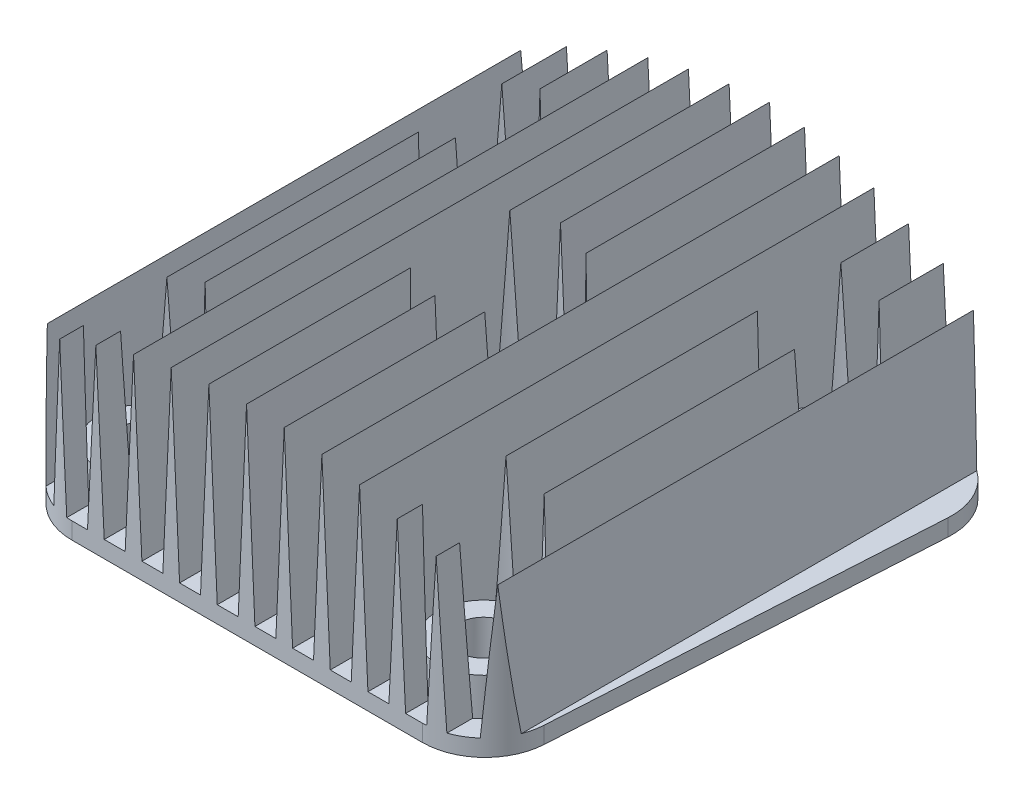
ISO-10303-21;
HEADER;
FILE_DESCRIPTION(('STEP AP214'),'2;1');
FILE_NAME('part.step','',(''),(''),'','','');
FILE_SCHEMA(('AUTOMOTIVE_DESIGN { 1 0 10303 214 1 1 1 1 }'));
ENDSEC;
DATA;
#1=APPLICATION_CONTEXT('core data for automotive mechanical design processes');
#2=APPLICATION_PROTOCOL_DEFINITION('international standard','automotive_design',2000,#1);
#3=PRODUCT_CONTEXT('',#1,'mechanical');
#4=PRODUCT('Part','Part','',(#3));
#5=PRODUCT_RELATED_PRODUCT_CATEGORY('part','',(#4));
#6=PRODUCT_DEFINITION_FORMATION('','',#4);
#7=PRODUCT_DEFINITION_CONTEXT('part definition',#1,'design');
#8=PRODUCT_DEFINITION('design','',#6,#7);
#9=PRODUCT_DEFINITION_SHAPE('','',#8);
#10=(LENGTH_UNIT() NAMED_UNIT(*) SI_UNIT(.MILLI.,.METRE.));
#11=(NAMED_UNIT(*) PLANE_ANGLE_UNIT() SI_UNIT($,.RADIAN.));
#12=(NAMED_UNIT(*) SI_UNIT($,.STERADIAN.) SOLID_ANGLE_UNIT());
#13=UNCERTAINTY_MEASURE_WITH_UNIT(LENGTH_MEASURE(1.E-05),#10,'distance_accuracy_value','');
#14=(GEOMETRIC_REPRESENTATION_CONTEXT(3) GLOBAL_UNCERTAINTY_ASSIGNED_CONTEXT((#13)) GLOBAL_UNIT_ASSIGNED_CONTEXT((#10,
#11,#12)) REPRESENTATION_CONTEXT('',''));
#15=CARTESIAN_POINT('',(0.,0.,0.));
#16=DIRECTION('',(0.,0.,1.));
#17=DIRECTION('',(1.,0.,0.));
#18=AXIS2_PLACEMENT_3D('',#15,#16,#17);
#19=CARTESIAN_POINT('',(-63.,4.,-60.));
#20=DIRECTION('',(0.,-1.,0.));
#21=DIRECTION('',(0.,0.,-1.));
#22=AXIS2_PLACEMENT_3D('',#19,#20,#21);
#23=PLANE('',#22);
#24=CARTESIAN_POINT('',(40.5,4.00000000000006,-36.));
#25=DIRECTION('',(0.,1.,0.));
#26=DIRECTION('',(0.,0.,1.));
#27=AXIS2_PLACEMENT_3D('',#24,#25,#26);
#28=CIRCLE('',#27,11.);
#29=CARTESIAN_POINT('',(33.8554195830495,4.00000000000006,-44.7663875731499));
#30=VERTEX_POINT('',#29);
#31=CARTESIAN_POINT('',(33.8554195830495,4.00000000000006,-27.2336124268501));
#32=VERTEX_POINT('',#31);
#33=EDGE_CURVE('E727',#30,#32,#28,.T.);
#34=ORIENTED_EDGE('',*,*,#33,.F.);
#35=DIRECTION('',(0.,0.,-1.));
#36=VECTOR('',#35,1.);
#37=CARTESIAN_POINT('',(33.8554195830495,4.,65.));
#38=LINE('',#37,#36);
#39=CARTESIAN_POINT('',(33.8554195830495,4.,-62.3130619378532));
#40=VERTEX_POINT('',#39);
#41=EDGE_CURVE('E1015',#30,#40,#38,.T.);
#42=ORIENTED_EDGE('',*,*,#41,.T.);
#43=DIRECTION('',(-0.996865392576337,0.,-0.0791163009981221));
#44=VECTOR('',#43,1.);
#45=CARTESIAN_POINT('',(63.,4.,-60.));
#46=LINE('',#45,#44);
#47=CARTESIAN_POINT('',(28.8554195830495,4.,-62.7098873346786));
#48=VERTEX_POINT('',#47);
#49=EDGE_CURVE('E1524',#40,#48,#46,.T.);
#50=ORIENTED_EDGE('',*,*,#49,.T.);
#51=DIRECTION('',(0.,0.,-1.));
#52=VECTOR('',#51,1.);
#53=CARTESIAN_POINT('',(28.8554195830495,4.,65.));
#54=LINE('',#53,#52);
#55=CARTESIAN_POINT('',(28.8554195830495,4.,60.));
#56=VERTEX_POINT('',#55);
#57=EDGE_CURVE('E1023',#56,#48,#54,.T.);
#58=ORIENTED_EDGE('',*,*,#57,.F.);
#59=DIRECTION('',(1.,0.,0.));
#60=VECTOR('',#59,1.);
#61=CARTESIAN_POINT('',(-56.,4.,60.));
#62=LINE('',#61,#60);
#63=CARTESIAN_POINT('',(33.8554195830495,4.,60.));
#64=VERTEX_POINT('',#63);
#65=EDGE_CURVE('E1539',#56,#64,#62,.T.);
#66=ORIENTED_EDGE('',*,*,#65,.T.);
#67=CARTESIAN_POINT('',(33.8554195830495,4.00000000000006,52.7663875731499));
#68=VERTEX_POINT('',#67);
#69=EDGE_CURVE('E1016',#64,#68,#38,.T.);
#70=ORIENTED_EDGE('',*,*,#69,.T.);
#71=CARTESIAN_POINT('',(40.5,4.00000000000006,44.));
#72=DIRECTION('',(0.,1.,0.));
#73=DIRECTION('',(0.,0.,1.));
#74=AXIS2_PLACEMENT_3D('',#71,#72,#73);
#75=CIRCLE('',#74,11.);
#76=CARTESIAN_POINT('',(33.8554195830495,4.00000000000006,35.2336124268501));
#77=VERTEX_POINT('',#76);
#78=EDGE_CURVE('E736',#77,#68,#75,.T.);
#79=ORIENTED_EDGE('',*,*,#78,.F.);
#80=EDGE_CURVE('E1020',#77,#32,#38,.T.);
#81=ORIENTED_EDGE('',*,*,#80,.T.);
#82=EDGE_LOOP('',(#34,#42,#50,#58,#66,#70,#79,#81));
#83=FACE_BOUND('',#82,.T.);
#84=ADVANCED_FACE('F36',(#83),#23,.F.);
#85=CARTESIAN_POINT('',(37.8554195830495,4.,-25.3226316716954));
#86=VERTEX_POINT('',#85);
#87=CARTESIAN_POINT('',(42.8554195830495,4.00000000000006,-25.2551408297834));
#88=VERTEX_POINT('',#87);
#89=EDGE_CURVE('E725',#86,#88,#28,.T.);
#90=ORIENTED_EDGE('',*,*,#89,.F.);
#91=DIRECTION('',(0.,0.,-1.));
#92=VECTOR('',#91,1.);
#93=CARTESIAN_POINT('',(37.8554195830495,4.,65.));
#94=LINE('',#93,#92);
#95=CARTESIAN_POINT('',(37.8554195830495,4.00000000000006,33.3226316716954));
#96=VERTEX_POINT('',#95);
#97=EDGE_CURVE('E696',#96,#86,#94,.T.);
#98=ORIENTED_EDGE('',*,*,#97,.F.);
#99=CARTESIAN_POINT('',(42.8554195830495,4.00000000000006,33.2551408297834));
#100=VERTEX_POINT('',#99);
#101=EDGE_CURVE('E1291',#100,#96,#75,.T.);
#102=ORIENTED_EDGE('',*,*,#101,.F.);
#103=DIRECTION('',(0.,0.,-1.));
#104=VECTOR('',#103,1.);
#105=CARTESIAN_POINT('',(42.8554195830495,4.,65.));
#106=LINE('',#105,#104);
#107=EDGE_CURVE('E1006',#100,#88,#106,.T.);
#108=ORIENTED_EDGE('',*,*,#107,.T.);
#109=EDGE_LOOP('',(#90,#98,#102,#108));
#110=FACE_BOUND('',#109,.T.);
#111=ADVANCED_FACE('F1379',(#110),#23,.F.);
#112=CARTESIAN_POINT('',(46.8554195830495,4.,-27.0217684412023));
#113=VERTEX_POINT('',#112);
#114=CARTESIAN_POINT('',(46.8554195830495,4.00000000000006,-44.9782315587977));
#115=VERTEX_POINT('',#114);
#116=EDGE_CURVE('E707',#113,#115,#28,.T.);
#117=ORIENTED_EDGE('',*,*,#116,.F.);
#118=DIRECTION('',(0.,0.,-1.));
#119=VECTOR('',#118,1.);
#120=CARTESIAN_POINT('',(46.8554195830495,4.,65.));
#121=LINE('',#120,#119);
#122=CARTESIAN_POINT('',(46.8554195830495,4.00000000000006,35.0217684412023));
#123=VERTEX_POINT('',#122);
#124=EDGE_CURVE('E1001',#123,#113,#121,.T.);
#125=ORIENTED_EDGE('',*,*,#124,.F.);
#126=CARTESIAN_POINT('',(46.8554195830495,4.,52.9782315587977));
#127=VERTEX_POINT('',#126);
#128=EDGE_CURVE('E737',#127,#123,#75,.T.);
#129=ORIENTED_EDGE('',*,*,#128,.F.);
#130=CARTESIAN_POINT('',(46.8554195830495,4.,59.1400416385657));
#131=VERTEX_POINT('',#130);
#132=EDGE_CURVE('E997',#131,#127,#121,.T.);
#133=ORIENTED_EDGE('',*,*,#132,.F.);
#134=CARTESIAN_POINT('',(41.8495008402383,4.,45.));
#135=DIRECTION('',(0.,-1.,0.));
#136=DIRECTION('',(0.,0.,-1.));
#137=AXIS2_PLACEMENT_3D('',#134,#135,#136);
#138=CIRCLE('',#137,15.);
#139=CARTESIAN_POINT('',(51.8554195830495,4.00000000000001,56.1750431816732));
#140=VERTEX_POINT('',#139);
#141=EDGE_CURVE('E1204',#131,#140,#138,.F.);
#142=ORIENTED_EDGE('',*,*,#141,.T.);
#143=DIRECTION('',(0.,0.,-1.));
#144=VECTOR('',#143,1.);
#145=CARTESIAN_POINT('',(51.8554195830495,4.,65.));
#146=LINE('',#145,#144);
#147=CARTESIAN_POINT('',(51.8554195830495,4.,-60.4586419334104));
#148=VERTEX_POINT('',#147);
#149=EDGE_CURVE('E988',#140,#148,#146,.T.);
#150=ORIENTED_EDGE('',*,*,#149,.T.);
#151=CARTESIAN_POINT('',(47.1700363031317,4.,-46.2091793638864));
#152=DIRECTION('',(0.,-1.,0.));
#153=DIRECTION('',(0.,0.,-1.));
#154=AXIS2_PLACEMENT_3D('',#151,#152,#153);
#155=CIRCLE('',#154,15.);
#156=CARTESIAN_POINT('',(48.3567808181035,4.,-61.1621602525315));
#157=VERTEX_POINT('',#156);
#158=EDGE_CURVE('E1208',#148,#157,#155,.F.);
#159=ORIENTED_EDGE('',*,*,#158,.T.);
#160=CARTESIAN_POINT('',(46.8554195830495,4.,-61.2813159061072));
#161=VERTEX_POINT('',#160);
#162=EDGE_CURVE('E1156',#157,#161,#46,.T.);
#163=ORIENTED_EDGE('',*,*,#162,.T.);
#164=EDGE_CURVE('E995',#115,#161,#121,.T.);
#165=ORIENTED_EDGE('',*,*,#164,.F.);
#166=EDGE_LOOP('',(#117,#125,#129,#133,#142,#150,#159,#163,#165));
#167=FACE_BOUND('',#166,.T.);
#168=ADVANCED_FACE('F1403',(#167),#23,.F.);
#169=CARTESIAN_POINT('',(42.8554195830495,4.00000000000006,-46.7448591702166));
#170=VERTEX_POINT('',#169);
#171=CARTESIAN_POINT('',(37.8554195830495,4.00000000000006,-46.6773683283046));
#172=VERTEX_POINT('',#171);
#173=EDGE_CURVE('E1383',#170,#172,#28,.T.);
#174=ORIENTED_EDGE('',*,*,#173,.F.);
#175=CARTESIAN_POINT('',(42.8554195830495,4.,-61.5987762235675));
#176=VERTEX_POINT('',#175);
#177=EDGE_CURVE('E1000',#170,#176,#106,.T.);
#178=ORIENTED_EDGE('',*,*,#177,.T.);
#179=CARTESIAN_POINT('',(37.8554195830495,4.,-61.9956016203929));
#180=VERTEX_POINT('',#179);
#181=EDGE_CURVE('E1160',#176,#180,#46,.T.);
#182=ORIENTED_EDGE('',*,*,#181,.T.);
#183=EDGE_CURVE('E1010',#172,#180,#94,.T.);
#184=ORIENTED_EDGE('',*,*,#183,.F.);
#185=EDGE_LOOP('',(#174,#178,#182,#184));
#186=FACE_BOUND('',#185,.T.);
#187=ADVANCED_FACE('F1381',(#186),#23,.F.);
#188=CARTESIAN_POINT('',(37.8554195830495,4.,54.6773683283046));
#189=VERTEX_POINT('',#188);
#190=CARTESIAN_POINT('',(42.8554195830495,4.00000000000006,54.7448591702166));
#191=VERTEX_POINT('',#190);
#192=EDGE_CURVE('E721',#189,#191,#75,.T.);
#193=ORIENTED_EDGE('',*,*,#192,.F.);
#194=CARTESIAN_POINT('',(37.8554195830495,4.,60.));
#195=VERTEX_POINT('',#194);
#196=EDGE_CURVE('E1012',#195,#189,#94,.T.);
#197=ORIENTED_EDGE('',*,*,#196,.F.);
#198=CARTESIAN_POINT('',(41.8495008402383,4.,60.));
#199=VERTEX_POINT('',#198);
#200=EDGE_CURVE('E1146',#195,#199,#62,.T.);
#201=ORIENTED_EDGE('',*,*,#200,.T.);
#202=CARTESIAN_POINT('',(42.8554195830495,4.,59.9662329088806));
#203=VERTEX_POINT('',#202);
#204=EDGE_CURVE('E1200',#199,#203,#138,.F.);
#205=ORIENTED_EDGE('',*,*,#204,.T.);
#206=EDGE_CURVE('E1002',#203,#191,#106,.T.);
#207=ORIENTED_EDGE('',*,*,#206,.T.);
#208=EDGE_LOOP('',(#193,#197,#201,#205,#207));
#209=FACE_BOUND('',#208,.T.);
#210=ADVANCED_FACE('F1550',(#209),#23,.F.);
#211=CARTESIAN_POINT('',(-40.5,4.,-36.));
#212=DIRECTION('',(0.,1.,0.));
#213=DIRECTION('',(0.,0.,1.));
#214=AXIS2_PLACEMENT_3D('',#211,#212,#213);
#215=CIRCLE('',#214,11.);
#216=CARTESIAN_POINT('',(-47.1445804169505,4.,-44.7663875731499));
#217=VERTEX_POINT('',#216);
#218=CARTESIAN_POINT('',(-47.1445804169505,4.,-27.2336124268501));
#219=VERTEX_POINT('',#218);
#220=EDGE_CURVE('E745',#217,#219,#215,.T.);
#221=ORIENTED_EDGE('',*,*,#220,.F.);
#222=DIRECTION('',(0.,0.,-1.));
#223=VECTOR('',#222,1.);
#224=CARTESIAN_POINT('',(-47.1445804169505,4.,65.));
#225=LINE('',#224,#223);
#226=CARTESIAN_POINT('',(-47.1445804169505,4.,-61.2583666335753));
#227=VERTEX_POINT('',#226);
#228=EDGE_CURVE('E1116',#217,#227,#225,.T.);
#229=ORIENTED_EDGE('',*,*,#228,.T.);
#230=DIRECTION('',(-0.996865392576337,0.,0.0791163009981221));
#231=VECTOR('',#230,1.);
#232=CARTESIAN_POINT('',(0.,4.,-65.));
#233=LINE('',#232,#231);
#234=CARTESIAN_POINT('',(-48.3567808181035,4.,-61.1621602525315));
#235=VERTEX_POINT('',#234);
#236=EDGE_CURVE('E1159',#227,#235,#233,.T.);
#237=ORIENTED_EDGE('',*,*,#236,.T.);
#238=CARTESIAN_POINT('',(-47.1700363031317,4.,-46.2091793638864));
#239=DIRECTION('',(0.,-1.,0.));
#240=DIRECTION('',(0.,0.,-1.));
#241=AXIS2_PLACEMENT_3D('',#238,#239,#240);
#242=CIRCLE('',#241,15.);
#243=CARTESIAN_POINT('',(-52.1445804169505,4.,-60.3602892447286));
#244=VERTEX_POINT('',#243);
#245=EDGE_CURVE('E1214',#235,#244,#242,.F.);
#246=ORIENTED_EDGE('',*,*,#245,.T.);
#247=DIRECTION('',(0.,0.,-1.));
#248=VECTOR('',#247,1.);
#249=CARTESIAN_POINT('',(-52.1445804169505,4.,65.));
#250=LINE('',#249,#248);
#251=CARTESIAN_POINT('',(-52.1445804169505,4.,55.9092317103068));
#252=VERTEX_POINT('',#251);
#253=EDGE_CURVE('E1126',#252,#244,#250,.T.);
#254=ORIENTED_EDGE('',*,*,#253,.F.);
#255=CARTESIAN_POINT('',(-41.8495008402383,4.,45.));
#256=DIRECTION('',(0.,-1.,0.));
#257=DIRECTION('',(0.,0.,-1.));
#258=AXIS2_PLACEMENT_3D('',#255,#256,#257);
#259=CIRCLE('',#258,15.);
#260=CARTESIAN_POINT('',(-47.1445804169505,4.,59.0343198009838));
#261=VERTEX_POINT('',#260);
#262=EDGE_CURVE('E1209',#252,#261,#259,.F.);
#263=ORIENTED_EDGE('',*,*,#262,.T.);
#264=CARTESIAN_POINT('',(-47.1445804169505,4.,52.7663875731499));
#265=VERTEX_POINT('',#264);
#266=EDGE_CURVE('E1118',#261,#265,#225,.T.);
#267=ORIENTED_EDGE('',*,*,#266,.T.);
#268=CARTESIAN_POINT('',(-40.5,4.,44.));
#269=DIRECTION('',(0.,1.,0.));
#270=DIRECTION('',(0.,0.,1.));
#271=AXIS2_PLACEMENT_3D('',#268,#269,#270);
#272=CIRCLE('',#271,11.);
#273=CARTESIAN_POINT('',(-47.1445804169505,4.,35.2336124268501));
#274=VERTEX_POINT('',#273);
#275=EDGE_CURVE('E854',#274,#265,#272,.T.);
#276=ORIENTED_EDGE('',*,*,#275,.F.);
#277=EDGE_CURVE('E1122',#274,#219,#225,.T.);
#278=ORIENTED_EDGE('',*,*,#277,.T.);
#279=EDGE_LOOP('',(#221,#229,#237,#246,#254,#263,#267,#276,#278));
#280=FACE_BOUND('',#279,.T.);
#281=ADVANCED_FACE('F1460',(#280),#23,.F.);
#282=CARTESIAN_POINT('',(-43.1445804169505,4.,-25.3226316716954));
#283=VERTEX_POINT('',#282);
#284=CARTESIAN_POINT('',(-38.1445804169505,4.,-25.2551408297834));
#285=VERTEX_POINT('',#284);
#286=EDGE_CURVE('E731',#283,#285,#215,.T.);
#287=ORIENTED_EDGE('',*,*,#286,.F.);
#288=DIRECTION('',(0.,0.,-1.));
#289=VECTOR('',#288,1.);
#290=CARTESIAN_POINT('',(-43.1445804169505,4.,65.));
#291=LINE('',#290,#289);
#292=CARTESIAN_POINT('',(-43.1445804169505,4.,33.3226316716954));
#293=VERTEX_POINT('',#292);
#294=EDGE_CURVE('E1117',#293,#283,#291,.T.);
#295=ORIENTED_EDGE('',*,*,#294,.F.);
#296=CARTESIAN_POINT('',(-38.1445804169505,4.,33.2551408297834));
#297=VERTEX_POINT('',#296);
#298=EDGE_CURVE('E1846',#297,#293,#272,.T.);
#299=ORIENTED_EDGE('',*,*,#298,.F.);
#300=DIRECTION('',(0.,0.,-1.));
#301=VECTOR('',#300,1.);
#302=CARTESIAN_POINT('',(-38.1445804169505,4.,65.));
#303=LINE('',#302,#301);
#304=EDGE_CURVE('E1107',#297,#285,#303,.T.);
#305=ORIENTED_EDGE('',*,*,#304,.T.);
#306=EDGE_LOOP('',(#287,#295,#299,#305));
#307=FACE_BOUND('',#306,.T.);
#308=ADVANCED_FACE('F1878',(#307),#23,.F.);
#309=CARTESIAN_POINT('',(-34.1445804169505,4.,-27.0217684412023));
#310=VERTEX_POINT('',#309);
#311=CARTESIAN_POINT('',(-34.1445804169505,4.,-44.9782315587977));
#312=VERTEX_POINT('',#311);
#313=EDGE_CURVE('E746',#310,#312,#215,.T.);
#314=ORIENTED_EDGE('',*,*,#313,.F.);
#315=DIRECTION('',(0.,0.,-1.));
#316=VECTOR('',#315,1.);
#317=CARTESIAN_POINT('',(-34.1445804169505,4.,65.));
#318=LINE('',#317,#316);
#319=CARTESIAN_POINT('',(-34.1445804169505,4.,35.0217684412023));
#320=VERTEX_POINT('',#319);
#321=EDGE_CURVE('E1102',#320,#310,#318,.T.);
#322=ORIENTED_EDGE('',*,*,#321,.F.);
#323=CARTESIAN_POINT('',(-34.1445804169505,4.,52.9782315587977));
#324=VERTEX_POINT('',#323);
#325=EDGE_CURVE('E855',#324,#320,#272,.T.);
#326=ORIENTED_EDGE('',*,*,#325,.F.);
#327=CARTESIAN_POINT('',(-34.1445804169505,4.,60.));
#328=VERTEX_POINT('',#327);
#329=EDGE_CURVE('E1098',#328,#324,#318,.T.);
#330=ORIENTED_EDGE('',*,*,#329,.F.);
#331=CARTESIAN_POINT('',(-29.1445804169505,4.,60.));
#332=VERTEX_POINT('',#331);
#333=EDGE_CURVE('E1152',#328,#332,#62,.T.);
#334=ORIENTED_EDGE('',*,*,#333,.T.);
#335=DIRECTION('',(0.,0.,-1.));
#336=VECTOR('',#335,1.);
#337=CARTESIAN_POINT('',(-29.1445804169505,4.,65.));
#338=LINE('',#337,#336);
#339=CARTESIAN_POINT('',(-29.1445804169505,4.00000000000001,-62.6869380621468));
#340=VERTEX_POINT('',#339);
#341=EDGE_CURVE('E1089',#332,#340,#338,.T.);
#342=ORIENTED_EDGE('',*,*,#341,.T.);
#343=CARTESIAN_POINT('',(-34.1445804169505,4.,-62.2901126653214));
#344=VERTEX_POINT('',#343);
#345=EDGE_CURVE('E1447',#340,#344,#233,.T.);
#346=ORIENTED_EDGE('',*,*,#345,.T.);
#347=EDGE_CURVE('E1096',#312,#344,#318,.T.);
#348=ORIENTED_EDGE('',*,*,#347,.F.);
#349=EDGE_LOOP('',(#314,#322,#326,#330,#334,#342,#346,#348));
#350=FACE_BOUND('',#349,.T.);
#351=ADVANCED_FACE('F1751',(#350),#23,.F.);
#352=CARTESIAN_POINT('',(-38.1445804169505,4.,-46.7448591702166));
#353=VERTEX_POINT('',#352);
#354=CARTESIAN_POINT('',(-43.1445804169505,4.,-46.6773683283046));
#355=VERTEX_POINT('',#354);
#356=EDGE_CURVE('E1792',#353,#355,#215,.T.);
#357=ORIENTED_EDGE('',*,*,#356,.F.);
#358=CARTESIAN_POINT('',(-38.1445804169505,4.,-61.972652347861));
#359=VERTEX_POINT('',#358);
#360=EDGE_CURVE('E1101',#353,#359,#303,.T.);
#361=ORIENTED_EDGE('',*,*,#360,.T.);
#362=CARTESIAN_POINT('',(-43.1445804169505,4.,-61.5758269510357));
#363=VERTEX_POINT('',#362);
#364=EDGE_CURVE('E1450',#359,#363,#233,.T.);
#365=ORIENTED_EDGE('',*,*,#364,.T.);
#366=EDGE_CURVE('E1111',#355,#363,#291,.T.);
#367=ORIENTED_EDGE('',*,*,#366,.F.);
#368=EDGE_LOOP('',(#357,#361,#365,#367));
#369=FACE_BOUND('',#368,.T.);
#370=ADVANCED_FACE('F1879',(#369),#23,.F.);
#371=CARTESIAN_POINT('',(35.8554195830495,43.2675106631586,65.));
#372=DIRECTION('',(0.998705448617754,-0.0508667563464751,0.));
#373=DIRECTION('',(0.0508667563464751,0.998705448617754,0.));
#374=AXIS2_PLACEMENT_3D('',#371,#372,#373);
#375=PLANE('',#374);
#376=CARTESIAN_POINT('',(40.5,134.45806618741,-36.));
#377=DIRECTION('',(0.998705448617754,-0.0508667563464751,0.));
#378=DIRECTION('',(-0.0508667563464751,-0.998705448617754,0.));
#379=AXIS2_PLACEMENT_3D('',#376,#377,#378);
#380=ELLIPSE('',#379,216.251257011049,11.);
#381=CARTESIAN_POINT('',(34.3138138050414,13.0000000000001,-26.9043361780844));
#382=VERTEX_POINT('',#381);
#383=EDGE_CURVE('E753',#32,#382,#380,.F.);
#384=ORIENTED_EDGE('',*,*,#383,.F.);
#385=ORIENTED_EDGE('',*,*,#80,.F.);
#386=CARTESIAN_POINT('',(40.5,134.45806618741,44.));
#387=DIRECTION('',(0.998705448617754,-0.0508667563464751,0.));
#388=DIRECTION('',(-0.0508667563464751,-0.998705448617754,0.));
#389=AXIS2_PLACEMENT_3D('',#386,#387,#388);
#390=ELLIPSE('',#389,216.251257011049,11.);
#391=CARTESIAN_POINT('',(34.3138138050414,13.0000000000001,34.9043361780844));
#392=VERTEX_POINT('',#391);
#393=EDGE_CURVE('E777',#392,#77,#390,.F.);
#394=ORIENTED_EDGE('',*,*,#393,.F.);
#395=CARTESIAN_POINT('',(35.8554195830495,43.2675106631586,34.0286473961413));
#396=VERTEX_POINT('',#395);
#397=EDGE_CURVE('E778',#396,#392,#390,.F.);
#398=ORIENTED_EDGE('',*,*,#397,.F.);
#399=DIRECTION('',(0.,0.,-1.));
#400=VECTOR('',#399,1.);
#401=CARTESIAN_POINT('',(35.8554195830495,43.2675106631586,65.));
#402=LINE('',#401,#400);
#403=CARTESIAN_POINT('',(35.8554195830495,43.2675106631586,-26.0286473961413));
#404=VERTEX_POINT('',#403);
#405=EDGE_CURVE('E1011',#396,#404,#402,.T.);
#406=ORIENTED_EDGE('',*,*,#405,.T.);
#407=EDGE_CURVE('E683',#382,#404,#380,.F.);
#408=ORIENTED_EDGE('',*,*,#407,.F.);
#409=EDGE_LOOP('',(#384,#385,#394,#398,#406,#408));
#410=FACE_BOUND('',#409,.T.);
#411=ADVANCED_FACE('F1335',(#410),#375,.F.);
#412=CARTESIAN_POINT('',(35.8554195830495,43.2675106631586,-45.9713526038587));
#413=VERTEX_POINT('',#412);
#414=CARTESIAN_POINT('',(34.3138138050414,13.0000000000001,-45.0956638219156));
#415=VERTEX_POINT('',#414);
#416=EDGE_CURVE('E756',#413,#415,#380,.F.);
#417=ORIENTED_EDGE('',*,*,#416,.F.);
#418=CARTESIAN_POINT('',(35.8554195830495,43.2675106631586,-62.1543317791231));
#419=VERTEX_POINT('',#418);
#420=EDGE_CURVE('E1005',#413,#419,#402,.T.);
#421=ORIENTED_EDGE('',*,*,#420,.T.);
#422=DIRECTION('',(0.0508663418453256,0.998697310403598,0.00403701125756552));
#423=VECTOR('',#422,1.);
#424=CARTESIAN_POINT('',(35.8815304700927,43.7801654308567,-62.1522594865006));
#425=LINE('',#424,#423);
#426=EDGE_CURVE('E891',#40,#419,#425,.T.);
#427=ORIENTED_EDGE('',*,*,#426,.F.);
#428=ORIENTED_EDGE('',*,*,#41,.F.);
#429=EDGE_CURVE('E755',#415,#30,#380,.F.);
#430=ORIENTED_EDGE('',*,*,#429,.F.);
#431=EDGE_LOOP('',(#417,#421,#427,#428,#430));
#432=FACE_BOUND('',#431,.T.);
#433=ADVANCED_FACE('F1328',(#432),#375,.F.);
#434=CARTESIAN_POINT('',(37.8554195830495,4.,65.));
#435=DIRECTION('',(-0.998705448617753,-0.0508667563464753,0.));
#436=DIRECTION('',(0.0508667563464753,-0.998705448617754,0.));
#437=AXIS2_PLACEMENT_3D('',#434,#435,#436);
#438=PLANE('',#437);
#439=CARTESIAN_POINT('',(40.5,-47.9230448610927,-36.));
#440=DIRECTION('',(-0.998705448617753,-0.0508667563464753,0.));
#441=DIRECTION('',(0.0508667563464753,-0.998705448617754,0.));
#442=AXIS2_PLACEMENT_3D('',#439,#440,#441);
#443=ELLIPSE('',#442,216.251257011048,11.);
#444=CARTESIAN_POINT('',(37.3970253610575,13.,-46.5532719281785));
#445=VERTEX_POINT('',#444);
#446=EDGE_CURVE('E690',#172,#445,#443,.F.);
#447=ORIENTED_EDGE('',*,*,#446,.F.);
#448=ORIENTED_EDGE('',*,*,#183,.T.);
#449=DIRECTION('',(0.0508663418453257,-0.998697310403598,0.00403701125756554));
#450=VECTOR('',#449,1.);
#451=CARTESIAN_POINT('',(37.881497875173,3.48798519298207,-61.9935319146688));
#452=LINE('',#451,#450);
#453=EDGE_CURVE('E888',#419,#180,#452,.T.);
#454=ORIENTED_EDGE('',*,*,#453,.F.);
#455=ORIENTED_EDGE('',*,*,#420,.F.);
#456=EDGE_CURVE('E689',#445,#413,#443,.F.);
#457=ORIENTED_EDGE('',*,*,#456,.F.);
#458=EDGE_LOOP('',(#447,#448,#454,#455,#457));
#459=FACE_BOUND('',#458,.T.);
#460=ADVANCED_FACE('F1332',(#459),#438,.F.);
#461=CARTESIAN_POINT('',(37.3970253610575,13.0000000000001,-25.4467280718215));
#462=VERTEX_POINT('',#461);
#463=EDGE_CURVE('E679',#404,#462,#443,.F.);
#464=ORIENTED_EDGE('',*,*,#463,.F.);
#465=ORIENTED_EDGE('',*,*,#405,.F.);
#466=CARTESIAN_POINT('',(40.5,-47.9230448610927,44.));
#467=DIRECTION('',(-0.998705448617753,-0.0508667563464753,0.));
#468=DIRECTION('',(0.0508667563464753,-0.998705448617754,0.));
#469=AXIS2_PLACEMENT_3D('',#466,#467,#468);
#470=ELLIPSE('',#469,216.251257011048,11.);
#471=CARTESIAN_POINT('',(37.3970253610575,13.,33.4467280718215));
#472=VERTEX_POINT('',#471);
#473=EDGE_CURVE('E772',#472,#396,#470,.F.);
#474=ORIENTED_EDGE('',*,*,#473,.F.);
#475=EDGE_CURVE('E773',#96,#472,#470,.F.);
#476=ORIENTED_EDGE('',*,*,#475,.F.);
#477=ORIENTED_EDGE('',*,*,#97,.T.);
#478=EDGE_CURVE('E687',#462,#86,#443,.F.);
#479=ORIENTED_EDGE('',*,*,#478,.F.);
#480=EDGE_LOOP('',(#464,#465,#474,#476,#477,#479));
#481=FACE_BOUND('',#480,.T.);
#482=ADVANCED_FACE('F694',(#481),#438,.F.);
#483=CARTESIAN_POINT('',(44.8554195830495,39.8914129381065,65.));
#484=DIRECTION('',(0.998451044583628,-0.0556373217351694,0.));
#485=DIRECTION('',(0.0556373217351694,0.998451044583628,0.));
#486=AXIS2_PLACEMENT_3D('',#483,#484,#485);
#487=PLANE('',#486);
#488=CARTESIAN_POINT('',(40.5,-38.2696684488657,-36.));
#489=DIRECTION('',(0.998451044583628,-0.0556373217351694,0.));
#490=DIRECTION('',(-0.0556373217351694,-0.998451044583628,0.));
#491=AXIS2_PLACEMENT_3D('',#488,#489,#490);
#492=ELLIPSE('',#491,197.709013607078,11.);
#493=CARTESIAN_POINT('',(43.3569322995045,13.0000000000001,-25.3774796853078));
#494=VERTEX_POINT('',#493);
#495=EDGE_CURVE('E704',#88,#494,#492,.F.);
#496=ORIENTED_EDGE('',*,*,#495,.F.);
#497=ORIENTED_EDGE('',*,*,#107,.F.);
#498=CARTESIAN_POINT('',(40.5,-38.2696684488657,44.));
#499=DIRECTION('',(0.998451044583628,-0.0556373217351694,0.));
#500=DIRECTION('',(-0.0556373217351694,-0.998451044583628,0.));
#501=AXIS2_PLACEMENT_3D('',#498,#499,#500);
#502=ELLIPSE('',#501,197.709013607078,11.);
#503=CARTESIAN_POINT('',(43.3569322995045,13.0000000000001,33.3774796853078));
#504=VERTEX_POINT('',#503);
#505=EDGE_CURVE('E1311',#504,#100,#502,.F.);
#506=ORIENTED_EDGE('',*,*,#505,.F.);
#507=CARTESIAN_POINT('',(44.8554195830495,39.8914129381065,33.8989940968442));
#508=VERTEX_POINT('',#507);
#509=EDGE_CURVE('E767',#508,#504,#502,.F.);
#510=ORIENTED_EDGE('',*,*,#509,.F.);
#511=DIRECTION('',(0.,0.,-1.));
#512=VECTOR('',#511,1.);
#513=CARTESIAN_POINT('',(44.8554195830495,39.8914129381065,65.));
#514=LINE('',#513,#512);
#515=CARTESIAN_POINT('',(44.8554195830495,39.8914129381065,-25.8989940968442));
#516=VERTEX_POINT('',#515);
#517=EDGE_CURVE('E996',#508,#516,#514,.T.);
#518=ORIENTED_EDGE('',*,*,#517,.T.);
#519=EDGE_CURVE('E749',#494,#516,#492,.F.);
#520=ORIENTED_EDGE('',*,*,#519,.F.);
#521=EDGE_LOOP('',(#496,#497,#506,#510,#518,#520));
#522=FACE_BOUND('',#521,.T.);
#523=ADVANCED_FACE('F1346',(#522),#487,.F.);
#524=CARTESIAN_POINT('',(44.8554195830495,39.8914129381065,-46.1010059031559));
#525=VERTEX_POINT('',#524);
#526=CARTESIAN_POINT('',(43.3569322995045,13.0000000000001,-46.6225203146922));
#527=VERTEX_POINT('',#526);
#528=EDGE_CURVE('E699',#525,#527,#492,.F.);
#529=ORIENTED_EDGE('',*,*,#528,.F.);
#530=CARTESIAN_POINT('',(44.8554195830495,39.8914129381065,-61.4400460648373));
#531=VERTEX_POINT('',#530);
#532=EDGE_CURVE('E991',#525,#531,#514,.T.);
#533=ORIENTED_EDGE('',*,*,#532,.T.);
#534=DIRECTION('',(0.0556367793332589,0.998441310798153,0.0044156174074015));
#535=VECTOR('',#534,1.);
#536=CARTESIAN_POINT('',(44.8864822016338,40.4488535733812,-61.4375807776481));
#537=LINE('',#536,#535);
#538=EDGE_CURVE('E885',#176,#531,#537,.T.);
#539=ORIENTED_EDGE('',*,*,#538,.F.);
#540=ORIENTED_EDGE('',*,*,#177,.F.);
#541=EDGE_CURVE('E1374',#527,#170,#492,.F.);
#542=ORIENTED_EDGE('',*,*,#541,.F.);
#543=EDGE_LOOP('',(#529,#533,#539,#540,#542));
#544=FACE_BOUND('',#543,.T.);
#545=ADVANCED_FACE('F1353',(#544),#487,.F.);
#546=CARTESIAN_POINT('',(46.8554195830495,4.,65.));
#547=DIRECTION('',(-0.998451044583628,-0.0556373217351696,0.));
#548=DIRECTION('',(0.0556373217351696,-0.998451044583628,0.));
#549=AXIS2_PLACEMENT_3D('',#546,#547,#548);
#550=PLANE('',#549);
#551=CARTESIAN_POINT('',(40.5,118.052494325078,-36.));
#552=DIRECTION('',(-0.998451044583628,-0.0556373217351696,0.));
#553=DIRECTION('',(0.0556373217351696,-0.998451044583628,0.));
#554=AXIS2_PLACEMENT_3D('',#551,#552,#553);
#555=ELLIPSE('',#554,197.709013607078,11.);
#556=CARTESIAN_POINT('',(46.3539068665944,13.,-45.3129895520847));
#557=VERTEX_POINT('',#556);
#558=EDGE_CURVE('E750',#115,#557,#555,.F.);
#559=ORIENTED_EDGE('',*,*,#558,.F.);
#560=ORIENTED_EDGE('',*,*,#164,.T.);
#561=DIRECTION('',(0.055636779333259,-0.998441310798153,0.00441561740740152));
#562=VECTOR('',#561,1.);
#563=CARTESIAN_POINT('',(46.8864432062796,3.44325916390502,-61.2788537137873));
#564=LINE('',#563,#562);
#565=EDGE_CURVE('E1235',#531,#161,#564,.T.);
#566=ORIENTED_EDGE('',*,*,#565,.F.);
#567=ORIENTED_EDGE('',*,*,#532,.F.);
#568=EDGE_CURVE('E751',#557,#525,#555,.F.);
#569=ORIENTED_EDGE('',*,*,#568,.F.);
#570=EDGE_LOOP('',(#559,#560,#566,#567,#569));
#571=FACE_BOUND('',#570,.T.);
#572=ADVANCED_FACE('F1364',(#571),#550,.F.);
#573=CARTESIAN_POINT('',(46.3539068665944,13.,-26.6870104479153));
#574=VERTEX_POINT('',#573);
#575=EDGE_CURVE('E747',#516,#574,#555,.F.);
#576=ORIENTED_EDGE('',*,*,#575,.F.);
#577=ORIENTED_EDGE('',*,*,#517,.F.);
#578=CARTESIAN_POINT('',(40.5,118.052494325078,44.));
#579=DIRECTION('',(-0.998451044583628,-0.0556373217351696,0.));
#580=DIRECTION('',(0.0556373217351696,-0.998451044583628,0.));
#581=AXIS2_PLACEMENT_3D('',#578,#579,#580);
#582=ELLIPSE('',#581,197.709013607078,11.);
#583=CARTESIAN_POINT('',(46.3539068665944,13.,34.6870104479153));
#584=VERTEX_POINT('',#583);
#585=EDGE_CURVE('E766',#584,#508,#582,.F.);
#586=ORIENTED_EDGE('',*,*,#585,.F.);
#587=EDGE_CURVE('E762',#123,#584,#582,.F.);
#588=ORIENTED_EDGE('',*,*,#587,.F.);
#589=ORIENTED_EDGE('',*,*,#124,.T.);
#590=EDGE_CURVE('E52',#574,#113,#555,.F.);
#591=ORIENTED_EDGE('',*,*,#590,.F.);
#592=EDGE_LOOP('',(#576,#577,#586,#588,#589,#591));
#593=FACE_BOUND('',#592,.T.);
#594=ADVANCED_FACE('F1348',(#593),#550,.F.);
#595=CARTESIAN_POINT('',(34.3138138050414,13.0000000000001,53.0956638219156));
#596=VERTEX_POINT('',#595);
#597=EDGE_CURVE('E774',#68,#596,#390,.F.);
#598=ORIENTED_EDGE('',*,*,#597,.F.);
#599=ORIENTED_EDGE('',*,*,#69,.F.);
#600=DIRECTION('',(-0.0508667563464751,-0.998705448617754,0.));
#601=VECTOR('',#600,1.);
#602=CARTESIAN_POINT('',(35.8554195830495,43.2675106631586,60.));
#603=LINE('',#602,#601);
#604=CARTESIAN_POINT('',(35.8554195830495,43.2675106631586,60.));
#605=VERTEX_POINT('',#604);
#606=EDGE_CURVE('E911',#605,#64,#603,.T.);
#607=ORIENTED_EDGE('',*,*,#606,.F.);
#608=CARTESIAN_POINT('',(35.8554195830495,43.2675106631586,53.9713526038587));
#609=VERTEX_POINT('',#608);
#610=EDGE_CURVE('E1007',#605,#609,#402,.T.);
#611=ORIENTED_EDGE('',*,*,#610,.T.);
#612=EDGE_CURVE('E770',#596,#609,#390,.F.);
#613=ORIENTED_EDGE('',*,*,#612,.F.);
#614=EDGE_LOOP('',(#598,#599,#607,#611,#613));
#615=FACE_BOUND('',#614,.T.);
#616=ADVANCED_FACE('F1280',(#615),#375,.F.);
#617=CARTESIAN_POINT('',(37.3970253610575,13.0000000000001,54.5532719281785));
#618=VERTEX_POINT('',#617);
#619=EDGE_CURVE('E768',#609,#618,#470,.F.);
#620=ORIENTED_EDGE('',*,*,#619,.F.);
#621=ORIENTED_EDGE('',*,*,#610,.F.);
#622=DIRECTION('',(-0.0508667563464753,0.998705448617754,0.));
#623=VECTOR('',#622,1.);
#624=CARTESIAN_POINT('',(37.8554195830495,4.,60.));
#625=LINE('',#624,#623);
#626=EDGE_CURVE('E1238',#195,#605,#625,.T.);
#627=ORIENTED_EDGE('',*,*,#626,.F.);
#628=ORIENTED_EDGE('',*,*,#196,.T.);
#629=EDGE_CURVE('E771',#618,#189,#470,.F.);
#630=ORIENTED_EDGE('',*,*,#629,.F.);
#631=EDGE_LOOP('',(#620,#621,#627,#628,#630));
#632=FACE_BOUND('',#631,.T.);
#633=ADVANCED_FACE('F1568',(#632),#438,.F.);
#634=CARTESIAN_POINT('',(43.3569322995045,13.0000000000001,54.6225203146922));
#635=VERTEX_POINT('',#634);
#636=EDGE_CURVE('E763',#191,#635,#502,.F.);
#637=ORIENTED_EDGE('',*,*,#636,.F.);
#638=ORIENTED_EDGE('',*,*,#206,.F.);
#639=CARTESIAN_POINT('',(41.8495008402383,-14.0519224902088,45.));
#640=DIRECTION('',(0.998451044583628,-0.0556373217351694,0.));
#641=DIRECTION('',(-0.0556373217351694,-0.998451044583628,0.));
#642=AXIS2_PLACEMENT_3D('',#639,#640,#641);
#643=ELLIPSE('',#642,269.603200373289,15.);
#644=CARTESIAN_POINT('',(44.8554195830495,39.8914129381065,59.6957290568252));
#645=VERTEX_POINT('',#644);
#646=EDGE_CURVE('E883',#645,#203,#643,.T.);
#647=ORIENTED_EDGE('',*,*,#646,.F.);
#648=CARTESIAN_POINT('',(44.8554195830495,39.8914129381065,54.1010059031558));
#649=VERTEX_POINT('',#648);
#650=EDGE_CURVE('E992',#645,#649,#514,.T.);
#651=ORIENTED_EDGE('',*,*,#650,.T.);
#652=EDGE_CURVE('E760',#635,#649,#502,.F.);
#653=ORIENTED_EDGE('',*,*,#652,.F.);
#654=EDGE_LOOP('',(#637,#638,#647,#651,#653));
#655=FACE_BOUND('',#654,.T.);
#656=ADVANCED_FACE('F1559',(#655),#487,.F.);
#657=CARTESIAN_POINT('',(46.3539068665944,13.,53.3129895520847));
#658=VERTEX_POINT('',#657);
#659=EDGE_CURVE('E757',#649,#658,#582,.F.);
#660=ORIENTED_EDGE('',*,*,#659,.F.);
#661=ORIENTED_EDGE('',*,*,#650,.F.);
#662=CARTESIAN_POINT('',(41.8495008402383,93.8347483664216,45.));
#663=DIRECTION('',(-0.998451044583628,-0.0556373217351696,0.));
#664=DIRECTION('',(0.0556373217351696,-0.998451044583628,0.));
#665=AXIS2_PLACEMENT_3D('',#662,#663,#664);
#666=ELLIPSE('',#665,269.603200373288,15.);
#667=EDGE_CURVE('E881',#131,#645,#666,.T.);
#668=ORIENTED_EDGE('',*,*,#667,.F.);
#669=ORIENTED_EDGE('',*,*,#132,.T.);
#670=EDGE_CURVE('E761',#658,#127,#582,.F.);
#671=ORIENTED_EDGE('',*,*,#670,.F.);
#672=EDGE_LOOP('',(#660,#661,#668,#669,#671));
#673=FACE_BOUND('',#672,.T.);
#674=ADVANCED_FACE('F1563',(#673),#550,.F.);
#675=CARTESIAN_POINT('',(-45.1445804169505,39.7684587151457,65.));
#676=DIRECTION('',(0.998440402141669,-0.0558279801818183,0.));
#677=DIRECTION('',(0.0558279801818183,0.99844040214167,0.));
#678=AXIS2_PLACEMENT_3D('',#675,#676,#677);
#679=PLANE('',#678);
#680=CARTESIAN_POINT('',(-40.5,122.83320016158,-36.));
#681=DIRECTION('',(0.998440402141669,-0.0558279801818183,0.));
#682=DIRECTION('',(-0.0558279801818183,-0.99844040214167,0.));
#683=AXIS2_PLACEMENT_3D('',#680,#681,#682);
#684=ELLIPSE('',#683,197.033816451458,11.);
#685=CARTESIAN_POINT('',(-46.6413437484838,13.,-26.8739988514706));
#686=VERTEX_POINT('',#685);
#687=EDGE_CURVE('E791',#219,#686,#684,.F.);
#688=ORIENTED_EDGE('',*,*,#687,.F.);
#689=ORIENTED_EDGE('',*,*,#277,.F.);
#690=CARTESIAN_POINT('',(-40.5,122.83320016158,44.));
#691=DIRECTION('',(0.998440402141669,-0.0558279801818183,0.));
#692=DIRECTION('',(-0.0558279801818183,-0.99844040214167,0.));
#693=AXIS2_PLACEMENT_3D('',#690,#691,#692);
#694=ELLIPSE('',#693,197.033816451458,11.);
#695=CARTESIAN_POINT('',(-46.6413437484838,13.,34.8739988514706));
#696=VERTEX_POINT('',#695);
#697=EDGE_CURVE('E875',#696,#274,#694,.F.);
#698=ORIENTED_EDGE('',*,*,#697,.F.);
#699=CARTESIAN_POINT('',(-45.1445804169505,39.7684587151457,34.0286473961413));
#700=VERTEX_POINT('',#699);
#701=EDGE_CURVE('E876',#700,#696,#694,.F.);
#702=ORIENTED_EDGE('',*,*,#701,.F.);
#703=DIRECTION('',(0.,0.,-1.));
#704=VECTOR('',#703,1.);
#705=CARTESIAN_POINT('',(-45.1445804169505,39.7684587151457,65.));
#706=LINE('',#705,#704);
#707=CARTESIAN_POINT('',(-45.1445804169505,39.7684587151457,-26.0286473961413));
#708=VERTEX_POINT('',#707);
#709=EDGE_CURVE('E1112',#700,#708,#706,.T.);
#710=ORIENTED_EDGE('',*,*,#709,.T.);
#711=EDGE_CURVE('E787',#686,#708,#684,.F.);
#712=ORIENTED_EDGE('',*,*,#711,.F.);
#713=EDGE_LOOP('',(#688,#689,#698,#702,#710,#712));
#714=FACE_BOUND('',#713,.T.);
#715=ADVANCED_FACE('F1829',(#714),#679,.F.);
#716=CARTESIAN_POINT('',(-45.1445804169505,39.7684587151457,-45.9713526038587));
#717=VERTEX_POINT('',#716);
#718=CARTESIAN_POINT('',(-46.6413437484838,13.,-45.1260011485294));
#719=VERTEX_POINT('',#718);
#720=EDGE_CURVE('E795',#717,#719,#684,.F.);
#721=ORIENTED_EDGE('',*,*,#720,.F.);
#722=CARTESIAN_POINT('',(-45.1445804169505,39.7684587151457,-61.4170967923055));
#723=VERTEX_POINT('',#722);
#724=EDGE_CURVE('E1106',#717,#723,#706,.T.);
#725=ORIENTED_EDGE('',*,*,#724,.T.);
#726=DIRECTION('',(0.0558274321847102,0.998430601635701,-0.00443074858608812));
#727=VECTOR('',#726,1.);
#728=CARTESIAN_POINT('',(-45.1758506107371,39.2092153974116,-61.4146150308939));
#729=LINE('',#728,#727);
#730=EDGE_CURVE('E971',#227,#723,#729,.T.);
#731=ORIENTED_EDGE('',*,*,#730,.F.);
#732=ORIENTED_EDGE('',*,*,#228,.F.);
#733=EDGE_CURVE('E794',#719,#217,#684,.F.);
#734=ORIENTED_EDGE('',*,*,#733,.F.);
#735=EDGE_LOOP('',(#721,#725,#731,#732,#734));
#736=FACE_BOUND('',#735,.T.);
#737=ADVANCED_FACE('F1803',(#736),#679,.F.);
#738=CARTESIAN_POINT('',(-43.1445804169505,4.,65.));
#739=DIRECTION('',(-0.998440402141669,-0.0558279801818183,0.));
#740=DIRECTION('',(0.0558279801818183,-0.99844040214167,0.));
#741=AXIS2_PLACEMENT_3D('',#738,#739,#740);
#742=PLANE('',#741);
#743=CARTESIAN_POINT('',(-40.5,-43.2962827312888,-36.));
#744=DIRECTION('',(-0.998440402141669,-0.0558279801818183,0.));
#745=DIRECTION('',(0.0558279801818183,-0.99844040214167,0.));
#746=AXIS2_PLACEMENT_3D('',#743,#744,#745);
#747=ELLIPSE('',#746,197.033816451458,11.);
#748=CARTESIAN_POINT('',(-43.6478170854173,13.,-46.5399832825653));
#749=VERTEX_POINT('',#748);
#750=EDGE_CURVE('E790',#355,#749,#747,.F.);
#751=ORIENTED_EDGE('',*,*,#750,.F.);
#752=ORIENTED_EDGE('',*,*,#366,.T.);
#753=DIRECTION('',(0.0558274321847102,-0.998430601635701,-0.00443074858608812));
#754=VECTOR('',#753,1.);
#755=CARTESIAN_POINT('',(-43.1758898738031,4.5599455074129,-61.5733420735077));
#756=LINE('',#755,#754);
#757=EDGE_CURVE('E968',#723,#363,#756,.T.);
#758=ORIENTED_EDGE('',*,*,#757,.F.);
#759=ORIENTED_EDGE('',*,*,#724,.F.);
#760=EDGE_CURVE('E789',#749,#717,#747,.F.);
#761=ORIENTED_EDGE('',*,*,#760,.F.);
#762=EDGE_LOOP('',(#751,#752,#758,#759,#761));
#763=FACE_BOUND('',#762,.T.);
#764=ADVANCED_FACE('F1808',(#763),#742,.F.);
#765=CARTESIAN_POINT('',(-43.6478170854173,13.,-25.4600167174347));
#766=VERTEX_POINT('',#765);
#767=EDGE_CURVE('E785',#708,#766,#747,.F.);
#768=ORIENTED_EDGE('',*,*,#767,.F.);
#769=ORIENTED_EDGE('',*,*,#709,.F.);
#770=CARTESIAN_POINT('',(-40.5,-43.2962827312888,44.));
#771=DIRECTION('',(-0.998440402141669,-0.0558279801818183,0.));
#772=DIRECTION('',(0.0558279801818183,-0.99844040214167,0.));
#773=AXIS2_PLACEMENT_3D('',#770,#771,#772);
#774=ELLIPSE('',#773,197.033816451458,11.);
#775=CARTESIAN_POINT('',(-43.6478170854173,13.,33.4600167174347));
#776=VERTEX_POINT('',#775);
#777=EDGE_CURVE('E870',#776,#700,#774,.F.);
#778=ORIENTED_EDGE('',*,*,#777,.F.);
#779=EDGE_CURVE('E871',#293,#776,#774,.F.);
#780=ORIENTED_EDGE('',*,*,#779,.F.);
#781=ORIENTED_EDGE('',*,*,#294,.T.);
#782=EDGE_CURVE('E788',#766,#283,#747,.F.);
#783=ORIENTED_EDGE('',*,*,#782,.F.);
#784=EDGE_LOOP('',(#768,#769,#778,#780,#781,#783));
#785=FACE_BOUND('',#784,.T.);
#786=ADVANCED_FACE('F1816',(#785),#742,.F.);
#787=CARTESIAN_POINT('',(-36.1445804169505,43.1722002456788,65.));
#788=DIRECTION('',(0.998699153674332,-0.0509901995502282,0.));
#789=DIRECTION('',(0.0509901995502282,0.998699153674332,0.));
#790=AXIS2_PLACEMENT_3D('',#787,#788,#789);
#791=PLANE('',#790);
#792=CARTESIAN_POINT('',(-40.5,-42.1334837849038,-36.));
#793=DIRECTION('',(0.998699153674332,-0.0509901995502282,0.));
#794=DIRECTION('',(-0.0509901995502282,-0.998699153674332,0.));
#795=AXIS2_PLACEMENT_3D('',#792,#793,#794);
#796=ELLIPSE('',#795,215.727729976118,11.);
#797=CARTESIAN_POINT('',(-37.6850708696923,13.,-25.3662718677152));
#798=VERTEX_POINT('',#797);
#799=EDGE_CURVE('E779',#285,#798,#796,.F.);
#800=ORIENTED_EDGE('',*,*,#799,.F.);
#801=ORIENTED_EDGE('',*,*,#304,.F.);
#802=CARTESIAN_POINT('',(-40.5,-42.1334837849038,44.));
#803=DIRECTION('',(0.998699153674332,-0.0509901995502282,0.));
#804=DIRECTION('',(-0.0509901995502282,-0.998699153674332,0.));
#805=AXIS2_PLACEMENT_3D('',#802,#803,#804);
#806=ELLIPSE('',#805,215.727729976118,11.);
#807=CARTESIAN_POINT('',(-37.6850708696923,13.,33.3662718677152));
#808=VERTEX_POINT('',#807);
#809=EDGE_CURVE('E1863',#808,#297,#806,.F.);
#810=ORIENTED_EDGE('',*,*,#809,.F.);
#811=CARTESIAN_POINT('',(-36.1445804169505,43.1722002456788,33.8989940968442));
#812=VERTEX_POINT('',#811);
#813=EDGE_CURVE('E865',#812,#808,#806,.F.);
#814=ORIENTED_EDGE('',*,*,#813,.F.);
#815=DIRECTION('',(0.,0.,-1.));
#816=VECTOR('',#815,1.);
#817=CARTESIAN_POINT('',(-36.1445804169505,43.1722002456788,65.));
#818=LINE('',#817,#816);
#819=CARTESIAN_POINT('',(-36.1445804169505,43.1722002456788,-25.8989940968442));
#820=VERTEX_POINT('',#819);
#821=EDGE_CURVE('E1097',#812,#820,#818,.T.);
#822=ORIENTED_EDGE('',*,*,#821,.T.);
#823=EDGE_CURVE('E783',#798,#820,#796,.F.);
#824=ORIENTED_EDGE('',*,*,#823,.F.);
#825=EDGE_LOOP('',(#800,#801,#810,#814,#822,#824));
#826=FACE_BOUND('',#825,.T.);
#827=ADVANCED_FACE('F1870',(#826),#791,.F.);
#828=CARTESIAN_POINT('',(-36.1445804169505,43.1722002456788,-46.1010059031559));
#829=VERTEX_POINT('',#828);
#830=CARTESIAN_POINT('',(-37.6850708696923,13.,-46.6337281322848));
#831=VERTEX_POINT('',#830);
#832=EDGE_CURVE('E784',#829,#831,#796,.F.);
#833=ORIENTED_EDGE('',*,*,#832,.F.);
#834=CARTESIAN_POINT('',(-36.1445804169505,43.1722002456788,-62.1313825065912));
#835=VERTEX_POINT('',#834);
#836=EDGE_CURVE('E1092',#829,#835,#818,.T.);
#837=ORIENTED_EDGE('',*,*,#836,.T.);
#838=DIRECTION('',(0.0509897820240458,0.99869097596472,-0.0040468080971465));
#839=VECTOR('',#838,1.);
#840=CARTESIAN_POINT('',(-36.1708134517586,42.6583973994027,-62.1293005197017));
#841=LINE('',#840,#839);
#842=EDGE_CURVE('E965',#359,#835,#841,.T.);
#843=ORIENTED_EDGE('',*,*,#842,.F.);
#844=ORIENTED_EDGE('',*,*,#360,.F.);
#845=EDGE_CURVE('E782',#831,#353,#796,.F.);
#846=ORIENTED_EDGE('',*,*,#845,.F.);
#847=EDGE_LOOP('',(#833,#837,#843,#844,#846));
#848=FACE_BOUND('',#847,.T.);
#849=ADVANCED_FACE('F1874',(#848),#791,.F.);
#850=CARTESIAN_POINT('',(-34.1445804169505,4.,65.));
#851=DIRECTION('',(-0.998699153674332,-0.0509901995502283,0.));
#852=DIRECTION('',(0.0509901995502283,-0.998699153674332,0.));
#853=AXIS2_PLACEMENT_3D('',#850,#851,#852);
#854=PLANE('',#853);
#855=CARTESIAN_POINT('',(-40.5,128.477884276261,-36.));
#856=DIRECTION('',(-0.998699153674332,-0.0509901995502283,0.));
#857=DIRECTION('',(0.0509901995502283,-0.998699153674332,0.));
#858=AXIS2_PLACEMENT_3D('',#855,#856,#857);
#859=ELLIPSE('',#858,215.727729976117,11.);
#860=CARTESIAN_POINT('',(-34.6040899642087,13.,-45.2864549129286));
#861=VERTEX_POINT('',#860);
#862=EDGE_CURVE('E1261',#312,#861,#859,.F.);
#863=ORIENTED_EDGE('',*,*,#862,.F.);
#864=ORIENTED_EDGE('',*,*,#347,.T.);
#865=DIRECTION('',(0.0509897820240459,-0.99869097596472,-0.00404680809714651));
#866=VECTOR('',#865,1.);
#867=CARTESIAN_POINT('',(-34.1708462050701,4.51444435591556,-62.2880280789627));
#868=LINE('',#867,#866);
#869=EDGE_CURVE('E962',#835,#344,#868,.T.);
#870=ORIENTED_EDGE('',*,*,#869,.F.);
#871=ORIENTED_EDGE('',*,*,#836,.F.);
#872=EDGE_CURVE('E1260',#861,#829,#859,.F.);
#873=ORIENTED_EDGE('',*,*,#872,.F.);
#874=EDGE_LOOP('',(#863,#864,#870,#871,#873));
#875=FACE_BOUND('',#874,.T.);
#876=ADVANCED_FACE('F1760',(#875),#854,.F.);
#877=CARTESIAN_POINT('',(-34.6040899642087,13.,-26.7135450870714));
#878=VERTEX_POINT('',#877);
#879=EDGE_CURVE('E1257',#820,#878,#859,.F.);
#880=ORIENTED_EDGE('',*,*,#879,.F.);
#881=ORIENTED_EDGE('',*,*,#821,.F.);
#882=CARTESIAN_POINT('',(-40.5,128.477884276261,44.));
#883=DIRECTION('',(-0.998699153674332,-0.0509901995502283,0.));
#884=DIRECTION('',(0.0509901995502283,-0.998699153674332,0.));
#885=AXIS2_PLACEMENT_3D('',#882,#883,#884);
#886=ELLIPSE('',#885,215.727729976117,11.);
#887=CARTESIAN_POINT('',(-34.6040899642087,13.,34.7135450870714));
#888=VERTEX_POINT('',#887);
#889=EDGE_CURVE('E864',#888,#812,#886,.F.);
#890=ORIENTED_EDGE('',*,*,#889,.F.);
#891=EDGE_CURVE('E860',#320,#888,#886,.F.);
#892=ORIENTED_EDGE('',*,*,#891,.F.);
#893=ORIENTED_EDGE('',*,*,#321,.T.);
#894=EDGE_CURVE('E1256',#878,#310,#859,.F.);
#895=ORIENTED_EDGE('',*,*,#894,.F.);
#896=EDGE_LOOP('',(#880,#881,#890,#892,#893,#895));
#897=FACE_BOUND('',#896,.T.);
#898=ADVANCED_FACE('F1769',(#897),#854,.F.);
#899=CARTESIAN_POINT('',(0.,4.,0.));
#900=DIRECTION('',(0.,1.,0.));
#901=DIRECTION('',(0.,0.,1.));
#902=AXIS2_PLACEMENT_3D('',#899,#900,#901);
#903=CIRCLE('',#902,15.);
#904=CARTESIAN_POINT('',(-2.14458041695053,4.,-14.8459009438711));
#905=VERTEX_POINT('',#904);
#906=CARTESIAN_POINT('',(-7.14458041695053,4.,-13.1891990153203));
#907=VERTEX_POINT('',#906);
#908=EDGE_CURVE('E1898',#905,#907,#903,.T.);
#909=ORIENTED_EDGE('',*,*,#908,.F.);
#910=DIRECTION('',(0.,0.,-1.));
#911=VECTOR('',#910,1.);
#912=CARTESIAN_POINT('',(-2.14458041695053,4.,65.));
#913=LINE('',#912,#911);
#914=CARTESIAN_POINT('',(-2.14458041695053,4.,-64.8297952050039));
#915=VERTEX_POINT('',#914);
#916=EDGE_CURVE('E1058',#905,#915,#913,.T.);
#917=ORIENTED_EDGE('',*,*,#916,.T.);
#918=CARTESIAN_POINT('',(-7.14458041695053,4.,-64.4329698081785));
#919=VERTEX_POINT('',#918);
#920=EDGE_CURVE('E1161',#915,#919,#233,.T.);
#921=ORIENTED_EDGE('',*,*,#920,.T.);
#922=DIRECTION('',(0.,0.,-1.));
#923=VECTOR('',#922,1.);
#924=CARTESIAN_POINT('',(-7.14458041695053,4.,65.));
#925=LINE('',#924,#923);
#926=EDGE_CURVE('E1066',#907,#919,#925,.T.);
#927=ORIENTED_EDGE('',*,*,#926,.F.);
#928=EDGE_LOOP('',(#909,#917,#921,#927));
#929=FACE_BOUND('',#928,.T.);
#930=ADVANCED_FACE('F1881',(#929),#23,.F.);
#931=CARTESIAN_POINT('',(-11.1445804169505,4.,-10.0398370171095));
#932=VERTEX_POINT('',#931);
#933=CARTESIAN_POINT('',(-11.1445804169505,4.,10.0398370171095));
#934=VERTEX_POINT('',#933);
#935=EDGE_CURVE('E1905',#932,#934,#903,.T.);
#936=ORIENTED_EDGE('',*,*,#935,.F.);
#937=DIRECTION('',(0.,0.,-1.));
#938=VECTOR('',#937,1.);
#939=CARTESIAN_POINT('',(-11.1445804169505,4.,65.));
#940=LINE('',#939,#938);
#941=CARTESIAN_POINT('',(-11.1445804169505,4.,-64.1155094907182));
#942=VERTEX_POINT('',#941);
#943=EDGE_CURVE('E1070',#932,#942,#940,.T.);
#944=ORIENTED_EDGE('',*,*,#943,.T.);
#945=CARTESIAN_POINT('',(-16.1445804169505,4.,-63.7186840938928));
#946=VERTEX_POINT('',#945);
#947=EDGE_CURVE('E1165',#942,#946,#233,.T.);
#948=ORIENTED_EDGE('',*,*,#947,.T.);
#949=DIRECTION('',(0.,0.,-1.));
#950=VECTOR('',#949,1.);
#951=CARTESIAN_POINT('',(-16.1445804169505,4.,65.));
#952=LINE('',#951,#950);
#953=CARTESIAN_POINT('',(-16.1445804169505,4.,60.));
#954=VERTEX_POINT('',#953);
#955=EDGE_CURVE('E1077',#954,#946,#952,.T.);
#956=ORIENTED_EDGE('',*,*,#955,.F.);
#957=CARTESIAN_POINT('',(-11.1445804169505,4.,60.));
#958=VERTEX_POINT('',#957);
#959=EDGE_CURVE('E1737',#954,#958,#62,.T.);
#960=ORIENTED_EDGE('',*,*,#959,.T.);
#961=EDGE_CURVE('E1071',#958,#934,#940,.T.);
#962=ORIENTED_EDGE('',*,*,#961,.T.);
#963=EDGE_LOOP('',(#936,#944,#948,#956,#960,#962));
#964=FACE_BOUND('',#963,.T.);
#965=ADVANCED_FACE('F1887',(#964),#23,.F.);
#966=CARTESIAN_POINT('',(-7.14458041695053,4.,13.1891990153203));
#967=VERTEX_POINT('',#966);
#968=CARTESIAN_POINT('',(-2.14458041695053,4.,14.8459009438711));
#969=VERTEX_POINT('',#968);
#970=EDGE_CURVE('E802',#967,#969,#903,.T.);
#971=ORIENTED_EDGE('',*,*,#970,.F.);
#972=CARTESIAN_POINT('',(-7.14458041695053,4.,60.));
#973=VERTEX_POINT('',#972);
#974=EDGE_CURVE('E1067',#973,#967,#925,.T.);
#975=ORIENTED_EDGE('',*,*,#974,.F.);
#976=CARTESIAN_POINT('',(-2.14458041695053,4.,60.));
#977=VERTEX_POINT('',#976);
#978=EDGE_CURVE('E1735',#973,#977,#62,.T.);
#979=ORIENTED_EDGE('',*,*,#978,.T.);
#980=EDGE_CURVE('E1059',#977,#969,#913,.T.);
#981=ORIENTED_EDGE('',*,*,#980,.T.);
#982=EDGE_LOOP('',(#971,#975,#979,#981));
#983=FACE_BOUND('',#982,.T.);
#984=ADVANCED_FACE('F1893',(#983),#23,.F.);
#985=CARTESIAN_POINT('',(1.85541958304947,4.,14.8848049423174));
#986=VERTEX_POINT('',#985);
#987=CARTESIAN_POINT('',(6.85541958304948,4.,13.3417848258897));
#988=VERTEX_POINT('',#987);
#989=EDGE_CURVE('E809',#986,#988,#903,.T.);
#990=ORIENTED_EDGE('',*,*,#989,.F.);
#991=DIRECTION('',(0.,0.,-1.));
#992=VECTOR('',#991,1.);
#993=CARTESIAN_POINT('',(1.85541958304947,4.,65.));
#994=LINE('',#993,#992);
#995=CARTESIAN_POINT('',(1.85541958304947,4.,60.));
#996=VERTEX_POINT('',#995);
#997=EDGE_CURVE('E1055',#996,#986,#994,.T.);
#998=ORIENTED_EDGE('',*,*,#997,.F.);
#999=CARTESIAN_POINT('',(6.85541958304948,4.,60.));
#1000=VERTEX_POINT('',#999);
#1001=EDGE_CURVE('E1546',#996,#1000,#62,.T.);
#1002=ORIENTED_EDGE('',*,*,#1001,.T.);
#1003=DIRECTION('',(0.,0.,-1.));
#1004=VECTOR('',#1003,1.);
#1005=CARTESIAN_POINT('',(6.85541958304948,4.,65.));
#1006=LINE('',#1005,#1004);
#1007=EDGE_CURVE('E1047',#1000,#988,#1006,.T.);
#1008=ORIENTED_EDGE('',*,*,#1007,.T.);
#1009=EDGE_LOOP('',(#990,#998,#1002,#1008));
#1010=FACE_BOUND('',#1009,.T.);
#1011=ADVANCED_FACE('F1732',(#1010),#23,.F.);
#1012=CARTESIAN_POINT('',(10.8554195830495,4.,10.3518049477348));
#1013=VERTEX_POINT('',#1012);
#1014=CARTESIAN_POINT('',(10.8554195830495,4.,-10.3518049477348));
#1015=VERTEX_POINT('',#1014);
#1016=EDGE_CURVE('E812',#1013,#1015,#903,.T.);
#1017=ORIENTED_EDGE('',*,*,#1016,.F.);
#1018=DIRECTION('',(0.,0.,-1.));
#1019=VECTOR('',#1018,1.);
#1020=CARTESIAN_POINT('',(10.8554195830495,4.,65.));
#1021=LINE('',#1020,#1019);
#1022=CARTESIAN_POINT('',(10.8554195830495,4.,60.));
#1023=VERTEX_POINT('',#1022);
#1024=EDGE_CURVE('E1043',#1023,#1013,#1021,.T.);
#1025=ORIENTED_EDGE('',*,*,#1024,.F.);
#1026=CARTESIAN_POINT('',(15.8554195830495,4.,60.));
#1027=VERTEX_POINT('',#1026);
#1028=EDGE_CURVE('E1544',#1023,#1027,#62,.T.);
#1029=ORIENTED_EDGE('',*,*,#1028,.T.);
#1030=DIRECTION('',(0.,0.,-1.));
#1031=VECTOR('',#1030,1.);
#1032=CARTESIAN_POINT('',(15.8554195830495,4.,65.));
#1033=LINE('',#1032,#1031);
#1034=CARTESIAN_POINT('',(15.8554195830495,4.,-63.7416333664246));
#1035=VERTEX_POINT('',#1034);
#1036=EDGE_CURVE('E1035',#1027,#1035,#1033,.T.);
#1037=ORIENTED_EDGE('',*,*,#1036,.T.);
#1038=CARTESIAN_POINT('',(10.8554195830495,4.,-64.1384587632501));
#1039=VERTEX_POINT('',#1038);
#1040=EDGE_CURVE('E1517',#1035,#1039,#46,.T.);
#1041=ORIENTED_EDGE('',*,*,#1040,.T.);
#1042=EDGE_CURVE('E1042',#1015,#1039,#1021,.T.);
#1043=ORIENTED_EDGE('',*,*,#1042,.F.);
#1044=EDGE_LOOP('',(#1017,#1025,#1029,#1037,#1041,#1043));
#1045=FACE_BOUND('',#1044,.T.);
#1046=ADVANCED_FACE('F2304',(#1045),#23,.F.);
#1047=CARTESIAN_POINT('',(6.85541958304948,4.,-13.3417848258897));
#1048=VERTEX_POINT('',#1047);
#1049=CARTESIAN_POINT('',(1.85541958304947,4.,-14.8848049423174));
#1050=VERTEX_POINT('',#1049);
#1051=EDGE_CURVE('E1904',#1048,#1050,#903,.T.);
#1052=ORIENTED_EDGE('',*,*,#1051,.F.);
#1053=CARTESIAN_POINT('',(6.85541958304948,4.,-64.4559190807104));
#1054=VERTEX_POINT('',#1053);
#1055=EDGE_CURVE('E1046',#1048,#1054,#1006,.T.);
#1056=ORIENTED_EDGE('',*,*,#1055,.T.);
#1057=CARTESIAN_POINT('',(1.85541958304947,4.,-64.8527444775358));
#1058=VERTEX_POINT('',#1057);
#1059=EDGE_CURVE('E1155',#1054,#1058,#46,.T.);
#1060=ORIENTED_EDGE('',*,*,#1059,.T.);
#1061=EDGE_CURVE('E1054',#1050,#1058,#994,.T.);
#1062=ORIENTED_EDGE('',*,*,#1061,.F.);
#1063=EDGE_LOOP('',(#1052,#1056,#1060,#1062));
#1064=FACE_BOUND('',#1063,.T.);
#1065=ADVANCED_FACE('F1513',(#1064),#23,.F.);
#1066=CARTESIAN_POINT('',(-9.14458041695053,48.6358436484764,65.));
#1067=DIRECTION('',(0.998997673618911,-0.0447621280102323,0.));
#1068=DIRECTION('',(0.0447621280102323,0.998997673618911,0.));
#1069=AXIS2_PLACEMENT_3D('',#1066,#1067,#1068);
#1070=PLANE('',#1069);
#1071=CARTESIAN_POINT('',(0.,252.723874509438,0.));
#1072=DIRECTION('',(0.998997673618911,-0.0447621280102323,0.));
#1073=DIRECTION('',(-0.0447621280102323,-0.998997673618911,0.));
#1074=AXIS2_PLACEMENT_3D('',#1071,#1072,#1073);
#1075=ELLIPSE('',#1074,335.104711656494,15.);
#1076=CARTESIAN_POINT('',(-10.7413170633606,13.,10.470153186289));
#1077=VERTEX_POINT('',#1076);
#1078=EDGE_CURVE('E840',#934,#1077,#1075,.F.);
#1079=ORIENTED_EDGE('',*,*,#1078,.F.);
#1080=ORIENTED_EDGE('',*,*,#961,.F.);
#1081=DIRECTION('',(-0.0447621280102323,-0.998997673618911,0.));
#1082=VECTOR('',#1081,1.);
#1083=CARTESIAN_POINT('',(-9.14458041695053,48.6358436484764,60.));
#1084=LINE('',#1083,#1082);
#1085=CARTESIAN_POINT('',(-9.14458041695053,48.6358436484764,60.));
#1086=VERTEX_POINT('',#1085);
#1087=EDGE_CURVE('E931',#1086,#958,#1084,.T.);
#1088=ORIENTED_EDGE('',*,*,#1087,.F.);
#1089=DIRECTION('',(0.,0.,-1.));
#1090=VECTOR('',#1089,1.);
#1091=CARTESIAN_POINT('',(-9.14458041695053,48.6358436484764,65.));
#1092=LINE('',#1091,#1090);
#1093=CARTESIAN_POINT('',(-9.14458041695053,48.6358436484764,11.89019129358));
#1094=VERTEX_POINT('',#1093);
#1095=EDGE_CURVE('E1063',#1086,#1094,#1092,.T.);
#1096=ORIENTED_EDGE('',*,*,#1095,.T.);
#1097=EDGE_CURVE('E836',#1077,#1094,#1075,.F.);
#1098=ORIENTED_EDGE('',*,*,#1097,.F.);
#1099=EDGE_LOOP('',(#1079,#1080,#1088,#1096,#1098));
#1100=FACE_BOUND('',#1099,.T.);
#1101=ADVANCED_FACE('F1931',(#1100),#1070,.F.);
#1102=CARTESIAN_POINT('',(-9.14458041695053,48.6358436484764,-11.89019129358));
#1103=VERTEX_POINT('',#1102);
#1104=CARTESIAN_POINT('',(-10.7413170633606,13.,-10.470153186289));
#1105=VERTEX_POINT('',#1104);
#1106=EDGE_CURVE('E844',#1103,#1105,#1075,.F.);
#1107=ORIENTED_EDGE('',*,*,#1106,.F.);
#1108=CARTESIAN_POINT('',(-9.14458041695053,48.6358436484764,-64.2742396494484));
#1109=VERTEX_POINT('',#1108);
#1110=EDGE_CURVE('E1062',#1103,#1109,#1092,.T.);
#1111=ORIENTED_EDGE('',*,*,#1110,.T.);
#1112=DIRECTION('',(0.0447618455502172,0.998991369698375,-0.00355252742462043));
#1113=VECTOR('',#1112,1.);
#1114=CARTESIAN_POINT('',(-9.16513730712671,48.1770565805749,-64.272608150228));
#1115=LINE('',#1114,#1113);
#1116=EDGE_CURVE('E951',#942,#1109,#1115,.T.);
#1117=ORIENTED_EDGE('',*,*,#1116,.F.);
#1118=ORIENTED_EDGE('',*,*,#943,.F.);
#1119=EDGE_CURVE('E843',#1105,#932,#1075,.F.);
#1120=ORIENTED_EDGE('',*,*,#1119,.F.);
#1121=EDGE_LOOP('',(#1107,#1111,#1117,#1118,#1120));
#1122=FACE_BOUND('',#1121,.T.);
#1123=ADVANCED_FACE('F2670',(#1122),#1070,.F.);
#1124=CARTESIAN_POINT('',(-7.14458041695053,4.,65.));
#1125=DIRECTION('',(-0.998997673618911,-0.0447621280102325,0.));
#1126=DIRECTION('',(0.0447621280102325,-0.998997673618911,0.));
#1127=AXIS2_PLACEMENT_3D('',#1124,#1125,#1126);
#1128=PLANE('',#1127);
#1129=CARTESIAN_POINT('',(0.,-155.452187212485,0.));
#1130=DIRECTION('',(-0.998997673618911,-0.0447621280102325,0.));
#1131=DIRECTION('',(0.0447621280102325,-0.998997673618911,0.));
#1132=AXIS2_PLACEMENT_3D('',#1129,#1130,#1131);
#1133=ELLIPSE('',#1132,335.104711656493,15.);
#1134=CARTESIAN_POINT('',(-7.54784377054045,13.,-12.9626407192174));
#1135=VERTEX_POINT('',#1134);
#1136=EDGE_CURVE('E839',#907,#1135,#1133,.F.);
#1137=ORIENTED_EDGE('',*,*,#1136,.F.);
#1138=ORIENTED_EDGE('',*,*,#926,.T.);
#1139=DIRECTION('',(0.0447618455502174,-0.998991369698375,-0.00355252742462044));
#1140=VECTOR('',#1139,1.);
#1141=CARTESIAN_POINT('',(-7.16516254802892,4.45935039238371,-64.431336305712));
#1142=LINE('',#1141,#1140);
#1143=EDGE_CURVE('E948',#1109,#919,#1142,.T.);
#1144=ORIENTED_EDGE('',*,*,#1143,.F.);
#1145=ORIENTED_EDGE('',*,*,#1110,.F.);
#1146=EDGE_CURVE('E838',#1135,#1103,#1133,.F.);
#1147=ORIENTED_EDGE('',*,*,#1146,.F.);
#1148=EDGE_LOOP('',(#1137,#1138,#1144,#1145,#1147));
#1149=FACE_BOUND('',#1148,.T.);
#1150=ADVANCED_FACE('F2679',(#1149),#1128,.F.);
#1151=CARTESIAN_POINT('',(-7.54784377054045,13.,12.9626407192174));
#1152=VERTEX_POINT('',#1151);
#1153=EDGE_CURVE('E834',#1094,#1152,#1133,.F.);
#1154=ORIENTED_EDGE('',*,*,#1153,.F.);
#1155=ORIENTED_EDGE('',*,*,#1095,.F.);
#1156=DIRECTION('',(-0.0447621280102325,0.998997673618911,0.));
#1157=VECTOR('',#1156,1.);
#1158=CARTESIAN_POINT('',(-7.14458041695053,4.,60.));
#1159=LINE('',#1158,#1157);
#1160=EDGE_CURVE('E929',#973,#1086,#1159,.T.);
#1161=ORIENTED_EDGE('',*,*,#1160,.F.);
#1162=ORIENTED_EDGE('',*,*,#974,.T.);
#1163=EDGE_CURVE('E837',#1152,#967,#1133,.F.);
#1164=ORIENTED_EDGE('',*,*,#1163,.F.);
#1165=EDGE_LOOP('',(#1154,#1155,#1161,#1162,#1164));
#1166=FACE_BOUND('',#1165,.T.);
#1167=ADVANCED_FACE('F1934',(#1166),#1128,.F.);
#1168=CARTESIAN_POINT('',(-0.144580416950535,48.9999091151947,65.));
#1169=DIRECTION('',(0.999013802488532,-0.0444007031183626,0.));
#1170=DIRECTION('',(0.0444007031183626,0.999013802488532,0.));
#1171=AXIS2_PLACEMENT_3D('',#1168,#1169,#1170);
#1172=PLANE('',#1171);
#1173=CARTESIAN_POINT('',(0.,52.2529619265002,0.));
#1174=DIRECTION('',(0.999013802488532,-0.0444007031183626,0.));
#1175=DIRECTION('',(-0.0444007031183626,-0.999013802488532,0.));
#1176=AXIS2_PLACEMENT_3D('',#1173,#1174,#1175);
#1177=ELLIPSE('',#1176,337.832487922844,15.);
#1178=CARTESIAN_POINT('',(-1.74457960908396,13.,14.8982026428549));
#1179=VERTEX_POINT('',#1178);
#1180=EDGE_CURVE('E829',#969,#1179,#1177,.F.);
#1181=ORIENTED_EDGE('',*,*,#1180,.F.);
#1182=ORIENTED_EDGE('',*,*,#980,.F.);
#1183=DIRECTION('',(-0.0444007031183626,-0.999013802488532,0.));
#1184=VECTOR('',#1183,1.);
#1185=CARTESIAN_POINT('',(-0.144580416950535,48.9999091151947,60.));
#1186=LINE('',#1185,#1184);
#1187=CARTESIAN_POINT('',(-0.144580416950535,48.9999091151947,60.));
#1188=VERTEX_POINT('',#1187);
#1189=EDGE_CURVE('E927',#1188,#977,#1186,.T.);
#1190=ORIENTED_EDGE('',*,*,#1189,.F.);
#1191=DIRECTION('',(0.,0.,-1.));
#1192=VECTOR('',#1191,1.);
#1193=CARTESIAN_POINT('',(-0.144580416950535,48.9999091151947,65.));
#1194=LINE('',#1193,#1192);
#1195=CARTESIAN_POINT('',(-0.144580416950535,48.9999091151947,14.9993032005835));
#1196=VERTEX_POINT('',#1195);
#1197=EDGE_CURVE('E1051',#1188,#1196,#1194,.T.);
#1198=ORIENTED_EDGE('',*,*,#1197,.T.);
#1199=EDGE_CURVE('E826',#1179,#1196,#1177,.F.);
#1200=ORIENTED_EDGE('',*,*,#1199,.F.);
#1201=EDGE_LOOP('',(#1181,#1182,#1190,#1198,#1200));
#1202=FACE_BOUND('',#1201,.T.);
#1203=ADVANCED_FACE('F1926',(#1202),#1172,.F.);
#1204=CARTESIAN_POINT('',(-0.144580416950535,48.9999091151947,-14.9993032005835));
#1205=VERTEX_POINT('',#1204);
#1206=CARTESIAN_POINT('',(-1.74457960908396,13.,-14.8982026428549));
#1207=VERTEX_POINT('',#1206);
#1208=EDGE_CURVE('E833',#1205,#1207,#1177,.F.);
#1209=ORIENTED_EDGE('',*,*,#1208,.F.);
#1210=CARTESIAN_POINT('',(-0.144580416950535,48.9999091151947,-64.9521362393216));
#1211=VERTEX_POINT('',#1210);
#1212=EDGE_CURVE('E1050',#1205,#1211,#1194,.T.);
#1213=ORIENTED_EDGE('',*,*,#1212,.T.);
#1214=CARTESIAN_POINT('',(0.,52.2529619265,-49.9528330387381));
#1215=DIRECTION('',(0.999013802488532,-0.0444007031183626,0.));
#1216=DIRECTION('',(-0.0444007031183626,-0.999013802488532,0.));
#1217=AXIS2_PLACEMENT_3D('',#1214,#1215,#1216);
#1218=ELLIPSE('',#1217,337.832487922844,15.);
#1219=CARTESIAN_POINT('',(-1.18674451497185,25.5512642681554,-64.9058139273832));
#1220=VERTEX_POINT('',#1219);
#1221=EDGE_CURVE('E945',#1220,#1211,#1218,.T.);
#1222=ORIENTED_EDGE('',*,*,#1221,.F.);
#1223=DIRECTION('',(0.0444004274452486,0.999007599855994,-0.00352384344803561));
#1224=VECTOR('',#1223,1.);
#1225=CARTESIAN_POINT('',(-0.164918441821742,48.5423044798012,-64.986911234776));
#1226=LINE('',#1225,#1224);
#1227=EDGE_CURVE('E1243',#915,#1220,#1226,.T.);
#1228=ORIENTED_EDGE('',*,*,#1227,.F.);
#1229=ORIENTED_EDGE('',*,*,#916,.F.);
#1230=EDGE_CURVE('E1909',#1207,#905,#1177,.F.);
#1231=ORIENTED_EDGE('',*,*,#1230,.F.);
#1232=EDGE_LOOP('',(#1209,#1213,#1222,#1228,#1229,#1231));
#1233=FACE_BOUND('',#1232,.T.);
#1234=ADVANCED_FACE('F1908',(#1233),#1172,.F.);
#1235=CARTESIAN_POINT('',(1.85541958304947,4.,65.));
#1236=DIRECTION('',(-0.999013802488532,-0.0444007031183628,0.));
#1237=DIRECTION('',(0.0444007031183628,-0.999013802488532,0.));
#1238=AXIS2_PLACEMENT_3D('',#1235,#1236,#1237);
#1239=PLANE('',#1238);
#1240=CARTESIAN_POINT('',(0.,45.7468563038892,0.));
#1241=DIRECTION('',(-0.999013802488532,-0.0444007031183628,0.));
#1242=DIRECTION('',(0.0444007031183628,-0.999013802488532,0.));
#1243=AXIS2_PLACEMENT_3D('',#1240,#1241,#1242);
#1244=ELLIPSE('',#1243,337.832487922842,15.);
#1245=CARTESIAN_POINT('',(1.4554187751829,13.,-14.9292249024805));
#1246=VERTEX_POINT('',#1245);
#1247=EDGE_CURVE('E828',#1050,#1246,#1244,.F.);
#1248=ORIENTED_EDGE('',*,*,#1247,.F.);
#1249=ORIENTED_EDGE('',*,*,#1061,.T.);
#1250=DIRECTION('',(0.0444004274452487,-0.999007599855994,0.00352384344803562));
#1251=VECTOR('',#1250,1.);
#1252=CARTESIAN_POINT('',(1.87573636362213,3.54287336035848,-64.8511320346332));
#1253=LINE('',#1252,#1251);
#1254=CARTESIAN_POINT('',(1.18674451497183,19.0451586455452,-64.9058139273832));
#1255=VERTEX_POINT('',#1254);
#1256=EDGE_CURVE('E908',#1255,#1058,#1253,.T.);
#1257=ORIENTED_EDGE('',*,*,#1256,.F.);
#1258=CARTESIAN_POINT('',(0.,45.7468563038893,-49.9528330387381));
#1259=DIRECTION('',(-0.999013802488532,-0.0444007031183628,0.));
#1260=DIRECTION('',(0.0444007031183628,-0.999013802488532,0.));
#1261=AXIS2_PLACEMENT_3D('',#1258,#1259,#1260);
#1262=ELLIPSE('',#1261,337.832487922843,15.);
#1263=EDGE_CURVE('E1240',#1211,#1255,#1262,.T.);
#1264=ORIENTED_EDGE('',*,*,#1263,.F.);
#1265=ORIENTED_EDGE('',*,*,#1212,.F.);
#1266=EDGE_CURVE('E832',#1246,#1205,#1244,.F.);
#1267=ORIENTED_EDGE('',*,*,#1266,.F.);
#1268=EDGE_LOOP('',(#1248,#1249,#1257,#1264,#1265,#1267));
#1269=FACE_BOUND('',#1268,.T.);
#1270=ADVANCED_FACE('F1508',(#1269),#1239,.F.);
#1271=CARTESIAN_POINT('',(1.4554187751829,13.,14.9292249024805));
#1272=VERTEX_POINT('',#1271);
#1273=EDGE_CURVE('E823',#1196,#1272,#1244,.F.);
#1274=ORIENTED_EDGE('',*,*,#1273,.F.);
#1275=ORIENTED_EDGE('',*,*,#1197,.F.);
#1276=DIRECTION('',(-0.0444007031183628,0.999013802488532,0.));
#1277=VECTOR('',#1276,1.);
#1278=CARTESIAN_POINT('',(1.85541958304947,4.,60.));
#1279=LINE('',#1278,#1277);
#1280=EDGE_CURVE('E925',#996,#1188,#1279,.T.);
#1281=ORIENTED_EDGE('',*,*,#1280,.F.);
#1282=ORIENTED_EDGE('',*,*,#997,.T.);
#1283=EDGE_CURVE('E827',#1272,#986,#1244,.F.);
#1284=ORIENTED_EDGE('',*,*,#1283,.F.);
#1285=EDGE_LOOP('',(#1274,#1275,#1281,#1282,#1284));
#1286=FACE_BOUND('',#1285,.T.);
#1287=ADVANCED_FACE('F1924',(#1286),#1239,.F.);
#1288=CARTESIAN_POINT('',(8.85541958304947,48.6585432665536,65.));
#1289=DIRECTION('',(0.99899869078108,-0.0447394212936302,0.));
#1290=DIRECTION('',(0.0447394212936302,0.99899869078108,0.));
#1291=AXIS2_PLACEMENT_3D('',#1288,#1289,#1290);
#1292=PLANE('',#1291);
#1293=CARTESIAN_POINT('',(0.,-149.076526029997,0.));
#1294=DIRECTION('',(0.99899869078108,-0.0447394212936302,0.));
#1295=DIRECTION('',(-0.0447394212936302,-0.99899869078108,0.));
#1296=AXIS2_PLACEMENT_3D('',#1293,#1294,#1295);
#1297=ELLIPSE('',#1296,335.274788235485,15.);
#1298=CARTESIAN_POINT('',(7.25847796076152,13.,13.1268616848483));
#1299=VERTEX_POINT('',#1298);
#1300=EDGE_CURVE('E818',#988,#1299,#1297,.F.);
#1301=ORIENTED_EDGE('',*,*,#1300,.F.);
#1302=ORIENTED_EDGE('',*,*,#1007,.F.);
#1303=DIRECTION('',(-0.0447394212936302,-0.99899869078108,0.));
#1304=VECTOR('',#1303,1.);
#1305=CARTESIAN_POINT('',(8.85541958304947,48.6585432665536,60.));
#1306=LINE('',#1305,#1304);
#1307=CARTESIAN_POINT('',(8.85541958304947,48.6585432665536,60.));
#1308=VERTEX_POINT('',#1307);
#1309=EDGE_CURVE('E923',#1308,#1000,#1306,.T.);
#1310=ORIENTED_EDGE('',*,*,#1309,.F.);
#1311=DIRECTION('',(0.,0.,-1.));
#1312=VECTOR('',#1311,1.);
#1313=CARTESIAN_POINT('',(8.85541958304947,48.6585432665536,65.));
#1314=LINE('',#1313,#1312);
#1315=CARTESIAN_POINT('',(8.85541958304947,48.6585432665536,12.1070865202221));
#1316=VERTEX_POINT('',#1315);
#1317=EDGE_CURVE('E1039',#1308,#1316,#1314,.T.);
#1318=ORIENTED_EDGE('',*,*,#1317,.T.);
#1319=EDGE_CURVE('E816',#1299,#1316,#1297,.F.);
#1320=ORIENTED_EDGE('',*,*,#1319,.F.);
#1321=EDGE_LOOP('',(#1301,#1302,#1310,#1318,#1320));
#1322=FACE_BOUND('',#1321,.T.);
#1323=ADVANCED_FACE('F1728',(#1322),#1292,.F.);
#1324=CARTESIAN_POINT('',(8.85541958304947,48.6585432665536,-12.1070865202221));
#1325=VERTEX_POINT('',#1324);
#1326=CARTESIAN_POINT('',(7.25847796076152,13.,-13.1268616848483));
#1327=VERTEX_POINT('',#1326);
#1328=EDGE_CURVE('E822',#1325,#1327,#1297,.F.);
#1329=ORIENTED_EDGE('',*,*,#1328,.F.);
#1330=CARTESIAN_POINT('',(8.85541958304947,48.6585432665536,-64.2971889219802));
#1331=VERTEX_POINT('',#1330);
#1332=EDGE_CURVE('E1038',#1325,#1331,#1314,.T.);
#1333=ORIENTED_EDGE('',*,*,#1332,.T.);
#1334=DIRECTION('',(0.0447391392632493,0.998992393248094,0.00355072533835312));
#1335=VECTOR('',#1334,1.);
#1336=CARTESIAN_POINT('',(8.87595926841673,49.1171794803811,-64.2955587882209));
#1337=LINE('',#1336,#1335);
#1338=EDGE_CURVE('E905',#1054,#1331,#1337,.T.);
#1339=ORIENTED_EDGE('',*,*,#1338,.F.);
#1340=ORIENTED_EDGE('',*,*,#1055,.F.);
#1341=EDGE_CURVE('E1965',#1327,#1048,#1297,.F.);
#1342=ORIENTED_EDGE('',*,*,#1341,.F.);
#1343=EDGE_LOOP('',(#1329,#1333,#1339,#1340,#1342));
#1344=FACE_BOUND('',#1343,.T.);
#1345=ADVANCED_FACE('F1973',(#1344),#1292,.F.);
#1346=CARTESIAN_POINT('',(10.8554195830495,4.,65.));
#1347=DIRECTION('',(-0.998998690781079,-0.0447394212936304,0.));
#1348=DIRECTION('',(0.0447394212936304,-0.99899869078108,0.));
#1349=AXIS2_PLACEMENT_3D('',#1346,#1347,#1348);
#1350=PLANE('',#1349);
#1351=CARTESIAN_POINT('',(0.,246.393612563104,0.));
#1352=DIRECTION('',(-0.998998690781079,-0.0447394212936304,0.));
#1353=DIRECTION('',(0.0447394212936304,-0.99899869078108,0.));
#1354=AXIS2_PLACEMENT_3D('',#1351,#1352,#1353);
#1355=ELLIPSE('',#1354,335.274788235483,15.);
#1356=CARTESIAN_POINT('',(10.4523612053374,13.,-10.7586311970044));
#1357=VERTEX_POINT('',#1356);
#1358=EDGE_CURVE('E817',#1015,#1357,#1355,.F.);
#1359=ORIENTED_EDGE('',*,*,#1358,.F.);
#1360=ORIENTED_EDGE('',*,*,#1042,.T.);
#1361=DIRECTION('',(0.0447391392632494,-0.998992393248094,0.00355072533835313));
#1362=VECTOR('',#1361,1.);
#1363=CARTESIAN_POINT('',(10.8759340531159,3.54192682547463,-64.1368306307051));
#1364=LINE('',#1363,#1362);
#1365=EDGE_CURVE('E902',#1331,#1039,#1364,.T.);
#1366=ORIENTED_EDGE('',*,*,#1365,.F.);
#1367=ORIENTED_EDGE('',*,*,#1332,.F.);
#1368=EDGE_CURVE('E821',#1357,#1325,#1355,.F.);
#1369=ORIENTED_EDGE('',*,*,#1368,.F.);
#1370=EDGE_LOOP('',(#1359,#1360,#1366,#1367,#1369));
#1371=FACE_BOUND('',#1370,.T.);
#1372=ADVANCED_FACE('F1975',(#1371),#1350,.F.);
#1373=CARTESIAN_POINT('',(10.4523612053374,13.,10.7586311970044));
#1374=VERTEX_POINT('',#1373);
#1375=EDGE_CURVE('E813',#1316,#1374,#1355,.F.);
#1376=ORIENTED_EDGE('',*,*,#1375,.F.);
#1377=ORIENTED_EDGE('',*,*,#1317,.F.);
#1378=DIRECTION('',(-0.0447394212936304,0.99899869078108,0.));
#1379=VECTOR('',#1378,1.);
#1380=CARTESIAN_POINT('',(10.8554195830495,4.,60.));
#1381=LINE('',#1380,#1379);
#1382=EDGE_CURVE('E921',#1023,#1308,#1381,.T.);
#1383=ORIENTED_EDGE('',*,*,#1382,.F.);
#1384=ORIENTED_EDGE('',*,*,#1024,.T.);
#1385=EDGE_CURVE('E806',#1374,#1013,#1355,.F.);
#1386=ORIENTED_EDGE('',*,*,#1385,.F.);
#1387=EDGE_LOOP('',(#1376,#1377,#1383,#1384,#1386));
#1388=FACE_BOUND('',#1387,.T.);
#1389=ADVANCED_FACE('F2916',(#1388),#1350,.F.);
#1390=CARTESIAN_POINT('',(-43.1445804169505,4.,54.6773683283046));
#1391=VERTEX_POINT('',#1390);
#1392=CARTESIAN_POINT('',(-38.1445804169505,4.,54.7448591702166));
#1393=VERTEX_POINT('',#1392);
#1394=EDGE_CURVE('E851',#1391,#1393,#272,.T.);
#1395=ORIENTED_EDGE('',*,*,#1394,.F.);
#1396=CARTESIAN_POINT('',(-43.1445804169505,4.,59.9439877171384));
#1397=VERTEX_POINT('',#1396);
#1398=EDGE_CURVE('E1113',#1397,#1391,#291,.T.);
#1399=ORIENTED_EDGE('',*,*,#1398,.F.);
#1400=CARTESIAN_POINT('',(-41.8495008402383,4.,60.));
#1401=VERTEX_POINT('',#1400);
#1402=EDGE_CURVE('E1203',#1397,#1401,#259,.F.);
#1403=ORIENTED_EDGE('',*,*,#1402,.T.);
#1404=CARTESIAN_POINT('',(-38.1445804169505,4.,60.));
#1405=VERTEX_POINT('',#1404);
#1406=EDGE_CURVE('E1148',#1401,#1405,#62,.T.);
#1407=ORIENTED_EDGE('',*,*,#1406,.T.);
#1408=EDGE_CURVE('E1103',#1405,#1393,#303,.T.);
#1409=ORIENTED_EDGE('',*,*,#1408,.T.);
#1410=EDGE_LOOP('',(#1395,#1399,#1403,#1407,#1409));
#1411=FACE_BOUND('',#1410,.T.);
#1412=ADVANCED_FACE('F1484',(#1411),#23,.F.);
#1413=CARTESIAN_POINT('',(-46.6413437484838,13.,53.1260011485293));
#1414=VERTEX_POINT('',#1413);
#1415=EDGE_CURVE('E872',#265,#1414,#694,.F.);
#1416=ORIENTED_EDGE('',*,*,#1415,.F.);
#1417=ORIENTED_EDGE('',*,*,#266,.F.);
#1418=CARTESIAN_POINT('',(-41.8495008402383,98.6984176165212,45.));
#1419=DIRECTION('',(0.998440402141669,-0.0558279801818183,0.));
#1420=DIRECTION('',(-0.0558279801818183,-0.99844040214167,0.));
#1421=AXIS2_PLACEMENT_3D('',#1418,#1419,#1420);
#1422=ELLIPSE('',#1421,268.68247697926,15.);
#1423=CARTESIAN_POINT('',(-45.1445804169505,39.7684587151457,59.633606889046));
#1424=VERTEX_POINT('',#1423);
#1425=EDGE_CURVE('E974',#1424,#261,#1422,.T.);
#1426=ORIENTED_EDGE('',*,*,#1425,.F.);
#1427=CARTESIAN_POINT('',(-45.1445804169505,39.7684587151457,53.9713526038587));
#1428=VERTEX_POINT('',#1427);
#1429=EDGE_CURVE('E1108',#1424,#1428,#706,.T.);
#1430=ORIENTED_EDGE('',*,*,#1429,.T.);
#1431=EDGE_CURVE('E868',#1414,#1428,#694,.F.);
#1432=ORIENTED_EDGE('',*,*,#1431,.F.);
#1433=EDGE_LOOP('',(#1416,#1417,#1426,#1430,#1432));
#1434=FACE_BOUND('',#1433,.T.);
#1435=ADVANCED_FACE('F1843',(#1434),#679,.F.);
#1436=CARTESIAN_POINT('',(-43.6478170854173,13.,54.5399832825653));
#1437=VERTEX_POINT('',#1436);
#1438=EDGE_CURVE('E866',#1428,#1437,#774,.F.);
#1439=ORIENTED_EDGE('',*,*,#1438,.F.);
#1440=ORIENTED_EDGE('',*,*,#1429,.F.);
#1441=CARTESIAN_POINT('',(-41.8495008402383,-19.1615001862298,45.));
#1442=DIRECTION('',(-0.998440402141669,-0.0558279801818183,0.));
#1443=DIRECTION('',(0.0558279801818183,-0.99844040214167,0.));
#1444=AXIS2_PLACEMENT_3D('',#1441,#1442,#1443);
#1445=ELLIPSE('',#1444,268.68247697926,15.);
#1446=EDGE_CURVE('E1246',#1397,#1424,#1445,.T.);
#1447=ORIENTED_EDGE('',*,*,#1446,.F.);
#1448=ORIENTED_EDGE('',*,*,#1398,.T.);
#1449=EDGE_CURVE('E869',#1437,#1391,#774,.F.);
#1450=ORIENTED_EDGE('',*,*,#1449,.F.);
#1451=EDGE_LOOP('',(#1439,#1440,#1447,#1448,#1450));
#1452=FACE_BOUND('',#1451,.T.);
#1453=ADVANCED_FACE('F1840',(#1452),#742,.F.);
#1454=CARTESIAN_POINT('',(-37.6850708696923,13.,54.6337281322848));
#1455=VERTEX_POINT('',#1454);
#1456=EDGE_CURVE('E861',#1393,#1455,#806,.F.);
#1457=ORIENTED_EDGE('',*,*,#1456,.F.);
#1458=ORIENTED_EDGE('',*,*,#1408,.F.);
#1459=DIRECTION('',(-0.0509901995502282,-0.998699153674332,0.));
#1460=VECTOR('',#1459,1.);
#1461=CARTESIAN_POINT('',(-36.1445804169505,43.1722002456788,60.));
#1462=LINE('',#1461,#1460);
#1463=CARTESIAN_POINT('',(-36.1445804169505,43.1722002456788,60.));
#1464=VERTEX_POINT('',#1463);
#1465=EDGE_CURVE('E943',#1464,#1405,#1462,.T.);
#1466=ORIENTED_EDGE('',*,*,#1465,.F.);
#1467=CARTESIAN_POINT('',(-36.1445804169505,43.1722002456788,54.1010059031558));
#1468=VERTEX_POINT('',#1467);
#1469=EDGE_CURVE('E1093',#1464,#1468,#818,.T.);
#1470=ORIENTED_EDGE('',*,*,#1469,.T.);
#1471=EDGE_CURVE('E859',#1455,#1468,#806,.F.);
#1472=ORIENTED_EDGE('',*,*,#1471,.F.);
#1473=EDGE_LOOP('',(#1457,#1458,#1466,#1470,#1472));
#1474=FACE_BOUND('',#1473,.T.);
#1475=ADVANCED_FACE('F2389',(#1474),#791,.F.);
#1476=CARTESIAN_POINT('',(-34.6040899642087,13.,53.2864549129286));
#1477=VERTEX_POINT('',#1476);
#1478=EDGE_CURVE('E856',#1468,#1477,#886,.F.);
#1479=ORIENTED_EDGE('',*,*,#1478,.F.);
#1480=ORIENTED_EDGE('',*,*,#1469,.F.);
#1481=DIRECTION('',(-0.0509901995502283,0.998699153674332,0.));
#1482=VECTOR('',#1481,1.);
#1483=CARTESIAN_POINT('',(-34.1445804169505,4.,60.));
#1484=LINE('',#1483,#1482);
#1485=EDGE_CURVE('E941',#328,#1464,#1484,.T.);
#1486=ORIENTED_EDGE('',*,*,#1485,.F.);
#1487=ORIENTED_EDGE('',*,*,#329,.T.);
#1488=EDGE_CURVE('E848',#1477,#324,#886,.F.);
#1489=ORIENTED_EDGE('',*,*,#1488,.F.);
#1490=EDGE_LOOP('',(#1479,#1480,#1486,#1487,#1489));
#1491=FACE_BOUND('',#1490,.T.);
#1492=ADVANCED_FACE('F1895',(#1491),#854,.F.);
#1493=CARTESIAN_POINT('',(-54.1445804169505,35.4562191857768,65.));
#1494=DIRECTION('',(0.997984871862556,-0.0634523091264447,0.));
#1495=DIRECTION('',(0.0634523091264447,0.997984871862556,0.));
#1496=AXIS2_PLACEMENT_3D('',#1493,#1494,#1495);
#1497=PLANE('',#1496);
#1498=CARTESIAN_POINT('',(-41.8495008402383,228.834578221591,45.));
#1499=DIRECTION('',(0.997984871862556,-0.0634523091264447,0.));
#1500=DIRECTION('',(-0.0634523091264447,-0.997984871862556,0.));
#1501=AXIS2_PLACEMENT_3D('',#1498,#1499,#1500);
#1502=ELLIPSE('',#1501,236.398016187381,15.);
#1503=CARTESIAN_POINT('',(-54.1445804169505,35.4562191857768,53.5924977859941));
#1504=VERTEX_POINT('',#1503);
#1505=CARTESIAN_POINT('',(-56.1445804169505,4.,49.5443041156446));
#1506=VERTEX_POINT('',#1505);
#1507=EDGE_CURVE('E978',#1504,#1506,#1502,.T.);
#1508=ORIENTED_EDGE('',*,*,#1507,.F.);
#1509=DIRECTION('',(0.,0.,-1.));
#1510=VECTOR('',#1509,1.);
#1511=CARTESIAN_POINT('',(-54.1445804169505,35.4562191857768,65.));
#1512=LINE('',#1511,#1510);
#1513=CARTESIAN_POINT('',(-54.1445804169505,35.4562191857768,-59.4890790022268));
#1514=VERTEX_POINT('',#1513);
#1515=EDGE_CURVE('E1121',#1504,#1514,#1512,.T.);
#1516=ORIENTED_EDGE('',*,*,#1515,.T.);
#1517=CARTESIAN_POINT('',(-47.1700363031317,145.152613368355,-46.2091793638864));
#1518=DIRECTION('',(0.997984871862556,-0.0634523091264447,0.));
#1519=DIRECTION('',(-0.0634523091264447,-0.997984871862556,0.));
#1520=AXIS2_PLACEMENT_3D('',#1517,#1518,#1519);
#1521=ELLIPSE('',#1520,236.398016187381,15.);
#1522=CARTESIAN_POINT('',(-56.1445804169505,4.,-58.2282291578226));
#1523=VERTEX_POINT('',#1522);
#1524=EDGE_CURVE('E980',#1523,#1514,#1521,.T.);
#1525=ORIENTED_EDGE('',*,*,#1524,.F.);
#1526=DIRECTION('',(0.,0.,-1.));
#1527=VECTOR('',#1526,1.);
#1528=CARTESIAN_POINT('',(-56.1445804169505,4.,65.));
#1529=LINE('',#1528,#1527);
#1530=EDGE_CURVE('E1130',#1506,#1523,#1529,.T.);
#1531=ORIENTED_EDGE('',*,*,#1530,.F.);
#1532=EDGE_LOOP('',(#1508,#1516,#1525,#1531));
#1533=FACE_BOUND('',#1532,.T.);
#1534=ADVANCED_FACE('F2961',(#1533),#1497,.F.);
#1535=CARTESIAN_POINT('',(-52.1445804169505,4.,65.));
#1536=DIRECTION('',(-0.997984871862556,-0.0634523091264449,0.));
#1537=DIRECTION('',(0.0634523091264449,-0.997984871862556,0.));
#1538=AXIS2_PLACEMENT_3D('',#1535,#1536,#1537);
#1539=PLANE('',#1538);
#1540=CARTESIAN_POINT('',(-41.8495008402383,-157.922139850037,45.));
#1541=DIRECTION('',(-0.997984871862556,-0.0634523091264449,0.));
#1542=DIRECTION('',(0.0634523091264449,-0.997984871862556,0.));
#1543=AXIS2_PLACEMENT_3D('',#1540,#1541,#1542);
#1544=ELLIPSE('',#1543,236.398016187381,15.);
#1545=EDGE_CURVE('E976',#252,#1504,#1544,.T.);
#1546=ORIENTED_EDGE('',*,*,#1545,.F.);
#1547=ORIENTED_EDGE('',*,*,#253,.T.);
#1548=CARTESIAN_POINT('',(-47.1700363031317,-74.2401749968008,-46.2091793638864));
#1549=DIRECTION('',(-0.997984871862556,-0.0634523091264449,0.));
#1550=DIRECTION('',(0.0634523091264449,-0.997984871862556,0.));
#1551=AXIS2_PLACEMENT_3D('',#1548,#1549,#1550);
#1552=ELLIPSE('',#1551,236.398016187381,15.);
#1553=EDGE_CURVE('E1248',#1514,#244,#1552,.T.);
#1554=ORIENTED_EDGE('',*,*,#1553,.F.);
#1555=ORIENTED_EDGE('',*,*,#1515,.F.);
#1556=EDGE_LOOP('',(#1546,#1547,#1554,#1555));
#1557=FACE_BOUND('',#1556,.T.);
#1558=ADVANCED_FACE('F1471',(#1557),#1539,.F.);
#1559=CARTESIAN_POINT('',(-27.1445804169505,45.7504888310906,65.));
#1560=DIRECTION('',(0.998854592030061,-0.0478487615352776,0.));
#1561=DIRECTION('',(0.0478487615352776,0.998854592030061,0.));
#1562=AXIS2_PLACEMENT_3D('',#1559,#1560,#1561);
#1563=PLANE('',#1562);
#1564=DIRECTION('',(-0.0478487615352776,-0.998854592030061,0.));
#1565=VECTOR('',#1564,1.);
#1566=CARTESIAN_POINT('',(-27.1445804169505,45.7504888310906,60.));
#1567=LINE('',#1566,#1565);
#1568=CARTESIAN_POINT('',(-27.1445804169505,45.7504888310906,60.));
#1569=VERTEX_POINT('',#1568);
#1570=EDGE_CURVE('E939',#1569,#332,#1567,.T.);
#1571=ORIENTED_EDGE('',*,*,#1570,.F.);
#1572=DIRECTION('',(0.,0.,-1.));
#1573=VECTOR('',#1572,1.);
#1574=CARTESIAN_POINT('',(-27.1445804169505,45.7504888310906,65.));
#1575=LINE('',#1574,#1573);
#1576=CARTESIAN_POINT('',(-27.1445804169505,45.7504888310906,-62.8456682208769));
#1577=VERTEX_POINT('',#1576);
#1578=EDGE_CURVE('E1083',#1569,#1577,#1575,.T.);
#1579=ORIENTED_EDGE('',*,*,#1578,.T.);
#1580=DIRECTION('',(0.047848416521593,0.998847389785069,-0.00379749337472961));
#1581=VECTOR('',#1580,1.);
#1582=CARTESIAN_POINT('',(-27.1678104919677,45.265555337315,-62.8438245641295));
#1583=LINE('',#1582,#1581);
#1584=EDGE_CURVE('E960',#340,#1577,#1583,.T.);
#1585=ORIENTED_EDGE('',*,*,#1584,.F.);
#1586=ORIENTED_EDGE('',*,*,#341,.F.);
#1587=EDGE_LOOP('',(#1571,#1579,#1585,#1586));
#1588=FACE_BOUND('',#1587,.T.);
#1589=ADVANCED_FACE('F1754',(#1588),#1563,.F.);
#1590=CARTESIAN_POINT('',(-25.1445804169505,4.,65.));
#1591=DIRECTION('',(-0.998854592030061,-0.0478487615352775,0.));
#1592=DIRECTION('',(0.0478487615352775,-0.998854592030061,0.));
#1593=AXIS2_PLACEMENT_3D('',#1590,#1591,#1592);
#1594=PLANE('',#1593);
#1595=DIRECTION('',(-0.0478487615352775,0.998854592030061,0.));
#1596=VECTOR('',#1595,1.);
#1597=CARTESIAN_POINT('',(-25.1445804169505,4.,60.));
#1598=LINE('',#1597,#1596);
#1599=CARTESIAN_POINT('',(-25.1445804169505,4.,60.));
#1600=VERTEX_POINT('',#1599);
#1601=EDGE_CURVE('E937',#1600,#1569,#1598,.T.);
#1602=ORIENTED_EDGE('',*,*,#1601,.F.);
#1603=DIRECTION('',(0.,0.,-1.));
#1604=VECTOR('',#1603,1.);
#1605=CARTESIAN_POINT('',(-25.1445804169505,4.,65.));
#1606=LINE('',#1605,#1604);
#1607=CARTESIAN_POINT('',(-25.1445804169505,4.,-63.0043983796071));
#1608=VERTEX_POINT('',#1607);
#1609=EDGE_CURVE('E1086',#1600,#1608,#1606,.T.);
#1610=ORIENTED_EDGE('',*,*,#1609,.T.);
#1611=DIRECTION('',(0.0478484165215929,-0.998847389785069,-0.00379749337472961));
#1612=VECTOR('',#1611,1.);
#1613=CARTESIAN_POINT('',(-25.1678393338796,4.48553557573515,-63.0025524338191));
#1614=LINE('',#1613,#1612);
#1615=EDGE_CURVE('E958',#1577,#1608,#1614,.T.);
#1616=ORIENTED_EDGE('',*,*,#1615,.F.);
#1617=ORIENTED_EDGE('',*,*,#1578,.F.);
#1618=EDGE_LOOP('',(#1602,#1610,#1616,#1617));
#1619=FACE_BOUND('',#1618,.T.);
#1620=ADVANCED_FACE('F2743',(#1619),#1594,.F.);
#1621=CARTESIAN_POINT('',(-18.1445804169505,47.5595623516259,65.));
#1622=DIRECTION('',(0.998947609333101,-0.0458658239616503,0.));
#1623=DIRECTION('',(0.0458658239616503,0.998947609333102,0.));
#1624=AXIS2_PLACEMENT_3D('',#1621,#1622,#1623);
#1625=PLANE('',#1624);
#1626=DIRECTION('',(-0.0458658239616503,-0.998947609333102,0.));
#1627=VECTOR('',#1626,1.);
#1628=CARTESIAN_POINT('',(-18.1445804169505,47.5595623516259,60.));
#1629=LINE('',#1628,#1627);
#1630=CARTESIAN_POINT('',(-18.1445804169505,47.5595623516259,60.));
#1631=VERTEX_POINT('',#1630);
#1632=CARTESIAN_POINT('',(-20.1445804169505,4.,60.));
#1633=VERTEX_POINT('',#1632);
#1634=EDGE_CURVE('E935',#1631,#1633,#1629,.T.);
#1635=ORIENTED_EDGE('',*,*,#1634,.F.);
#1636=DIRECTION('',(0.,0.,-1.));
#1637=VECTOR('',#1636,1.);
#1638=CARTESIAN_POINT('',(-18.1445804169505,47.5595623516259,65.));
#1639=LINE('',#1638,#1637);
#1640=CARTESIAN_POINT('',(-18.1445804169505,47.5595623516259,-63.5599539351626));
#1641=VERTEX_POINT('',#1640);
#1642=EDGE_CURVE('E1074',#1631,#1641,#1639,.T.);
#1643=ORIENTED_EDGE('',*,*,#1642,.T.);
#1644=DIRECTION('',(0.0458655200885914,0.998940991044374,-0.00364012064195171));
#1645=VECTOR('',#1644,1.);
#1646=CARTESIAN_POINT('',(-18.1660442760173,47.092084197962,-63.5582504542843));
#1647=LINE('',#1646,#1645);
#1648=CARTESIAN_POINT('',(-20.1445804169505,4.,-63.4012237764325));
#1649=VERTEX_POINT('',#1648);
#1650=EDGE_CURVE('E956',#1649,#1641,#1647,.T.);
#1651=ORIENTED_EDGE('',*,*,#1650,.F.);
#1652=DIRECTION('',(0.,0.,-1.));
#1653=VECTOR('',#1652,1.);
#1654=CARTESIAN_POINT('',(-20.1445804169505,4.,65.));
#1655=LINE('',#1654,#1653);
#1656=EDGE_CURVE('E1080',#1633,#1649,#1655,.T.);
#1657=ORIENTED_EDGE('',*,*,#1656,.F.);
#1658=EDGE_LOOP('',(#1635,#1643,#1651,#1657));
#1659=FACE_BOUND('',#1658,.T.);
#1660=ADVANCED_FACE('F1443',(#1659),#1625,.F.);
#1661=CARTESIAN_POINT('',(-16.1445804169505,4.,65.));
#1662=DIRECTION('',(-0.998947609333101,-0.0458658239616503,0.));
#1663=DIRECTION('',(0.0458658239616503,-0.998947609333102,0.));
#1664=AXIS2_PLACEMENT_3D('',#1661,#1662,#1663);
#1665=PLANE('',#1664);
#1666=DIRECTION('',(-0.0458658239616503,0.998947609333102,0.));
#1667=VECTOR('',#1666,1.);
#1668=CARTESIAN_POINT('',(-16.1445804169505,4.,60.));
#1669=LINE('',#1668,#1667);
#1670=EDGE_CURVE('E933',#954,#1631,#1669,.T.);
#1671=ORIENTED_EDGE('',*,*,#1670,.F.);
#1672=ORIENTED_EDGE('',*,*,#955,.T.);
#1673=DIRECTION('',(0.0458655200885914,-0.998940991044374,-0.00364012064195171));
#1674=VECTOR('',#1673,1.);
#1675=CARTESIAN_POINT('',(-16.1660707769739,4.4680553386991,-63.716978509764));
#1676=LINE('',#1675,#1674);
#1677=EDGE_CURVE('E954',#1641,#946,#1676,.T.);
#1678=ORIENTED_EDGE('',*,*,#1677,.F.);
#1679=ORIENTED_EDGE('',*,*,#1642,.F.);
#1680=EDGE_LOOP('',(#1671,#1672,#1678,#1679));
#1681=FACE_BOUND('',#1680,.T.);
#1682=ADVANCED_FACE('F2742',(#1681),#1665,.F.);
#1683=CARTESIAN_POINT('',(17.8554195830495,47.6053871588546,65.));
#1684=DIRECTION('',(0.9989498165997,-0.0458177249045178,0.));
#1685=DIRECTION('',(0.0458177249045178,0.9989498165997,0.));
#1686=AXIS2_PLACEMENT_3D('',#1683,#1684,#1685);
#1687=PLANE('',#1686);
#1688=DIRECTION('',(-0.0458177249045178,-0.9989498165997,0.));
#1689=VECTOR('',#1688,1.);
#1690=CARTESIAN_POINT('',(17.8554195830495,47.6053871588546,60.));
#1691=LINE('',#1690,#1689);
#1692=CARTESIAN_POINT('',(17.8554195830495,47.6053871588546,60.));
#1693=VERTEX_POINT('',#1692);
#1694=EDGE_CURVE('E919',#1693,#1027,#1691,.T.);
#1695=ORIENTED_EDGE('',*,*,#1694,.F.);
#1696=DIRECTION('',(0.,0.,-1.));
#1697=VECTOR('',#1696,1.);
#1698=CARTESIAN_POINT('',(17.8554195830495,47.6053871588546,65.));
#1699=LINE('',#1698,#1697);
#1700=CARTESIAN_POINT('',(17.8554195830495,47.6053871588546,-63.5829032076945));
#1701=VERTEX_POINT('',#1700);
#1702=EDGE_CURVE('E1029',#1693,#1701,#1699,.T.);
#1703=ORIENTED_EDGE('',*,*,#1702,.T.);
#1704=DIRECTION('',(0.0458174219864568,0.998943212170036,0.00363630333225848));
#1705=VECTOR('',#1704,1.);
#1706=CARTESIAN_POINT('',(17.8768422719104,48.0724594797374,-63.5812029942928));
#1707=LINE('',#1706,#1705);
#1708=EDGE_CURVE('E900',#1035,#1701,#1707,.T.);
#1709=ORIENTED_EDGE('',*,*,#1708,.F.);
#1710=ORIENTED_EDGE('',*,*,#1036,.F.);
#1711=EDGE_LOOP('',(#1695,#1703,#1709,#1710));
#1712=FACE_BOUND('',#1711,.T.);
#1713=ADVANCED_FACE('F2775',(#1712),#1687,.F.);
#1714=CARTESIAN_POINT('',(19.8554195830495,4.,65.));
#1715=DIRECTION('',(-0.9989498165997,-0.045817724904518,0.));
#1716=DIRECTION('',(0.045817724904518,-0.9989498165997,0.));
#1717=AXIS2_PLACEMENT_3D('',#1714,#1715,#1716);
#1718=PLANE('',#1717);
#1719=DIRECTION('',(-0.045817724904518,0.9989498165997,0.));
#1720=VECTOR('',#1719,1.);
#1721=CARTESIAN_POINT('',(19.8554195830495,4.,60.));
#1722=LINE('',#1721,#1720);
#1723=CARTESIAN_POINT('',(19.8554195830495,4.,60.));
#1724=VERTEX_POINT('',#1723);
#1725=EDGE_CURVE('E917',#1724,#1693,#1722,.T.);
#1726=ORIENTED_EDGE('',*,*,#1725,.F.);
#1727=DIRECTION('',(0.,0.,-1.));
#1728=VECTOR('',#1727,1.);
#1729=CARTESIAN_POINT('',(19.8554195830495,4.,65.));
#1730=LINE('',#1729,#1728);
#1731=CARTESIAN_POINT('',(19.8554195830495,4.,-63.4241730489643));
#1732=VERTEX_POINT('',#1731);
#1733=EDGE_CURVE('E1032',#1724,#1732,#1730,.T.);
#1734=ORIENTED_EDGE('',*,*,#1733,.T.);
#1735=DIRECTION('',(0.045817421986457,-0.998943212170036,0.00363630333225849));
#1736=VECTOR('',#1735,1.);
#1737=CARTESIAN_POINT('',(19.8768158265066,3.53350426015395,-63.4224749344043));
#1738=LINE('',#1737,#1736);
#1739=EDGE_CURVE('E898',#1701,#1732,#1738,.T.);
#1740=ORIENTED_EDGE('',*,*,#1739,.F.);
#1741=ORIENTED_EDGE('',*,*,#1702,.F.);
#1742=EDGE_LOOP('',(#1726,#1734,#1740,#1741));
#1743=FACE_BOUND('',#1742,.T.);
#1744=ADVANCED_FACE('F2766',(#1743),#1718,.F.);
#1745=CARTESIAN_POINT('',(26.8554195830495,45.8203310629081,65.));
#1746=DIRECTION('',(0.998858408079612,-0.0477690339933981,0.));
#1747=DIRECTION('',(0.0477690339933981,0.998858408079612,0.));
#1748=AXIS2_PLACEMENT_3D('',#1745,#1746,#1747);
#1749=PLANE('',#1748);
#1750=DIRECTION('',(-0.0477690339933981,-0.998858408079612,0.));
#1751=VECTOR('',#1750,1.);
#1752=CARTESIAN_POINT('',(26.8554195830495,45.8203310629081,60.));
#1753=LINE('',#1752,#1751);
#1754=CARTESIAN_POINT('',(26.8554195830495,45.8203310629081,60.));
#1755=VERTEX_POINT('',#1754);
#1756=CARTESIAN_POINT('',(24.8554195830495,4.,60.));
#1757=VERTEX_POINT('',#1756);
#1758=EDGE_CURVE('E915',#1755,#1757,#1753,.T.);
#1759=ORIENTED_EDGE('',*,*,#1758,.F.);
#1760=DIRECTION('',(0.,0.,-1.));
#1761=VECTOR('',#1760,1.);
#1762=CARTESIAN_POINT('',(26.8554195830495,45.8203310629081,65.));
#1763=LINE('',#1762,#1761);
#1764=CARTESIAN_POINT('',(26.8554195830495,45.8203310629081,-62.8686174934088));
#1765=VERTEX_POINT('',#1764);
#1766=EDGE_CURVE('E1019',#1755,#1765,#1763,.T.);
#1767=ORIENTED_EDGE('',*,*,#1766,.T.);
#1768=DIRECTION('',(0.0477686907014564,0.998851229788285,0.00379116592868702));
#1769=VECTOR('',#1768,1.);
#1770=CARTESIAN_POINT('',(26.8785764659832,46.3045453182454,-62.8667796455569));
#1771=LINE('',#1770,#1769);
#1772=CARTESIAN_POINT('',(24.8554195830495,4.,-63.0273476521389));
#1773=VERTEX_POINT('',#1772);
#1774=EDGE_CURVE('E896',#1773,#1765,#1771,.T.);
#1775=ORIENTED_EDGE('',*,*,#1774,.F.);
#1776=DIRECTION('',(0.,0.,-1.));
#1777=VECTOR('',#1776,1.);
#1778=CARTESIAN_POINT('',(24.8554195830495,4.,65.));
#1779=LINE('',#1778,#1777);
#1780=EDGE_CURVE('E1026',#1757,#1773,#1779,.T.);
#1781=ORIENTED_EDGE('',*,*,#1780,.F.);
#1782=EDGE_LOOP('',(#1759,#1767,#1775,#1781));
#1783=FACE_BOUND('',#1782,.T.);
#1784=ADVANCED_FACE('F1542',(#1783),#1749,.F.);
#1785=CARTESIAN_POINT('',(28.8554195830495,4.,65.));
#1786=DIRECTION('',(-0.998858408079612,-0.0477690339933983,0.));
#1787=DIRECTION('',(0.0477690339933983,-0.998858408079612,0.));
#1788=AXIS2_PLACEMENT_3D('',#1785,#1786,#1787);
#1789=PLANE('',#1788);
#1790=DIRECTION('',(-0.0477690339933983,0.998858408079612,0.));
#1791=VECTOR('',#1790,1.);
#1792=CARTESIAN_POINT('',(28.8554195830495,4.,60.));
#1793=LINE('',#1792,#1791);
#1794=EDGE_CURVE('E913',#56,#1755,#1793,.T.);
#1795=ORIENTED_EDGE('',*,*,#1794,.F.);
#1796=ORIENTED_EDGE('',*,*,#57,.T.);
#1797=DIRECTION('',(0.0477686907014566,-0.998851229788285,0.00379116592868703));
#1798=VECTOR('',#1797,1.);
#1799=CARTESIAN_POINT('',(28.878547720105,3.51638682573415,-62.7080517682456));
#1800=LINE('',#1799,#1798);
#1801=EDGE_CURVE('E894',#1765,#48,#1800,.T.);
#1802=ORIENTED_EDGE('',*,*,#1801,.F.);
#1803=ORIENTED_EDGE('',*,*,#1766,.F.);
#1804=EDGE_LOOP('',(#1795,#1796,#1802,#1803));
#1805=FACE_BOUND('',#1804,.T.);
#1806=ADVANCED_FACE('F1534',(#1805),#1789,.F.);
#1807=CARTESIAN_POINT('',(53.8554195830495,35.6100082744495,65.));
#1808=DIRECTION('',(0.998004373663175,-0.0631448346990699,0.));
#1809=DIRECTION('',(0.06314483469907,0.998004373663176,0.));
#1810=AXIS2_PLACEMENT_3D('',#1807,#1808,#1809);
#1811=PLANE('',#1810);
#1812=CARTESIAN_POINT('',(41.8495008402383,-154.143587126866,45.));
#1813=DIRECTION('',(0.998004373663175,-0.0631448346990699,0.));
#1814=DIRECTION('',(-0.06314483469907,-0.998004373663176,0.));
#1815=AXIS2_PLACEMENT_3D('',#1812,#1813,#1814);
#1816=ELLIPSE('',#1815,237.54912134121,15.);
#1817=CARTESIAN_POINT('',(53.8554195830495,35.6100082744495,53.9921029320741));
#1818=VERTEX_POINT('',#1817);
#1819=EDGE_CURVE('E879',#1818,#140,#1816,.T.);
#1820=ORIENTED_EDGE('',*,*,#1819,.F.);
#1821=DIRECTION('',(0.,0.,-1.));
#1822=VECTOR('',#1821,1.);
#1823=CARTESIAN_POINT('',(53.8554195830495,35.6100082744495,65.));
#1824=LINE('',#1823,#1822);
#1825=CARTESIAN_POINT('',(53.8554195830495,35.6100082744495,-59.6369733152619));
#1826=VERTEX_POINT('',#1825);
#1827=EDGE_CURVE('E982',#1818,#1826,#1824,.T.);
#1828=ORIENTED_EDGE('',*,*,#1827,.T.);
#1829=CARTESIAN_POINT('',(47.1700363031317,-70.0525021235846,-46.2091793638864));
#1830=DIRECTION('',(0.998004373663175,-0.0631448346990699,0.));
#1831=DIRECTION('',(-0.06314483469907,-0.998004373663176,0.));
#1832=AXIS2_PLACEMENT_3D('',#1829,#1830,#1831);
#1833=ELLIPSE('',#1832,237.54912134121,15.);
#1834=EDGE_CURVE('E877',#148,#1826,#1833,.T.);
#1835=ORIENTED_EDGE('',*,*,#1834,.F.);
#1836=ORIENTED_EDGE('',*,*,#149,.F.);
#1837=EDGE_LOOP('',(#1820,#1828,#1835,#1836));
#1838=FACE_BOUND('',#1837,.T.);
#1839=ADVANCED_FACE('F1588',(#1838),#1811,.F.);
#1840=CARTESIAN_POINT('',(55.8554195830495,4.,65.));
#1841=DIRECTION('',(-0.998004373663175,-0.0631448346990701,0.));
#1842=DIRECTION('',(0.0631448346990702,-0.998004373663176,0.));
#1843=AXIS2_PLACEMENT_3D('',#1840,#1841,#1842);
#1844=PLANE('',#1843);
#1845=CARTESIAN_POINT('',(41.8495008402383,225.363603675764,45.));
#1846=DIRECTION('',(-0.998004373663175,-0.0631448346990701,0.));
#1847=DIRECTION('',(0.0631448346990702,-0.998004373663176,0.));
#1848=AXIS2_PLACEMENT_3D('',#1845,#1846,#1847);
#1849=ELLIPSE('',#1848,237.549121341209,15.);
#1850=CARTESIAN_POINT('',(55.8554195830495,4.,50.369752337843));
#1851=VERTEX_POINT('',#1850);
#1852=EDGE_CURVE('E1233',#1851,#1818,#1849,.T.);
#1853=ORIENTED_EDGE('',*,*,#1852,.F.);
#1854=DIRECTION('',(0.,0.,-1.));
#1855=VECTOR('',#1854,1.);
#1856=CARTESIAN_POINT('',(55.8554195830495,4.,65.));
#1857=LINE('',#1856,#1855);
#1858=CARTESIAN_POINT('',(55.8554195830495,4.,-58.4388202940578));
#1859=VERTEX_POINT('',#1858);
#1860=EDGE_CURVE('E985',#1851,#1859,#1857,.T.);
#1861=ORIENTED_EDGE('',*,*,#1860,.T.);
#1862=CARTESIAN_POINT('',(47.1700363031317,141.272518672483,-46.2091793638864));
#1863=DIRECTION('',(-0.998004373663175,-0.0631448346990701,0.));
#1864=DIRECTION('',(0.0631448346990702,-0.998004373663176,0.));
#1865=AXIS2_PLACEMENT_3D('',#1862,#1863,#1864);
#1866=ELLIPSE('',#1865,237.549121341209,15.);
#1867=EDGE_CURVE('E1129',#1826,#1859,#1866,.T.);
#1868=ORIENTED_EDGE('',*,*,#1867,.F.);
#1869=ORIENTED_EDGE('',*,*,#1827,.F.);
#1870=EDGE_LOOP('',(#1853,#1861,#1868,#1869));
#1871=FACE_BOUND('',#1870,.T.);
#1872=ADVANCED_FACE('F1591',(#1871),#1844,.F.);
#1873=ORIENTED_EDGE('',*,*,#1860,.F.);
#1874=CARTESIAN_POINT('',(56.8240449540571,4.,45.8735150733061));
#1875=VERTEX_POINT('',#1874);
#1876=EDGE_CURVE('E1199',#1851,#1875,#138,.F.);
#1877=ORIENTED_EDGE('',*,*,#1876,.T.);
#1878=DIRECTION('',(0.0582343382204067,0.,-0.998302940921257));
#1879=VECTOR('',#1878,1.);
#1880=CARTESIAN_POINT('',(56.,4.,60.));
#1881=LINE('',#1880,#1879);
#1882=CARTESIAN_POINT('',(62.1445804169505,4.,-45.3356642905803));
#1883=VERTEX_POINT('',#1882);
#1884=EDGE_CURVE('E1151',#1875,#1883,#1881,.T.);
#1885=ORIENTED_EDGE('',*,*,#1884,.T.);
#1886=EDGE_CURVE('E1210',#1883,#1859,#155,.F.);
#1887=ORIENTED_EDGE('',*,*,#1886,.T.);
#1888=EDGE_LOOP('',(#1873,#1877,#1885,#1887));
#1889=FACE_BOUND('',#1888,.T.);
#1890=ADVANCED_FACE('F1431',(#1889),#23,.F.);
#1891=ORIENTED_EDGE('',*,*,#1780,.T.);
#1892=EDGE_CURVE('E1519',#1773,#1732,#46,.T.);
#1893=ORIENTED_EDGE('',*,*,#1892,.T.);
#1894=ORIENTED_EDGE('',*,*,#1733,.F.);
#1895=EDGE_CURVE('E1543',#1724,#1757,#62,.T.);
#1896=ORIENTED_EDGE('',*,*,#1895,.T.);
#1897=EDGE_LOOP('',(#1891,#1893,#1894,#1896));
#1898=FACE_BOUND('',#1897,.T.);
#1899=ADVANCED_FACE('F1422',(#1898),#23,.F.);
#1900=ORIENTED_EDGE('',*,*,#1656,.T.);
#1901=EDGE_CURVE('E1438',#1649,#1608,#233,.T.);
#1902=ORIENTED_EDGE('',*,*,#1901,.T.);
#1903=ORIENTED_EDGE('',*,*,#1609,.F.);
#1904=EDGE_CURVE('E1440',#1600,#1633,#62,.T.);
#1905=ORIENTED_EDGE('',*,*,#1904,.T.);
#1906=EDGE_LOOP('',(#1900,#1902,#1903,#1905));
#1907=FACE_BOUND('',#1906,.T.);
#1908=ADVANCED_FACE('F1410',(#1907),#23,.F.);
#1909=CARTESIAN_POINT('',(0.,-4.,0.));
#1910=DIRECTION('',(0.,-1.,0.));
#1911=DIRECTION('',(0.,0.,-1.));
#1912=AXIS2_PLACEMENT_3D('',#1909,#1910,#1911);
#1913=PLANE('',#1912);
#1914=CARTESIAN_POINT('',(0.,-4.,0.));
#1915=DIRECTION('',(0.,-1.,0.));
#1916=DIRECTION('',(0.,0.,-1.));
#1917=AXIS2_PLACEMENT_3D('',#1914,#1915,#1916);
#1918=CIRCLE('',#1917,27.5);
#1919=CARTESIAN_POINT('',(0.,-4.,-27.5));
#1920=VERTEX_POINT('',#1919);
#1921=EDGE_CURVE('E1137',#1920,#1920,#1918,.T.);
#1922=ORIENTED_EDGE('',*,*,#1921,.T.);
#1923=EDGE_LOOP('',(#1922));
#1924=FACE_BOUND('',#1923,.T.);
#1925=CARTESIAN_POINT('',(0.,-4.,0.));
#1926=DIRECTION('',(0.,1.,0.));
#1927=DIRECTION('',(0.,0.,1.));
#1928=AXIS2_PLACEMENT_3D('',#1925,#1926,#1927);
#1929=CIRCLE('',#1928,22.5);
#1930=CARTESIAN_POINT('',(22.5,-4.,0.));
#1931=VERTEX_POINT('',#1930);
#1932=EDGE_CURVE('E1125',#1931,#1931,#1929,.T.);
#1933=ORIENTED_EDGE('',*,*,#1932,.T.);
#1934=EDGE_LOOP('',(#1933));
#1935=FACE_BOUND('',#1934,.T.);
#1936=ADVANCED_FACE('F1421',(#1924,#1935),#1913,.T.);
#1937=CARTESIAN_POINT('',(-63.,0.,-60.));
#1938=DIRECTION('',(0.,-1.,0.));
#1939=DIRECTION('',(0.,0.,-1.));
#1940=AXIS2_PLACEMENT_3D('',#1937,#1938,#1939);
#1941=PLANE('',#1940);
#1942=DIRECTION('',(0.0582343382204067,0.,0.998302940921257));
#1943=VECTOR('',#1942,1.);
#1944=CARTESIAN_POINT('',(-63.,0.,-60.));
#1945=LINE('',#1944,#1943);
#1946=CARTESIAN_POINT('',(-62.1445804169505,0.,-45.3356642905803));
#1947=VERTEX_POINT('',#1946);
#1948=CARTESIAN_POINT('',(-56.8240449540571,0.,45.8735150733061));
#1949=VERTEX_POINT('',#1948);
#1950=EDGE_CURVE('E1140',#1947,#1949,#1945,.T.);
#1951=ORIENTED_EDGE('',*,*,#1950,.F.);
#1952=CARTESIAN_POINT('',(-47.1700363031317,0.,-46.2091793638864));
#1953=DIRECTION('',(0.,-1.,0.));
#1954=DIRECTION('',(0.,0.,-1.));
#1955=AXIS2_PLACEMENT_3D('',#1952,#1953,#1954);
#1956=CIRCLE('',#1955,15.);
#1957=CARTESIAN_POINT('',(-48.3567808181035,0.,-61.1621602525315));
#1958=VERTEX_POINT('',#1957);
#1959=EDGE_CURVE('E1191',#1947,#1958,#1956,.T.);
#1960=ORIENTED_EDGE('',*,*,#1959,.T.);
#1961=DIRECTION('',(-0.996865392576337,0.,0.0791163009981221));
#1962=VECTOR('',#1961,1.);
#1963=CARTESIAN_POINT('',(0.,0.,-65.));
#1964=LINE('',#1963,#1962);
#1965=CARTESIAN_POINT('',(-1.18674451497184,0.,-64.9058139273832));
#1966=VERTEX_POINT('',#1965);
#1967=EDGE_CURVE('E1147',#1966,#1958,#1964,.T.);
#1968=ORIENTED_EDGE('',*,*,#1967,.F.);
#1969=CARTESIAN_POINT('',(0.,0.,-49.9528330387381));
#1970=DIRECTION('',(0.,-1.,0.));
#1971=DIRECTION('',(0.,0.,-1.));
#1972=AXIS2_PLACEMENT_3D('',#1969,#1970,#1971);
#1973=CIRCLE('',#1972,15.);
#1974=CARTESIAN_POINT('',(1.18674451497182,0.,-64.9058139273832));
#1975=VERTEX_POINT('',#1974);
#1976=EDGE_CURVE('E1189',#1966,#1975,#1973,.T.);
#1977=ORIENTED_EDGE('',*,*,#1976,.T.);
#1978=DIRECTION('',(-0.996865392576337,0.,-0.0791163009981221));
#1979=VECTOR('',#1978,1.);
#1980=CARTESIAN_POINT('',(63.,0.,-60.));
#1981=LINE('',#1980,#1979);
#1982=CARTESIAN_POINT('',(48.3567808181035,0.,-61.1621602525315));
#1983=VERTEX_POINT('',#1982);
#1984=EDGE_CURVE('E1174',#1983,#1975,#1981,.T.);
#1985=ORIENTED_EDGE('',*,*,#1984,.F.);
#1986=CARTESIAN_POINT('',(47.1700363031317,0.,-46.2091793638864));
#1987=DIRECTION('',(0.,-1.,0.));
#1988=DIRECTION('',(0.,0.,-1.));
#1989=AXIS2_PLACEMENT_3D('',#1986,#1987,#1988);
#1990=CIRCLE('',#1989,15.);
#1991=CARTESIAN_POINT('',(62.1445804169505,0.,-45.3356642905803));
#1992=VERTEX_POINT('',#1991);
#1993=EDGE_CURVE('E1187',#1983,#1992,#1990,.T.);
#1994=ORIENTED_EDGE('',*,*,#1993,.T.);
#1995=DIRECTION('',(0.0582343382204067,0.,-0.998302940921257));
#1996=VECTOR('',#1995,1.);
#1997=CARTESIAN_POINT('',(56.,0.,60.));
#1998=LINE('',#1997,#1996);
#1999=CARTESIAN_POINT('',(56.8240449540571,0.,45.8735150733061));
#2000=VERTEX_POINT('',#1999);
#2001=EDGE_CURVE('E1171',#2000,#1992,#1998,.T.);
#2002=ORIENTED_EDGE('',*,*,#2001,.F.);
#2003=CARTESIAN_POINT('',(41.8495008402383,0.,45.));
#2004=DIRECTION('',(0.,-1.,0.));
#2005=DIRECTION('',(0.,0.,-1.));
#2006=AXIS2_PLACEMENT_3D('',#2003,#2004,#2005);
#2007=CIRCLE('',#2006,15.);
#2008=CARTESIAN_POINT('',(41.8495008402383,0.,60.));
#2009=VERTEX_POINT('',#2008);
#2010=EDGE_CURVE('E1183',#2000,#2009,#2007,.T.);
#2011=ORIENTED_EDGE('',*,*,#2010,.T.);
#2012=DIRECTION('',(1.,0.,0.));
#2013=VECTOR('',#2012,1.);
#2014=CARTESIAN_POINT('',(-56.,0.,60.));
#2015=LINE('',#2014,#2013);
#2016=CARTESIAN_POINT('',(-41.8495008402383,0.,60.));
#2017=VERTEX_POINT('',#2016);
#2018=EDGE_CURVE('E1168',#2017,#2009,#2015,.T.);
#2019=ORIENTED_EDGE('',*,*,#2018,.F.);
#2020=CARTESIAN_POINT('',(-41.8495008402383,0.,45.));
#2021=DIRECTION('',(0.,-1.,0.));
#2022=DIRECTION('',(0.,0.,-1.));
#2023=AXIS2_PLACEMENT_3D('',#2020,#2021,#2022);
#2024=CIRCLE('',#2023,15.);
#2025=EDGE_CURVE('E1185',#2017,#1949,#2024,.T.);
#2026=ORIENTED_EDGE('',*,*,#2025,.T.);
#2027=EDGE_LOOP('',(#1951,#1960,#1968,#1977,#1985,#1994,#2002,#2011,#2019,#2026));
#2028=FACE_BOUND('',#2027,.T.);
#2029=CARTESIAN_POINT('',(0.,0.,0.));
#2030=DIRECTION('',(0.,-1.,0.));
#2031=DIRECTION('',(0.,0.,-1.));
#2032=AXIS2_PLACEMENT_3D('',#2029,#2030,#2031);
#2033=CIRCLE('',#2032,27.5);
#2034=CARTESIAN_POINT('',(0.,0.,-27.5));
#2035=VERTEX_POINT('',#2034);
#2036=EDGE_CURVE('E1136',#2035,#2035,#2033,.T.);
#2037=ORIENTED_EDGE('',*,*,#2036,.F.);
#2038=EDGE_LOOP('',(#2037));
#2039=FACE_BOUND('',#2038,.T.);
#2040=ADVANCED_FACE('F1428',(#2028,#2039),#1941,.T.);
#2041=CARTESIAN_POINT('',(-63.,4.,-60.));
#2042=DIRECTION('',(0.998302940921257,0.,-0.0582343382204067));
#2043=DIRECTION('',(-0.0582343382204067,0.,-0.998302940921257));
#2044=AXIS2_PLACEMENT_3D('',#2041,#2042,#2043);
#2045=PLANE('',#2044);
#2046=DIRECTION('',(0.0582343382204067,0.,0.998302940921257));
#2047=VECTOR('',#2046,1.);
#2048=CARTESIAN_POINT('',(-63.,4.,-60.));
#2049=LINE('',#2048,#2047);
#2050=CARTESIAN_POINT('',(-62.1445804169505,4.,-45.3356642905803));
#2051=VERTEX_POINT('',#2050);
#2052=CARTESIAN_POINT('',(-56.8240449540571,4.,45.8735150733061));
#2053=VERTEX_POINT('',#2052);
#2054=EDGE_CURVE('E1143',#2051,#2053,#2049,.T.);
#2055=ORIENTED_EDGE('',*,*,#2054,.F.);
#2056=DIRECTION('',(0.,-1.,0.));
#2057=VECTOR('',#2056,1.);
#2058=CARTESIAN_POINT('',(-62.1445804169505,4.,-45.3356642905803));
#2059=LINE('',#2058,#2057);
#2060=EDGE_CURVE('E1180',#2051,#1947,#2059,.T.);
#2061=ORIENTED_EDGE('',*,*,#2060,.T.);
#2062=ORIENTED_EDGE('',*,*,#1950,.T.);
#2063=DIRECTION('',(0.,-1.,0.));
#2064=VECTOR('',#2063,1.);
#2065=CARTESIAN_POINT('',(-56.8240449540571,4.,45.8735150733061));
#2066=LINE('',#2065,#2064);
#2067=EDGE_CURVE('E1164',#1949,#2053,#2066,.F.);
#2068=ORIENTED_EDGE('',*,*,#2067,.T.);
#2069=EDGE_LOOP('',(#2055,#2061,#2062,#2068));
#2070=FACE_BOUND('',#2069,.T.);
#2071=ADVANCED_FACE('F1497',(#2070),#2045,.F.);
#2072=CARTESIAN_POINT('',(-56.,4.,60.));
#2073=DIRECTION('',(0.,0.,-1.));
#2074=DIRECTION('',(-1.,0.,0.));
#2075=AXIS2_PLACEMENT_3D('',#2072,#2073,#2074);
#2076=PLANE('',#2075);
#2077=ORIENTED_EDGE('',*,*,#1406,.F.);
#2078=DIRECTION('',(0.,-1.,0.));
#2079=VECTOR('',#2078,1.);
#2080=CARTESIAN_POINT('',(-41.8495008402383,4.,60.));
#2081=LINE('',#2080,#2079);
#2082=EDGE_CURVE('E1133',#1401,#2017,#2081,.T.);
#2083=ORIENTED_EDGE('',*,*,#2082,.T.);
#2084=ORIENTED_EDGE('',*,*,#2018,.T.);
#2085=DIRECTION('',(0.,-1.,0.));
#2086=VECTOR('',#2085,1.);
#2087=CARTESIAN_POINT('',(41.8495008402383,4.,60.));
#2088=LINE('',#2087,#2086);
#2089=EDGE_CURVE('E1227',#2009,#199,#2088,.F.);
#2090=ORIENTED_EDGE('',*,*,#2089,.T.);
#2091=ORIENTED_EDGE('',*,*,#200,.F.);
#2092=ORIENTED_EDGE('',*,*,#626,.T.);
#2093=ORIENTED_EDGE('',*,*,#606,.T.);
#2094=ORIENTED_EDGE('',*,*,#65,.F.);
#2095=ORIENTED_EDGE('',*,*,#1794,.T.);
#2096=ORIENTED_EDGE('',*,*,#1758,.T.);
#2097=ORIENTED_EDGE('',*,*,#1895,.F.);
#2098=ORIENTED_EDGE('',*,*,#1725,.T.);
#2099=ORIENTED_EDGE('',*,*,#1694,.T.);
#2100=ORIENTED_EDGE('',*,*,#1028,.F.);
#2101=ORIENTED_EDGE('',*,*,#1382,.T.);
#2102=ORIENTED_EDGE('',*,*,#1309,.T.);
#2103=ORIENTED_EDGE('',*,*,#1001,.F.);
#2104=ORIENTED_EDGE('',*,*,#1280,.T.);
#2105=ORIENTED_EDGE('',*,*,#1189,.T.);
#2106=ORIENTED_EDGE('',*,*,#978,.F.);
#2107=ORIENTED_EDGE('',*,*,#1160,.T.);
#2108=ORIENTED_EDGE('',*,*,#1087,.T.);
#2109=ORIENTED_EDGE('',*,*,#959,.F.);
#2110=ORIENTED_EDGE('',*,*,#1670,.T.);
#2111=ORIENTED_EDGE('',*,*,#1634,.T.);
#2112=ORIENTED_EDGE('',*,*,#1904,.F.);
#2113=ORIENTED_EDGE('',*,*,#1601,.T.);
#2114=ORIENTED_EDGE('',*,*,#1570,.T.);
#2115=ORIENTED_EDGE('',*,*,#333,.F.);
#2116=ORIENTED_EDGE('',*,*,#1485,.T.);
#2117=ORIENTED_EDGE('',*,*,#1465,.T.);
#2118=EDGE_LOOP('',(#2077,#2083,#2084,#2090,#2091,#2092,#2093,#2094,#2095,#2096,#2097,#2098,
#2099,#2100,#2101,#2102,#2103,#2104,#2105,#2106,#2107,#2108,#2109,#2110,#2111,#2112,#2113,#2114,
#2115,#2116,#2117));
#2119=FACE_BOUND('',#2118,.T.);
#2120=ADVANCED_FACE('F1488',(#2119),#2076,.F.);
#2121=CARTESIAN_POINT('',(56.,4.,60.));
#2122=DIRECTION('',(-0.998302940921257,0.,-0.0582343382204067));
#2123=DIRECTION('',(-0.0582343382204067,0.,0.998302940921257));
#2124=AXIS2_PLACEMENT_3D('',#2121,#2122,#2123);
#2125=PLANE('',#2124);
#2126=ORIENTED_EDGE('',*,*,#2001,.T.);
#2127=DIRECTION('',(0.,-1.,0.));
#2128=VECTOR('',#2127,1.);
#2129=CARTESIAN_POINT('',(62.1445804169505,4.,-45.3356642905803));
#2130=LINE('',#2129,#2128);
#2131=EDGE_CURVE('E1225',#1992,#1883,#2130,.F.);
#2132=ORIENTED_EDGE('',*,*,#2131,.T.);
#2133=ORIENTED_EDGE('',*,*,#1884,.F.);
#2134=DIRECTION('',(0.,-1.,0.));
#2135=VECTOR('',#2134,1.);
#2136=CARTESIAN_POINT('',(56.8240449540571,4.,45.8735150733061));
#2137=LINE('',#2136,#2135);
#2138=EDGE_CURVE('E1222',#1875,#2000,#2137,.T.);
#2139=ORIENTED_EDGE('',*,*,#2138,.T.);
#2140=EDGE_LOOP('',(#2126,#2132,#2133,#2139));
#2141=FACE_BOUND('',#2140,.T.);
#2142=ADVANCED_FACE('F2843',(#2141),#2125,.F.);
#2143=CARTESIAN_POINT('',(63.,4.,-60.));
#2144=DIRECTION('',(-0.0791163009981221,0.,0.996865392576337));
#2145=DIRECTION('',(0.996865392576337,0.,0.0791163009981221));
#2146=AXIS2_PLACEMENT_3D('',#2143,#2144,#2145);
#2147=PLANE('',#2146);
#2148=ORIENTED_EDGE('',*,*,#1984,.T.);
#2149=DIRECTION('',(0.,-1.,0.));
#2150=VECTOR('',#2149,1.);
#2151=CARTESIAN_POINT('',(1.18674451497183,4.,-64.9058139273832));
#2152=LINE('',#2151,#2150);
#2153=EDGE_CURVE('E1220',#1975,#1255,#2152,.F.);
#2154=ORIENTED_EDGE('',*,*,#2153,.T.);
#2155=ORIENTED_EDGE('',*,*,#1256,.T.);
#2156=ORIENTED_EDGE('',*,*,#1059,.F.);
#2157=ORIENTED_EDGE('',*,*,#1338,.T.);
#2158=ORIENTED_EDGE('',*,*,#1365,.T.);
#2159=ORIENTED_EDGE('',*,*,#1040,.F.);
#2160=ORIENTED_EDGE('',*,*,#1708,.T.);
#2161=ORIENTED_EDGE('',*,*,#1739,.T.);
#2162=ORIENTED_EDGE('',*,*,#1892,.F.);
#2163=ORIENTED_EDGE('',*,*,#1774,.T.);
#2164=ORIENTED_EDGE('',*,*,#1801,.T.);
#2165=ORIENTED_EDGE('',*,*,#49,.F.);
#2166=ORIENTED_EDGE('',*,*,#426,.T.);
#2167=ORIENTED_EDGE('',*,*,#453,.T.);
#2168=ORIENTED_EDGE('',*,*,#181,.F.);
#2169=ORIENTED_EDGE('',*,*,#538,.T.);
#2170=ORIENTED_EDGE('',*,*,#565,.T.);
#2171=ORIENTED_EDGE('',*,*,#162,.F.);
#2172=DIRECTION('',(0.,-1.,0.));
#2173=VECTOR('',#2172,1.);
#2174=CARTESIAN_POINT('',(48.3567808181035,4.,-61.1621602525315));
#2175=LINE('',#2174,#2173);
#2176=EDGE_CURVE('E1217',#157,#1983,#2175,.T.);
#2177=ORIENTED_EDGE('',*,*,#2176,.T.);
#2178=EDGE_LOOP('',(#2148,#2154,#2155,#2156,#2157,#2158,#2159,#2160,#2161,#2162,#2163,#2164,
#2165,#2166,#2167,#2168,#2169,#2170,#2171,#2177));
#2179=FACE_BOUND('',#2178,.T.);
#2180=ADVANCED_FACE('F1361',(#2179),#2147,.F.);
#2181=CARTESIAN_POINT('',(0.,4.,-65.));
#2182=DIRECTION('',(0.0791163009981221,0.,0.996865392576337));
#2183=DIRECTION('',(0.996865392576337,0.,-0.0791163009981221));
#2184=AXIS2_PLACEMENT_3D('',#2181,#2182,#2183);
#2185=PLANE('',#2184);
#2186=ORIENTED_EDGE('',*,*,#1967,.T.);
#2187=DIRECTION('',(0.,-1.,0.));
#2188=VECTOR('',#2187,1.);
#2189=CARTESIAN_POINT('',(-48.3567808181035,4.,-61.1621602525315));
#2190=LINE('',#2189,#2188);
#2191=EDGE_CURVE('E1196',#1958,#235,#2190,.F.);
#2192=ORIENTED_EDGE('',*,*,#2191,.T.);
#2193=ORIENTED_EDGE('',*,*,#236,.F.);
#2194=ORIENTED_EDGE('',*,*,#730,.T.);
#2195=ORIENTED_EDGE('',*,*,#757,.T.);
#2196=ORIENTED_EDGE('',*,*,#364,.F.);
#2197=ORIENTED_EDGE('',*,*,#842,.T.);
#2198=ORIENTED_EDGE('',*,*,#869,.T.);
#2199=ORIENTED_EDGE('',*,*,#345,.F.);
#2200=ORIENTED_EDGE('',*,*,#1584,.T.);
#2201=ORIENTED_EDGE('',*,*,#1615,.T.);
#2202=ORIENTED_EDGE('',*,*,#1901,.F.);
#2203=ORIENTED_EDGE('',*,*,#1650,.T.);
#2204=ORIENTED_EDGE('',*,*,#1677,.T.);
#2205=ORIENTED_EDGE('',*,*,#947,.F.);
#2206=ORIENTED_EDGE('',*,*,#1116,.T.);
#2207=ORIENTED_EDGE('',*,*,#1143,.T.);
#2208=ORIENTED_EDGE('',*,*,#920,.F.);
#2209=ORIENTED_EDGE('',*,*,#1227,.T.);
#2210=DIRECTION('',(0.,-1.,0.));
#2211=VECTOR('',#2210,1.);
#2212=CARTESIAN_POINT('',(-1.18674451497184,4.,-64.9058139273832));
#2213=LINE('',#2212,#2211);
#2214=EDGE_CURVE('E1193',#1220,#1966,#2213,.T.);
#2215=ORIENTED_EDGE('',*,*,#2214,.T.);
#2216=EDGE_LOOP('',(#2186,#2192,#2193,#2194,#2195,#2196,#2197,#2198,#2199,#2200,#2201,#2202,
#2203,#2204,#2205,#2206,#2207,#2208,#2209,#2215));
#2217=FACE_BOUND('',#2216,.T.);
#2218=ADVANCED_FACE('F1408',(#2217),#2185,.F.);
#2219=EDGE_CURVE('E1205',#2053,#1506,#259,.F.);
#2220=ORIENTED_EDGE('',*,*,#2219,.T.);
#2221=ORIENTED_EDGE('',*,*,#1530,.T.);
#2222=EDGE_CURVE('E1213',#1523,#2051,#242,.F.);
#2223=ORIENTED_EDGE('',*,*,#2222,.T.);
#2224=ORIENTED_EDGE('',*,*,#2054,.T.);
#2225=EDGE_LOOP('',(#2220,#2221,#2223,#2224));
#2226=FACE_BOUND('',#2225,.T.);
#2227=ADVANCED_FACE('F1399',(#2226),#23,.F.);
#2228=CARTESIAN_POINT('',(-47.1700363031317,4.,-46.2091793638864));
#2229=DIRECTION('',(0.,-1.,0.));
#2230=DIRECTION('',(0.,0.,-1.));
#2231=AXIS2_PLACEMENT_3D('',#2228,#2229,#2230);
#2232=CYLINDRICAL_SURFACE('',#2231,15.);
#2233=ORIENTED_EDGE('',*,*,#245,.F.);
#2234=ORIENTED_EDGE('',*,*,#2191,.F.);
#2235=ORIENTED_EDGE('',*,*,#1959,.F.);
#2236=ORIENTED_EDGE('',*,*,#2060,.F.);
#2237=ORIENTED_EDGE('',*,*,#2222,.F.);
#2238=ORIENTED_EDGE('',*,*,#1524,.T.);
#2239=ORIENTED_EDGE('',*,*,#1553,.T.);
#2240=EDGE_LOOP('',(#2233,#2234,#2235,#2236,#2237,#2238,#2239));
#2241=FACE_BOUND('',#2240,.T.);
#2242=ADVANCED_FACE('F1407',(#2241),#2232,.T.);
#2243=CARTESIAN_POINT('',(0.,4.,-49.9528330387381));
#2244=DIRECTION('',(0.,-1.,0.));
#2245=DIRECTION('',(0.,0.,-1.));
#2246=AXIS2_PLACEMENT_3D('',#2243,#2244,#2245);
#2247=CYLINDRICAL_SURFACE('',#2246,15.);
#2248=ORIENTED_EDGE('',*,*,#2214,.F.);
#2249=ORIENTED_EDGE('',*,*,#1221,.T.);
#2250=ORIENTED_EDGE('',*,*,#1263,.T.);
#2251=ORIENTED_EDGE('',*,*,#2153,.F.);
#2252=ORIENTED_EDGE('',*,*,#1976,.F.);
#2253=EDGE_LOOP('',(#2248,#2249,#2250,#2251,#2252));
#2254=FACE_BOUND('',#2253,.T.);
#2255=ADVANCED_FACE('F1415',(#2254),#2247,.T.);
#2256=CARTESIAN_POINT('',(47.1700363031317,4.,-46.2091793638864));
#2257=DIRECTION('',(0.,-1.,0.));
#2258=DIRECTION('',(0.,0.,-1.));
#2259=AXIS2_PLACEMENT_3D('',#2256,#2257,#2258);
#2260=CYLINDRICAL_SURFACE('',#2259,15.);
#2261=ORIENTED_EDGE('',*,*,#1886,.F.);
#2262=ORIENTED_EDGE('',*,*,#2131,.F.);
#2263=ORIENTED_EDGE('',*,*,#1993,.F.);
#2264=ORIENTED_EDGE('',*,*,#2176,.F.);
#2265=ORIENTED_EDGE('',*,*,#158,.F.);
#2266=ORIENTED_EDGE('',*,*,#1834,.T.);
#2267=ORIENTED_EDGE('',*,*,#1867,.T.);
#2268=EDGE_LOOP('',(#2261,#2262,#2263,#2264,#2265,#2266,#2267));
#2269=FACE_BOUND('',#2268,.T.);
#2270=ADVANCED_FACE('F2883',(#2269),#2260,.T.);
#2271=CARTESIAN_POINT('',(-41.8495008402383,4.,45.));
#2272=DIRECTION('',(0.,-1.,0.));
#2273=DIRECTION('',(0.,0.,-1.));
#2274=AXIS2_PLACEMENT_3D('',#2271,#2272,#2273);
#2275=CYLINDRICAL_SURFACE('',#2274,15.);
#2276=ORIENTED_EDGE('',*,*,#2219,.F.);
#2277=ORIENTED_EDGE('',*,*,#2067,.F.);
#2278=ORIENTED_EDGE('',*,*,#2025,.F.);
#2279=ORIENTED_EDGE('',*,*,#2082,.F.);
#2280=ORIENTED_EDGE('',*,*,#1402,.F.);
#2281=ORIENTED_EDGE('',*,*,#1446,.T.);
#2282=ORIENTED_EDGE('',*,*,#1425,.T.);
#2283=ORIENTED_EDGE('',*,*,#262,.F.);
#2284=ORIENTED_EDGE('',*,*,#1545,.T.);
#2285=ORIENTED_EDGE('',*,*,#1507,.T.);
#2286=EDGE_LOOP('',(#2276,#2277,#2278,#2279,#2280,#2281,#2282,#2283,#2284,#2285));
#2287=FACE_BOUND('',#2286,.T.);
#2288=ADVANCED_FACE('F1477',(#2287),#2275,.T.);
#2289=CARTESIAN_POINT('',(41.8495008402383,4.,45.));
#2290=DIRECTION('',(0.,-1.,0.));
#2291=DIRECTION('',(0.,0.,-1.));
#2292=AXIS2_PLACEMENT_3D('',#2289,#2290,#2291);
#2293=CYLINDRICAL_SURFACE('',#2292,15.);
#2294=ORIENTED_EDGE('',*,*,#204,.F.);
#2295=ORIENTED_EDGE('',*,*,#2089,.F.);
#2296=ORIENTED_EDGE('',*,*,#2010,.F.);
#2297=ORIENTED_EDGE('',*,*,#2138,.F.);
#2298=ORIENTED_EDGE('',*,*,#1876,.F.);
#2299=ORIENTED_EDGE('',*,*,#1852,.T.);
#2300=ORIENTED_EDGE('',*,*,#1819,.T.);
#2301=ORIENTED_EDGE('',*,*,#141,.F.);
#2302=ORIENTED_EDGE('',*,*,#667,.T.);
#2303=ORIENTED_EDGE('',*,*,#646,.T.);
#2304=EDGE_LOOP('',(#2294,#2295,#2296,#2297,#2298,#2299,#2300,#2301,#2302,#2303));
#2305=FACE_BOUND('',#2304,.T.);
#2306=ADVANCED_FACE('F38',(#2305),#2293,.T.);
#2307=CARTESIAN_POINT('',(0.,-4.,0.));
#2308=DIRECTION('',(0.,1.,0.));
#2309=DIRECTION('',(0.,0.,1.));
#2310=AXIS2_PLACEMENT_3D('',#2307,#2308,#2309);
#2311=CYLINDRICAL_SURFACE('',#2310,27.5);
#2312=ORIENTED_EDGE('',*,*,#1921,.F.);
#2313=EDGE_LOOP('',(#2312));
#2314=FACE_BOUND('',#2313,.T.);
#2315=ORIENTED_EDGE('',*,*,#2036,.T.);
#2316=EDGE_LOOP('',(#2315));
#2317=FACE_BOUND('',#2316,.T.);
#2318=ADVANCED_FACE('F2214',(#2314,#2317),#2311,.T.);
#2319=CARTESIAN_POINT('',(0.,-45.2643914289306,0.));
#2320=DIRECTION('',(0.,1.,0.));
#2321=DIRECTION('',(1.,0.,0.));
#2322=AXIS2_PLACEMENT_3D('',#2319,#2320,#2321);
#2323=SPHERICAL_SURFACE('',#2322,47.);
#2324=CARTESIAN_POINT('',(0.,1.0058744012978,0.));
#2325=DIRECTION('',(0.,-1.,0.));
#2326=DIRECTION('',(0.,0.,-1.));
#2327=AXIS2_PLACEMENT_3D('',#2324,#2325,#2326);
#2328=CIRCLE('',#2327,8.24999999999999);
#2329=CARTESIAN_POINT('',(8.24999999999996,1.0058744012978,0.));
#2330=VERTEX_POINT('',#2329);
#2331=EDGE_CURVE('E40',#2330,#2330,#2328,.T.);
#2332=CARTESIAN_POINT('',(8.24999999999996,1.0058744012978,0.));
#2333=CARTESIAN_POINT('',(8.40556162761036,0.978137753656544,0.));
#2334=CARTESIAN_POINT('',(8.56098336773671,0.949616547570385,0.));
#2335=CARTESIAN_POINT('',(8.87153128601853,0.891008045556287,0.));
#2336=CARTESIAN_POINT('',(9.02665746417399,0.860920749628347,0.));
#2337=CARTESIAN_POINT('',(9.33659847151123,0.799183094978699,0.));
#2338=CARTESIAN_POINT('',(9.491413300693,0.76753273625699,0.));
#2339=CARTESIAN_POINT('',(9.80071586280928,0.702672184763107,0.));
#2340=CARTESIAN_POINT('',(9.95520359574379,0.669461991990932,0.));
#2341=CARTESIAN_POINT('',(10.2638362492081,0.601485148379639,0.));
#2342=CARTESIAN_POINT('',(10.4179811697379,0.566718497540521,0.));
#2343=CARTESIAN_POINT('',(10.7259125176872,0.495632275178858,0.));
#2344=CARTESIAN_POINT('',(10.8796989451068,0.459312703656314,0.));
#2345=CARTESIAN_POINT('',(11.186897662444,0.38512433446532,0.));
#2346=CARTESIAN_POINT('',(11.3403099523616,0.34725553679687,0.));
#2347=CARTESIAN_POINT('',(11.6467447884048,0.269972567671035,0.));
#2348=CARTESIAN_POINT('',(11.7997673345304,0.230558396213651,0.));
#2349=CARTESIAN_POINT('',(12.1054071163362,0.150188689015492,0.));
#2350=CARTESIAN_POINT('',(12.2580243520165,0.109233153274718,0.));
#2351=CARTESIAN_POINT('',(12.5628379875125,0.0257848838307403,0.));
#2352=CARTESIAN_POINT('',(12.7150343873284,-0.0167078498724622,0.));
#2353=CARTESIAN_POINT('',(13.0189908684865,-0.103226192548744,0.));
#2354=CARTESIAN_POINT('',(13.1707509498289,-0.147251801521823,0.));
#2355=CARTESIAN_POINT('',(13.4738193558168,-0.236831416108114,0.));
#2356=CARTESIAN_POINT('',(13.6251276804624,-0.282385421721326,0.));
#2357=CARTESIAN_POINT('',(13.92727718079,-0.375017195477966,0.));
#2358=CARTESIAN_POINT('',(14.078118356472,-0.422094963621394,0.));
#2359=CARTESIAN_POINT('',(14.3793182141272,-0.517769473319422,0.));
#2360=CARTESIAN_POINT('',(14.5296768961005,-0.566366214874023,0.));
#2361=CARTESIAN_POINT('',(14.8298964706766,-0.66507372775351,0.));
#2362=CARTESIAN_POINT('',(14.9797573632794,-0.715184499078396,0.));
#2363=CARTESIAN_POINT('',(15.2789661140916,-0.816914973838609,0.));
#2364=CARTESIAN_POINT('',(15.428313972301,-0.868534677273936,0.));
#2365=CARTESIAN_POINT('',(15.7264814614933,-0.973277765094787,0.));
#2366=CARTESIAN_POINT('',(15.8753010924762,-1.02640114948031,0.));
#2367=CARTESIAN_POINT('',(16.1723969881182,-1.13414619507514,0.));
#2368=CARTESIAN_POINT('',(16.3206732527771,-1.18876785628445,0.));
#2369=CARTESIAN_POINT('',(16.6166673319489,-1.29950389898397,0.));
#2370=CARTESIAN_POINT('',(16.7643851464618,-1.35561828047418,0.));
#2371=CARTESIAN_POINT('',(17.0592472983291,-1.46933405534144,0.));
#2372=CARTESIAN_POINT('',(17.2063916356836,-1.52693544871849,0.));
#2373=CARTESIAN_POINT('',(17.5000918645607,-1.64361938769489,0.));
#2374=CARTESIAN_POINT('',(17.6466477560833,-1.70270193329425,0.));
#2375=CARTESIAN_POINT('',(17.9391561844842,-1.82234216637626,0.));
#2376=CARTESIAN_POINT('',(18.0851087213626,-1.88289985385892,0.));
#2377=CARTESIAN_POINT('',(18.3763955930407,-2.00548421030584,0.));
#2378=CARTESIAN_POINT('',(18.5217299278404,-2.0675108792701,0.));
#2379=CARTESIAN_POINT('',(18.8117656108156,-2.19302688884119,0.));
#2380=CARTESIAN_POINT('',(18.956466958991,-2.25651622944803,0.));
#2381=CARTESIAN_POINT('',(19.2452219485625,-2.38495112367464,0.));
#2382=CARTESIAN_POINT('',(19.3892755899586,-2.44989667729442,0.));
#2383=CARTESIAN_POINT('',(19.6767205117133,-2.58123739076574,0.));
#2384=CARTESIAN_POINT('',(19.820111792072,-2.64763255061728,0.));
#2385=CARTESIAN_POINT('',(20.1062174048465,-2.78186572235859,0.));
#2386=CARTESIAN_POINT('',(20.2489317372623,-2.84970373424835,0.));
#2387=CARTESIAN_POINT('',(20.5336689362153,-2.98681570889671,0.));
#2388=CARTESIAN_POINT('',(20.6756918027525,-3.0560896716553,0.));
#2389=CARTESIAN_POINT('',(20.9590316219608,-3.19606650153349,0.));
#2390=CARTESIAN_POINT('',(21.100348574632,-3.26676936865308,0.));
#2391=CARTESIAN_POINT('',(21.3822621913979,-3.40959681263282,0.));
#2392=CARTESIAN_POINT('',(21.5228588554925,-3.48172138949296,0.));
#2393=CARTESIAN_POINT('',(21.8033175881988,-3.62738492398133,0.));
#2394=CARTESIAN_POINT('',(21.9431796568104,-3.70092388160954,0.));
#2395=CARTESIAN_POINT('',(22.2221549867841,-3.84940866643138,0.));
#2396=CARTESIAN_POINT('',(22.3612682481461,-3.92435449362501,0.));
#2397=CARTESIAN_POINT('',(22.5,-4.,0.));
#2398=B_SPLINE_CURVE_WITH_KNOTS('',3,(#2332,#2333,#2334,#2335,#2336,#2337,#2338,#2339,#2340,
#2341,#2342,#2343,#2344,#2345,#2346,#2347,#2348,#2349,#2350,#2351,#2352,#2353,#2354,#2355,#2356,
#2357,#2358,#2359,#2360,#2361,#2362,#2363,#2364,#2365,#2366,#2367,#2368,#2369,#2370,#2371,#2372,
#2373,#2374,#2375,#2376,#2377,#2378,#2379,#2380,#2381,#2382,#2383,#2384,#2385,#2386,#2387,#2388,
#2389,#2390,#2391,#2392,#2393,#2394,#2395,#2396,#2397),.UNSPECIFIED.,.F.,.F.,(4,2,2,2,2,2,2,2,2,
2,2,2,2,2,2,2,2,2,2,2,2,2,2,2,2,2,2,2,2,2,2,2,4),(0.,0.474043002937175,0.94808600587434,
1.42212900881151,1.89617201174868,2.37021501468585,2.84425801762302,3.31830102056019,
3.79234402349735,4.26638702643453,4.74043002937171,5.21447303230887,5.68851603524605,
6.16255903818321,6.63660204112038,7.11064504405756,7.58468804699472,8.05873104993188,
8.53277405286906,9.00681705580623,9.4808600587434,9.95490306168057,10.4289460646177,
10.9029890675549,11.3770320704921,11.8510750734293,12.3251180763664,12.7991610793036,
13.2732040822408,13.7472470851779,14.2212900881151,14.6953330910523,15.1693760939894),.UNSPECIFIED.);
#2399=EDGE_CURVE('BSEAM2210',#2330,#1931,#2398,.T.);
#2400=ORIENTED_EDGE('',*,*,#2331,.F.);
#2401=ORIENTED_EDGE('',*,*,#1932,.F.);
#2402=ORIENTED_EDGE('',*,*,#2399,.T.);
#2403=ORIENTED_EDGE('',*,*,#2399,.F.);
#2404=EDGE_LOOP('',(#2400,#2402,#2401,#2403));
#2405=FACE_BOUND('',#2404,.T.);
#2406=ADVANCED_FACE('F2210',(#2405),#2323,.F.);
#2407=CARTESIAN_POINT('',(-40.5,134.,44.));
#2408=DIRECTION('',(0.,-1.,0.));
#2409=DIRECTION('',(0.,0.,-1.));
#2410=AXIS2_PLACEMENT_3D('',#2407,#2408,#2409);
#2411=CYLINDRICAL_SURFACE('',#2410,11.);
#2412=CARTESIAN_POINT('',(-40.5,13.,44.));
#2413=DIRECTION('',(0.,1.,0.));
#2414=DIRECTION('',(0.,0.,1.));
#2415=AXIS2_PLACEMENT_3D('',#2412,#2413,#2414);
#2416=CIRCLE('',#2415,11.);
#2417=EDGE_CURVE('E845',#1455,#1477,#2416,.T.);
#2418=ORIENTED_EDGE('',*,*,#2417,.F.);
#2419=ORIENTED_EDGE('',*,*,#1471,.T.);
#2420=ORIENTED_EDGE('',*,*,#1478,.T.);
#2421=EDGE_LOOP('',(#2418,#2419,#2420));
#2422=FACE_BOUND('',#2421,.T.);
#2423=ADVANCED_FACE('F1602',(#2422),#2411,.F.);
#2424=EDGE_CURVE('E1858',#888,#808,#2416,.T.);
#2425=ORIENTED_EDGE('',*,*,#2424,.F.);
#2426=ORIENTED_EDGE('',*,*,#889,.T.);
#2427=ORIENTED_EDGE('',*,*,#813,.T.);
#2428=EDGE_LOOP('',(#2425,#2426,#2427));
#2429=FACE_BOUND('',#2428,.T.);
#2430=ADVANCED_FACE('F1600',(#2429),#2411,.F.);
#2431=EDGE_CURVE('E1854',#776,#696,#2416,.T.);
#2432=ORIENTED_EDGE('',*,*,#2431,.F.);
#2433=ORIENTED_EDGE('',*,*,#777,.T.);
#2434=ORIENTED_EDGE('',*,*,#701,.T.);
#2435=EDGE_LOOP('',(#2432,#2433,#2434));
#2436=FACE_BOUND('',#2435,.T.);
#2437=ADVANCED_FACE('F1596',(#2436),#2411,.F.);
#2438=CARTESIAN_POINT('',(-40.5,13.,44.));
#2439=DIRECTION('',(0.,1.,0.));
#2440=DIRECTION('',(0.,0.,1.));
#2441=AXIS2_PLACEMENT_3D('',#2438,#2439,#2440);
#2442=CIRCLE('',#2441,11.);
#2443=EDGE_CURVE('E1250',#1414,#1437,#2442,.T.);
#2444=ORIENTED_EDGE('',*,*,#2443,.F.);
#2445=ORIENTED_EDGE('',*,*,#1431,.T.);
#2446=ORIENTED_EDGE('',*,*,#1438,.T.);
#2447=EDGE_LOOP('',(#2444,#2445,#2446));
#2448=FACE_BOUND('',#2447,.T.);
#2449=ADVANCED_FACE('F1599',(#2448),#2411,.F.);
#2450=CARTESIAN_POINT('',(-40.5,13.,44.));
#2451=DIRECTION('',(0.,-1.,0.));
#2452=DIRECTION('',(0.,0.,-1.));
#2453=AXIS2_PLACEMENT_3D('',#2450,#2451,#2452);
#2454=CYLINDRICAL_SURFACE('',#2453,11.);
#2455=ORIENTED_EDGE('',*,*,#275,.T.);
#2456=ORIENTED_EDGE('',*,*,#1415,.T.);
#2457=EDGE_CURVE('E1852',#696,#1414,#2416,.T.);
#2458=ORIENTED_EDGE('',*,*,#2457,.F.);
#2459=ORIENTED_EDGE('',*,*,#697,.T.);
#2460=EDGE_LOOP('',(#2455,#2456,#2458,#2459));
#2461=FACE_BOUND('',#2460,.T.);
#2462=ADVANCED_FACE('F1603',(#2461),#2454,.T.);
#2463=ORIENTED_EDGE('',*,*,#298,.T.);
#2464=ORIENTED_EDGE('',*,*,#779,.T.);
#2465=EDGE_CURVE('E1856',#808,#776,#2416,.T.);
#2466=ORIENTED_EDGE('',*,*,#2465,.F.);
#2467=ORIENTED_EDGE('',*,*,#809,.T.);
#2468=EDGE_LOOP('',(#2463,#2464,#2466,#2467));
#2469=FACE_BOUND('',#2468,.T.);
#2470=ADVANCED_FACE('F1606',(#2469),#2454,.T.);
#2471=EDGE_CURVE('E850',#1437,#1455,#2416,.T.);
#2472=ORIENTED_EDGE('',*,*,#2471,.F.);
#2473=ORIENTED_EDGE('',*,*,#1449,.T.);
#2474=ORIENTED_EDGE('',*,*,#1394,.T.);
#2475=ORIENTED_EDGE('',*,*,#1456,.T.);
#2476=EDGE_LOOP('',(#2472,#2473,#2474,#2475));
#2477=FACE_BOUND('',#2476,.T.);
#2478=ADVANCED_FACE('F2255',(#2477),#2454,.T.);
#2479=ORIENTED_EDGE('',*,*,#325,.T.);
#2480=ORIENTED_EDGE('',*,*,#891,.T.);
#2481=EDGE_CURVE('E849',#1477,#888,#2416,.T.);
#2482=ORIENTED_EDGE('',*,*,#2481,.F.);
#2483=ORIENTED_EDGE('',*,*,#1488,.T.);
#2484=EDGE_LOOP('',(#2479,#2480,#2482,#2483));
#2485=FACE_BOUND('',#2484,.T.);
#2486=ADVANCED_FACE('F1608',(#2485),#2454,.T.);
#2487=CARTESIAN_POINT('',(-40.5,13.,44.));
#2488=DIRECTION('',(0.,1.,0.));
#2489=DIRECTION('',(0.,0.,1.));
#2490=AXIS2_PLACEMENT_3D('',#2487,#2488,#2489);
#2491=PLANE('',#2490);
#2492=CARTESIAN_POINT('',(-40.5,13.,44.));
#2493=DIRECTION('',(0.,1.,0.));
#2494=DIRECTION('',(0.,0.,1.));
#2495=AXIS2_PLACEMENT_3D('',#2492,#2493,#2494);
#2496=CIRCLE('',#2495,6.);
#2497=CARTESIAN_POINT('',(-40.5,13.,50.));
#2498=VERTEX_POINT('',#2497);
#2499=EDGE_CURVE('E796',#2498,#2498,#2496,.T.);
#2500=ORIENTED_EDGE('',*,*,#2499,.F.);
#2501=EDGE_LOOP('',(#2500));
#2502=FACE_BOUND('',#2501,.T.);
#2503=ORIENTED_EDGE('',*,*,#2417,.T.);
#2504=ORIENTED_EDGE('',*,*,#2481,.T.);
#2505=ORIENTED_EDGE('',*,*,#2424,.T.);
#2506=ORIENTED_EDGE('',*,*,#2465,.T.);
#2507=ORIENTED_EDGE('',*,*,#2431,.T.);
#2508=ORIENTED_EDGE('',*,*,#2457,.T.);
#2509=ORIENTED_EDGE('',*,*,#2443,.T.);
#2510=ORIENTED_EDGE('',*,*,#2471,.T.);
#2511=EDGE_LOOP('',(#2503,#2504,#2505,#2506,#2507,#2508,#2509,#2510));
#2512=FACE_BOUND('',#2511,.T.);
#2513=ADVANCED_FACE('F1609',(#2502,#2512),#2491,.T.);
#2514=CARTESIAN_POINT('',(0.,96.,0.));
#2515=DIRECTION('',(0.,-1.,0.));
#2516=DIRECTION('',(0.,0.,-1.));
#2517=AXIS2_PLACEMENT_3D('',#2514,#2515,#2516);
#2518=CYLINDRICAL_SURFACE('',#2517,15.);
#2519=CARTESIAN_POINT('',(0.,13.,0.));
#2520=DIRECTION('',(0.,1.,0.));
#2521=DIRECTION('',(0.,0.,1.));
#2522=AXIS2_PLACEMENT_3D('',#2519,#2520,#2521);
#2523=CIRCLE('',#2522,15.);
#2524=EDGE_CURVE('E807',#1299,#1374,#2523,.T.);
#2525=ORIENTED_EDGE('',*,*,#2524,.F.);
#2526=ORIENTED_EDGE('',*,*,#1319,.T.);
#2527=ORIENTED_EDGE('',*,*,#1375,.T.);
#2528=EDGE_LOOP('',(#2525,#2526,#2527));
#2529=FACE_BOUND('',#2528,.T.);
#2530=ADVANCED_FACE('F1612',(#2529),#2518,.F.);
#2531=EDGE_CURVE('E1954',#1357,#1327,#2523,.T.);
#2532=ORIENTED_EDGE('',*,*,#2531,.F.);
#2533=ORIENTED_EDGE('',*,*,#1368,.T.);
#2534=ORIENTED_EDGE('',*,*,#1328,.T.);
#2535=EDGE_LOOP('',(#2532,#2533,#2534));
#2536=FACE_BOUND('',#2535,.T.);
#2537=ADVANCED_FACE('F1970',(#2536),#2518,.F.);
#2538=EDGE_CURVE('E808',#1179,#1272,#2523,.T.);
#2539=ORIENTED_EDGE('',*,*,#2538,.F.);
#2540=ORIENTED_EDGE('',*,*,#1199,.T.);
#2541=ORIENTED_EDGE('',*,*,#1273,.T.);
#2542=EDGE_LOOP('',(#2539,#2540,#2541));
#2543=FACE_BOUND('',#2542,.T.);
#2544=ADVANCED_FACE('F1920',(#2543),#2518,.F.);
#2545=EDGE_CURVE('E1951',#1246,#1207,#2523,.T.);
#2546=ORIENTED_EDGE('',*,*,#2545,.F.);
#2547=ORIENTED_EDGE('',*,*,#1266,.T.);
#2548=ORIENTED_EDGE('',*,*,#1208,.T.);
#2549=EDGE_LOOP('',(#2546,#2547,#2548));
#2550=FACE_BOUND('',#2549,.T.);
#2551=ADVANCED_FACE('F1618',(#2550),#2518,.F.);
#2552=EDGE_CURVE('E1950',#1135,#1105,#2523,.T.);
#2553=ORIENTED_EDGE('',*,*,#2552,.F.);
#2554=ORIENTED_EDGE('',*,*,#1146,.T.);
#2555=ORIENTED_EDGE('',*,*,#1106,.T.);
#2556=EDGE_LOOP('',(#2553,#2554,#2555));
#2557=FACE_BOUND('',#2556,.T.);
#2558=ADVANCED_FACE('F1614',(#2557),#2518,.F.);
#2559=CARTESIAN_POINT('',(0.,13.,0.));
#2560=DIRECTION('',(0.,1.,0.));
#2561=DIRECTION('',(0.,0.,1.));
#2562=AXIS2_PLACEMENT_3D('',#2559,#2560,#2561);
#2563=CIRCLE('',#2562,15.);
#2564=EDGE_CURVE('E1253',#1077,#1152,#2563,.T.);
#2565=ORIENTED_EDGE('',*,*,#2564,.F.);
#2566=ORIENTED_EDGE('',*,*,#1097,.T.);
#2567=ORIENTED_EDGE('',*,*,#1153,.T.);
#2568=EDGE_LOOP('',(#2565,#2566,#2567));
#2569=FACE_BOUND('',#2568,.T.);
#2570=ADVANCED_FACE('F1617',(#2569),#2518,.F.);
#2571=CARTESIAN_POINT('',(0.,13.,0.));
#2572=DIRECTION('',(0.,-1.,0.));
#2573=DIRECTION('',(0.,0.,-1.));
#2574=AXIS2_PLACEMENT_3D('',#2571,#2572,#2573);
#2575=CYLINDRICAL_SURFACE('',#2574,15.);
#2576=ORIENTED_EDGE('',*,*,#935,.T.);
#2577=ORIENTED_EDGE('',*,*,#1078,.T.);
#2578=EDGE_CURVE('E1947',#1105,#1077,#2523,.T.);
#2579=ORIENTED_EDGE('',*,*,#2578,.F.);
#2580=ORIENTED_EDGE('',*,*,#1119,.T.);
#2581=EDGE_LOOP('',(#2576,#2577,#2579,#2580));
#2582=FACE_BOUND('',#2581,.T.);
#2583=ADVANCED_FACE('F1620',(#2582),#2575,.T.);
#2584=ORIENTED_EDGE('',*,*,#908,.T.);
#2585=ORIENTED_EDGE('',*,*,#1136,.T.);
#2586=EDGE_CURVE('E1914',#1207,#1135,#2523,.T.);
#2587=ORIENTED_EDGE('',*,*,#2586,.F.);
#2588=ORIENTED_EDGE('',*,*,#1230,.T.);
#2589=EDGE_LOOP('',(#2584,#2585,#2587,#2588));
#2590=FACE_BOUND('',#2589,.T.);
#2591=ADVANCED_FACE('F1623',(#2590),#2575,.T.);
#2592=EDGE_CURVE('E1946',#1152,#1179,#2523,.T.);
#2593=ORIENTED_EDGE('',*,*,#2592,.F.);
#2594=ORIENTED_EDGE('',*,*,#1163,.T.);
#2595=ORIENTED_EDGE('',*,*,#970,.T.);
#2596=ORIENTED_EDGE('',*,*,#1180,.T.);
#2597=EDGE_LOOP('',(#2593,#2594,#2595,#2596));
#2598=FACE_BOUND('',#2597,.T.);
#2599=ADVANCED_FACE('F1945',(#2598),#2575,.T.);
#2600=ORIENTED_EDGE('',*,*,#1051,.T.);
#2601=ORIENTED_EDGE('',*,*,#1247,.T.);
#2602=EDGE_CURVE('E1952',#1327,#1246,#2523,.T.);
#2603=ORIENTED_EDGE('',*,*,#2602,.F.);
#2604=ORIENTED_EDGE('',*,*,#1341,.T.);
#2605=EDGE_LOOP('',(#2600,#2601,#2603,#2604));
#2606=FACE_BOUND('',#2605,.T.);
#2607=ADVANCED_FACE('F1977',(#2606),#2575,.T.);
#2608=EDGE_CURVE('E803',#1272,#1299,#2523,.T.);
#2609=ORIENTED_EDGE('',*,*,#2608,.F.);
#2610=ORIENTED_EDGE('',*,*,#1283,.T.);
#2611=ORIENTED_EDGE('',*,*,#989,.T.);
#2612=ORIENTED_EDGE('',*,*,#1300,.T.);
#2613=EDGE_LOOP('',(#2609,#2610,#2611,#2612));
#2614=FACE_BOUND('',#2613,.T.);
#2615=ADVANCED_FACE('F1724',(#2614),#2575,.T.);
#2616=ORIENTED_EDGE('',*,*,#1016,.T.);
#2617=ORIENTED_EDGE('',*,*,#1358,.T.);
#2618=EDGE_CURVE('E1957',#1374,#1357,#2523,.T.);
#2619=ORIENTED_EDGE('',*,*,#2618,.F.);
#2620=ORIENTED_EDGE('',*,*,#1385,.T.);
#2621=EDGE_LOOP('',(#2616,#2617,#2619,#2620));
#2622=FACE_BOUND('',#2621,.T.);
#2623=ADVANCED_FACE('F1625',(#2622),#2575,.T.);
#2624=CARTESIAN_POINT('',(0.,13.,0.));
#2625=DIRECTION('',(0.,1.,0.));
#2626=DIRECTION('',(0.,0.,1.));
#2627=AXIS2_PLACEMENT_3D('',#2624,#2625,#2626);
#2628=PLANE('',#2627);
#2629=CARTESIAN_POINT('',(0.,13.,0.));
#2630=DIRECTION('',(0.,1.,0.));
#2631=DIRECTION('',(0.,0.,1.));
#2632=AXIS2_PLACEMENT_3D('',#2629,#2630,#2631);
#2633=CIRCLE('',#2632,8.24999999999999);
#2634=CARTESIAN_POINT('',(0.,13.,8.24999999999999));
#2635=VERTEX_POINT('',#2634);
#2636=EDGE_CURVE('E1710',#2635,#2635,#2633,.T.);
#2637=ORIENTED_EDGE('',*,*,#2636,.F.);
#2638=EDGE_LOOP('',(#2637));
#2639=FACE_BOUND('',#2638,.T.);
#2640=ORIENTED_EDGE('',*,*,#2608,.T.);
#2641=ORIENTED_EDGE('',*,*,#2524,.T.);
#2642=ORIENTED_EDGE('',*,*,#2618,.T.);
#2643=ORIENTED_EDGE('',*,*,#2531,.T.);
#2644=ORIENTED_EDGE('',*,*,#2602,.T.);
#2645=ORIENTED_EDGE('',*,*,#2545,.T.);
#2646=ORIENTED_EDGE('',*,*,#2586,.T.);
#2647=ORIENTED_EDGE('',*,*,#2552,.T.);
#2648=ORIENTED_EDGE('',*,*,#2578,.T.);
#2649=ORIENTED_EDGE('',*,*,#2564,.T.);
#2650=ORIENTED_EDGE('',*,*,#2592,.T.);
#2651=ORIENTED_EDGE('',*,*,#2538,.T.);
#2652=EDGE_LOOP('',(#2640,#2641,#2642,#2643,#2644,#2645,#2646,#2647,#2648,#2649,#2650,#2651));
#2653=FACE_BOUND('',#2652,.T.);
#2654=ADVANCED_FACE('F1626',(#2639,#2653),#2628,.T.);
#2655=CARTESIAN_POINT('',(-63.,4.,-60.));
#2656=DIRECTION('',(0.,-1.,0.));
#2657=DIRECTION('',(0.,0.,-1.));
#2658=AXIS2_PLACEMENT_3D('',#2655,#2656,#2657);
#2659=PLANE('',#2658);
#2660=CARTESIAN_POINT('',(-40.5,4.,44.));
#2661=DIRECTION('',(0.,-1.,0.));
#2662=DIRECTION('',(0.,0.,-1.));
#2663=AXIS2_PLACEMENT_3D('',#2660,#2661,#2662);
#2664=CIRCLE('',#2663,6.);
#2665=CARTESIAN_POINT('',(-40.5,4.,38.));
#2666=VERTEX_POINT('',#2665);
#2667=EDGE_CURVE('E799',#2666,#2666,#2664,.F.);
#2668=ORIENTED_EDGE('',*,*,#2667,.T.);
#2669=EDGE_LOOP('',(#2668));
#2670=FACE_BOUND('',#2669,.T.);
#2671=ADVANCED_FACE('F1629',(#2670),#2659,.F.);
#2672=CARTESIAN_POINT('',(-40.5,-12.9705627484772,44.));
#2673=DIRECTION('',(0.,1.,0.));
#2674=DIRECTION('',(0.,0.,1.));
#2675=AXIS2_PLACEMENT_3D('',#2672,#2673,#2674);
#2676=CYLINDRICAL_SURFACE('',#2675,6.);
#2677=ORIENTED_EDGE('',*,*,#2499,.T.);
#2678=EDGE_LOOP('',(#2677));
#2679=FACE_BOUND('',#2678,.T.);
#2680=ORIENTED_EDGE('',*,*,#2667,.F.);
#2681=EDGE_LOOP('',(#2680));
#2682=FACE_BOUND('',#2681,.T.);
#2683=ADVANCED_FACE('F1633',(#2679,#2682),#2676,.F.);
#2684=CARTESIAN_POINT('',(-40.5,134.,-36.));
#2685=DIRECTION('',(0.,-1.,0.));
#2686=DIRECTION('',(0.,0.,-1.));
#2687=AXIS2_PLACEMENT_3D('',#2684,#2685,#2686);
#2688=CYLINDRICAL_SURFACE('',#2687,11.);
#2689=CARTESIAN_POINT('',(-40.5,13.,-36.));
#2690=DIRECTION('',(0.,1.,0.));
#2691=DIRECTION('',(0.,0.,1.));
#2692=AXIS2_PLACEMENT_3D('',#2689,#2690,#2691);
#2693=CIRCLE('',#2692,11.);
#2694=EDGE_CURVE('E738',#798,#878,#2693,.T.);
#2695=ORIENTED_EDGE('',*,*,#2694,.F.);
#2696=ORIENTED_EDGE('',*,*,#823,.T.);
#2697=ORIENTED_EDGE('',*,*,#879,.T.);
#2698=EDGE_LOOP('',(#2695,#2696,#2697));
#2699=FACE_BOUND('',#2698,.T.);
#2700=ADVANCED_FACE('F1637',(#2699),#2688,.F.);
#2701=EDGE_CURVE('E1782',#861,#831,#2693,.T.);
#2702=ORIENTED_EDGE('',*,*,#2701,.F.);
#2703=ORIENTED_EDGE('',*,*,#872,.T.);
#2704=ORIENTED_EDGE('',*,*,#832,.T.);
#2705=EDGE_LOOP('',(#2702,#2703,#2704));
#2706=FACE_BOUND('',#2705,.T.);
#2707=ADVANCED_FACE('F1643',(#2706),#2688,.F.);
#2708=EDGE_CURVE('E1785',#749,#719,#2693,.T.);
#2709=ORIENTED_EDGE('',*,*,#2708,.F.);
#2710=ORIENTED_EDGE('',*,*,#760,.T.);
#2711=ORIENTED_EDGE('',*,*,#720,.T.);
#2712=EDGE_LOOP('',(#2709,#2710,#2711));
#2713=FACE_BOUND('',#2712,.T.);
#2714=ADVANCED_FACE('F1639',(#2713),#2688,.F.);
#2715=CARTESIAN_POINT('',(-40.5,13.,-36.));
#2716=DIRECTION('',(0.,1.,0.));
#2717=DIRECTION('',(0.,0.,1.));
#2718=AXIS2_PLACEMENT_3D('',#2715,#2716,#2717);
#2719=CIRCLE('',#2718,11.);
#2720=EDGE_CURVE('E1262',#686,#766,#2719,.T.);
#2721=ORIENTED_EDGE('',*,*,#2720,.F.);
#2722=ORIENTED_EDGE('',*,*,#711,.T.);
#2723=ORIENTED_EDGE('',*,*,#767,.T.);
#2724=EDGE_LOOP('',(#2721,#2722,#2723));
#2725=FACE_BOUND('',#2724,.T.);
#2726=ADVANCED_FACE('F1642',(#2725),#2688,.F.);
#2727=CARTESIAN_POINT('',(40.5,134.,44.));
#2728=DIRECTION('',(0.,-1.,0.));
#2729=DIRECTION('',(0.,0.,-1.));
#2730=AXIS2_PLACEMENT_3D('',#2727,#2728,#2729);
#2731=CYLINDRICAL_SURFACE('',#2730,11.);
#2732=CARTESIAN_POINT('',(40.5,13.0000000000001,44.));
#2733=DIRECTION('',(0.,1.,0.));
#2734=DIRECTION('',(0.,0.,1.));
#2735=AXIS2_PLACEMENT_3D('',#2732,#2733,#2734);
#2736=CIRCLE('',#2735,11.);
#2737=EDGE_CURVE('E728',#635,#658,#2736,.T.);
#2738=ORIENTED_EDGE('',*,*,#2737,.F.);
#2739=ORIENTED_EDGE('',*,*,#652,.T.);
#2740=ORIENTED_EDGE('',*,*,#659,.T.);
#2741=EDGE_LOOP('',(#2738,#2739,#2740));
#2742=FACE_BOUND('',#2741,.T.);
#2743=ADVANCED_FACE('F1565',(#2742),#2731,.F.);
#2744=EDGE_CURVE('E1303',#584,#504,#2736,.T.);
#2745=ORIENTED_EDGE('',*,*,#2744,.F.);
#2746=ORIENTED_EDGE('',*,*,#585,.T.);
#2747=ORIENTED_EDGE('',*,*,#509,.T.);
#2748=EDGE_LOOP('',(#2745,#2746,#2747));
#2749=FACE_BOUND('',#2748,.T.);
#2750=ADVANCED_FACE('F1342',(#2749),#2731,.F.);
#2751=EDGE_CURVE('E1300',#472,#392,#2736,.T.);
#2752=ORIENTED_EDGE('',*,*,#2751,.F.);
#2753=ORIENTED_EDGE('',*,*,#473,.T.);
#2754=ORIENTED_EDGE('',*,*,#397,.T.);
#2755=EDGE_LOOP('',(#2752,#2753,#2754));
#2756=FACE_BOUND('',#2755,.T.);
#2757=ADVANCED_FACE('F1645',(#2756),#2731,.F.);
#2758=CARTESIAN_POINT('',(40.5,13.0000000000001,44.));
#2759=DIRECTION('',(0.,1.,0.));
#2760=DIRECTION('',(0.,0.,1.));
#2761=AXIS2_PLACEMENT_3D('',#2758,#2759,#2760);
#2762=CIRCLE('',#2761,11.);
#2763=EDGE_CURVE('E45',#596,#618,#2762,.T.);
#2764=ORIENTED_EDGE('',*,*,#2763,.F.);
#2765=ORIENTED_EDGE('',*,*,#612,.T.);
#2766=ORIENTED_EDGE('',*,*,#619,.T.);
#2767=EDGE_LOOP('',(#2764,#2765,#2766));
#2768=FACE_BOUND('',#2767,.T.);
#2769=ADVANCED_FACE('F1276',(#2768),#2731,.F.);
#2770=CARTESIAN_POINT('',(40.5,134.,-36.));
#2771=DIRECTION('',(0.,-1.,0.));
#2772=DIRECTION('',(0.,0.,-1.));
#2773=AXIS2_PLACEMENT_3D('',#2770,#2771,#2772);
#2774=CYLINDRICAL_SURFACE('',#2773,11.);
#2775=CARTESIAN_POINT('',(40.5,13.0000000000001,-36.));
#2776=DIRECTION('',(0.,1.,0.));
#2777=DIRECTION('',(0.,0.,1.));
#2778=AXIS2_PLACEMENT_3D('',#2775,#2776,#2777);
#2779=CIRCLE('',#2778,11.);
#2780=EDGE_CURVE('E59',#494,#574,#2779,.T.);
#2781=ORIENTED_EDGE('',*,*,#2780,.F.);
#2782=ORIENTED_EDGE('',*,*,#519,.T.);
#2783=ORIENTED_EDGE('',*,*,#575,.T.);
#2784=EDGE_LOOP('',(#2781,#2782,#2783));
#2785=FACE_BOUND('',#2784,.T.);
#2786=ADVANCED_FACE('F1376',(#2785),#2774,.F.);
#2787=EDGE_CURVE('E1386',#557,#527,#2779,.T.);
#2788=ORIENTED_EDGE('',*,*,#2787,.F.);
#2789=ORIENTED_EDGE('',*,*,#568,.T.);
#2790=ORIENTED_EDGE('',*,*,#528,.T.);
#2791=EDGE_LOOP('',(#2788,#2789,#2790));
#2792=FACE_BOUND('',#2791,.T.);
#2793=ADVANCED_FACE('F1384',(#2792),#2774,.F.);
#2794=EDGE_CURVE('E714',#445,#415,#2779,.T.);
#2795=ORIENTED_EDGE('',*,*,#2794,.F.);
#2796=ORIENTED_EDGE('',*,*,#456,.T.);
#2797=ORIENTED_EDGE('',*,*,#416,.T.);
#2798=EDGE_LOOP('',(#2795,#2796,#2797));
#2799=FACE_BOUND('',#2798,.T.);
#2800=ADVANCED_FACE('F1324',(#2799),#2774,.F.);
#2801=CARTESIAN_POINT('',(40.5,13.0000000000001,-36.));
#2802=DIRECTION('',(0.,1.,0.));
#2803=DIRECTION('',(0.,0.,1.));
#2804=AXIS2_PLACEMENT_3D('',#2801,#2802,#2803);
#2805=CIRCLE('',#2804,11.);
#2806=EDGE_CURVE('E12',#382,#462,#2805,.T.);
#2807=ORIENTED_EDGE('',*,*,#2806,.F.);
#2808=ORIENTED_EDGE('',*,*,#407,.T.);
#2809=ORIENTED_EDGE('',*,*,#463,.T.);
#2810=EDGE_LOOP('',(#2807,#2808,#2809));
#2811=FACE_BOUND('',#2810,.T.);
#2812=ADVANCED_FACE('F681',(#2811),#2774,.F.);
#2813=CARTESIAN_POINT('',(-40.5,13.,-36.));
#2814=DIRECTION('',(0.,-1.,0.));
#2815=DIRECTION('',(0.,0.,-1.));
#2816=AXIS2_PLACEMENT_3D('',#2813,#2814,#2815);
#2817=CYLINDRICAL_SURFACE('',#2816,11.);
#2818=ORIENTED_EDGE('',*,*,#220,.T.);
#2819=ORIENTED_EDGE('',*,*,#687,.T.);
#2820=EDGE_CURVE('E1788',#719,#686,#2693,.T.);
#2821=ORIENTED_EDGE('',*,*,#2820,.F.);
#2822=ORIENTED_EDGE('',*,*,#733,.T.);
#2823=EDGE_LOOP('',(#2818,#2819,#2821,#2822));
#2824=FACE_BOUND('',#2823,.T.);
#2825=ADVANCED_FACE('F1650',(#2824),#2817,.T.);
#2826=ORIENTED_EDGE('',*,*,#356,.T.);
#2827=ORIENTED_EDGE('',*,*,#750,.T.);
#2828=EDGE_CURVE('E1784',#831,#749,#2693,.T.);
#2829=ORIENTED_EDGE('',*,*,#2828,.F.);
#2830=ORIENTED_EDGE('',*,*,#845,.T.);
#2831=EDGE_LOOP('',(#2826,#2827,#2829,#2830));
#2832=FACE_BOUND('',#2831,.T.);
#2833=ADVANCED_FACE('F1653',(#2832),#2817,.T.);
#2834=EDGE_CURVE('E742',#766,#798,#2693,.T.);
#2835=ORIENTED_EDGE('',*,*,#2834,.F.);
#2836=ORIENTED_EDGE('',*,*,#782,.T.);
#2837=ORIENTED_EDGE('',*,*,#286,.T.);
#2838=ORIENTED_EDGE('',*,*,#799,.T.);
#2839=EDGE_LOOP('',(#2835,#2836,#2837,#2838));
#2840=FACE_BOUND('',#2839,.T.);
#2841=ADVANCED_FACE('F1822',(#2840),#2817,.T.);
#2842=ORIENTED_EDGE('',*,*,#313,.T.);
#2843=ORIENTED_EDGE('',*,*,#862,.T.);
#2844=EDGE_CURVE('E741',#878,#861,#2693,.T.);
#2845=ORIENTED_EDGE('',*,*,#2844,.F.);
#2846=ORIENTED_EDGE('',*,*,#894,.T.);
#2847=EDGE_LOOP('',(#2842,#2843,#2845,#2846));
#2848=FACE_BOUND('',#2847,.T.);
#2849=ADVANCED_FACE('F1655',(#2848),#2817,.T.);
#2850=CARTESIAN_POINT('',(-40.5,13.,-36.));
#2851=DIRECTION('',(0.,1.,0.));
#2852=DIRECTION('',(0.,0.,1.));
#2853=AXIS2_PLACEMENT_3D('',#2850,#2851,#2852);
#2854=PLANE('',#2853);
#2855=CARTESIAN_POINT('',(-40.5,13.,-36.));
#2856=DIRECTION('',(0.,1.,0.));
#2857=DIRECTION('',(0.,0.,1.));
#2858=AXIS2_PLACEMENT_3D('',#2855,#2856,#2857);
#2859=CIRCLE('',#2858,6.);
#2860=CARTESIAN_POINT('',(-40.5,13.,-30.));
#2861=VERTEX_POINT('',#2860);
#2862=EDGE_CURVE('E1674',#2861,#2861,#2859,.T.);
#2863=ORIENTED_EDGE('',*,*,#2862,.F.);
#2864=EDGE_LOOP('',(#2863));
#2865=FACE_BOUND('',#2864,.T.);
#2866=ORIENTED_EDGE('',*,*,#2694,.T.);
#2867=ORIENTED_EDGE('',*,*,#2844,.T.);
#2868=ORIENTED_EDGE('',*,*,#2701,.T.);
#2869=ORIENTED_EDGE('',*,*,#2828,.T.);
#2870=ORIENTED_EDGE('',*,*,#2708,.T.);
#2871=ORIENTED_EDGE('',*,*,#2820,.T.);
#2872=ORIENTED_EDGE('',*,*,#2720,.T.);
#2873=ORIENTED_EDGE('',*,*,#2834,.T.);
#2874=EDGE_LOOP('',(#2866,#2867,#2868,#2869,#2870,#2871,#2872,#2873));
#2875=FACE_BOUND('',#2874,.T.);
#2876=ADVANCED_FACE('F1656',(#2865,#2875),#2854,.T.);
#2877=CARTESIAN_POINT('',(40.5,13.0000000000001,44.));
#2878=DIRECTION('',(0.,-1.,0.));
#2879=DIRECTION('',(0.,0.,-1.));
#2880=AXIS2_PLACEMENT_3D('',#2877,#2878,#2879);
#2881=CYLINDRICAL_SURFACE('',#2880,11.);
#2882=EDGE_CURVE('E1273',#392,#596,#2736,.T.);
#2883=ORIENTED_EDGE('',*,*,#2882,.F.);
#2884=ORIENTED_EDGE('',*,*,#393,.T.);
#2885=ORIENTED_EDGE('',*,*,#78,.T.);
#2886=ORIENTED_EDGE('',*,*,#597,.T.);
#2887=EDGE_LOOP('',(#2883,#2884,#2885,#2886));
#2888=FACE_BOUND('',#2887,.T.);
#2889=ADVANCED_FACE('F1286',(#2888),#2881,.T.);
#2890=ORIENTED_EDGE('',*,*,#101,.T.);
#2891=ORIENTED_EDGE('',*,*,#475,.T.);
#2892=EDGE_CURVE('E1301',#504,#472,#2736,.T.);
#2893=ORIENTED_EDGE('',*,*,#2892,.F.);
#2894=ORIENTED_EDGE('',*,*,#505,.T.);
#2895=EDGE_LOOP('',(#2890,#2891,#2893,#2894));
#2896=FACE_BOUND('',#2895,.T.);
#2897=ADVANCED_FACE('F1339',(#2896),#2881,.T.);
#2898=ORIENTED_EDGE('',*,*,#128,.T.);
#2899=ORIENTED_EDGE('',*,*,#587,.T.);
#2900=EDGE_CURVE('E732',#658,#584,#2736,.T.);
#2901=ORIENTED_EDGE('',*,*,#2900,.F.);
#2902=ORIENTED_EDGE('',*,*,#670,.T.);
#2903=EDGE_LOOP('',(#2898,#2899,#2901,#2902));
#2904=FACE_BOUND('',#2903,.T.);
#2905=ADVANCED_FACE('F1308',(#2904),#2881,.T.);
#2906=EDGE_CURVE('E733',#618,#635,#2736,.T.);
#2907=ORIENTED_EDGE('',*,*,#2906,.F.);
#2908=ORIENTED_EDGE('',*,*,#629,.T.);
#2909=ORIENTED_EDGE('',*,*,#192,.T.);
#2910=ORIENTED_EDGE('',*,*,#636,.T.);
#2911=EDGE_LOOP('',(#2907,#2908,#2909,#2910));
#2912=FACE_BOUND('',#2911,.T.);
#2913=ADVANCED_FACE('F1566',(#2912),#2881,.T.);
#2914=CARTESIAN_POINT('',(40.5,13.0000000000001,44.));
#2915=DIRECTION('',(0.,1.,0.));
#2916=DIRECTION('',(0.,0.,1.));
#2917=AXIS2_PLACEMENT_3D('',#2914,#2915,#2916);
#2918=PLANE('',#2917);
#2919=CARTESIAN_POINT('',(40.5,13.0000000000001,44.));
#2920=DIRECTION('',(0.,1.,0.));
#2921=DIRECTION('',(0.,0.,1.));
#2922=AXIS2_PLACEMENT_3D('',#2919,#2920,#2921);
#2923=CIRCLE('',#2922,6.);
#2924=CARTESIAN_POINT('',(40.5,13.0000000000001,50.));
#2925=VERTEX_POINT('',#2924);
#2926=EDGE_CURVE('E1668',#2925,#2925,#2923,.T.);
#2927=ORIENTED_EDGE('',*,*,#2926,.F.);
#2928=EDGE_LOOP('',(#2927));
#2929=FACE_BOUND('',#2928,.T.);
#2930=ORIENTED_EDGE('',*,*,#2737,.T.);
#2931=ORIENTED_EDGE('',*,*,#2900,.T.);
#2932=ORIENTED_EDGE('',*,*,#2744,.T.);
#2933=ORIENTED_EDGE('',*,*,#2892,.T.);
#2934=ORIENTED_EDGE('',*,*,#2751,.T.);
#2935=ORIENTED_EDGE('',*,*,#2882,.T.);
#2936=ORIENTED_EDGE('',*,*,#2763,.T.);
#2937=ORIENTED_EDGE('',*,*,#2906,.T.);
#2938=EDGE_LOOP('',(#2930,#2931,#2932,#2933,#2934,#2935,#2936,#2937));
#2939=FACE_BOUND('',#2938,.T.);
#2940=ADVANCED_FACE('F1269',(#2929,#2939),#2918,.T.);
#2941=CARTESIAN_POINT('',(40.5,13.0000000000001,-36.));
#2942=DIRECTION('',(0.,-1.,0.));
#2943=DIRECTION('',(0.,0.,-1.));
#2944=AXIS2_PLACEMENT_3D('',#2941,#2942,#2943);
#2945=CYLINDRICAL_SURFACE('',#2944,11.);
#2946=ORIENTED_EDGE('',*,*,#33,.T.);
#2947=ORIENTED_EDGE('',*,*,#383,.T.);
#2948=EDGE_CURVE('E706',#415,#382,#2779,.T.);
#2949=ORIENTED_EDGE('',*,*,#2948,.F.);
#2950=ORIENTED_EDGE('',*,*,#429,.T.);
#2951=EDGE_LOOP('',(#2946,#2947,#2949,#2950));
#2952=FACE_BOUND('',#2951,.T.);
#2953=ADVANCED_FACE('F1389',(#2952),#2945,.T.);
#2954=ORIENTED_EDGE('',*,*,#173,.T.);
#2955=ORIENTED_EDGE('',*,*,#446,.T.);
#2956=EDGE_CURVE('E718',#527,#445,#2779,.T.);
#2957=ORIENTED_EDGE('',*,*,#2956,.F.);
#2958=ORIENTED_EDGE('',*,*,#541,.T.);
#2959=EDGE_LOOP('',(#2954,#2955,#2957,#2958));
#2960=FACE_BOUND('',#2959,.T.);
#2961=ADVANCED_FACE('F1387',(#2960),#2945,.T.);
#2962=EDGE_CURVE('E702',#462,#494,#2779,.T.);
#2963=ORIENTED_EDGE('',*,*,#2962,.F.);
#2964=ORIENTED_EDGE('',*,*,#478,.T.);
#2965=ORIENTED_EDGE('',*,*,#89,.T.);
#2966=ORIENTED_EDGE('',*,*,#495,.T.);
#2967=EDGE_LOOP('',(#2963,#2964,#2965,#2966));
#2968=FACE_BOUND('',#2967,.T.);
#2969=ADVANCED_FACE('F703',(#2968),#2945,.T.);
#2970=ORIENTED_EDGE('',*,*,#116,.T.);
#2971=ORIENTED_EDGE('',*,*,#558,.T.);
#2972=EDGE_CURVE('E722',#574,#557,#2779,.T.);
#2973=ORIENTED_EDGE('',*,*,#2972,.F.);
#2974=ORIENTED_EDGE('',*,*,#590,.T.);
#2975=EDGE_LOOP('',(#2970,#2971,#2973,#2974));
#2976=FACE_BOUND('',#2975,.T.);
#2977=ADVANCED_FACE('F1371',(#2976),#2945,.T.);
#2978=CARTESIAN_POINT('',(40.5,13.0000000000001,-36.));
#2979=DIRECTION('',(0.,1.,0.));
#2980=DIRECTION('',(0.,0.,1.));
#2981=AXIS2_PLACEMENT_3D('',#2978,#2979,#2980);
#2982=PLANE('',#2981);
#2983=CARTESIAN_POINT('',(40.5,13.0000000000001,-36.));
#2984=DIRECTION('',(0.,1.,0.));
#2985=DIRECTION('',(0.,0.,1.));
#2986=AXIS2_PLACEMENT_3D('',#2983,#2984,#2985);
#2987=CIRCLE('',#2986,6.);
#2988=CARTESIAN_POINT('',(40.5,13.0000000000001,-30.));
#2989=VERTEX_POINT('',#2988);
#2990=EDGE_CURVE('E1677',#2989,#2989,#2987,.T.);
#2991=ORIENTED_EDGE('',*,*,#2990,.F.);
#2992=EDGE_LOOP('',(#2991));
#2993=FACE_BOUND('',#2992,.T.);
#2994=ORIENTED_EDGE('',*,*,#2780,.T.);
#2995=ORIENTED_EDGE('',*,*,#2972,.T.);
#2996=ORIENTED_EDGE('',*,*,#2787,.T.);
#2997=ORIENTED_EDGE('',*,*,#2956,.T.);
#2998=ORIENTED_EDGE('',*,*,#2794,.T.);
#2999=ORIENTED_EDGE('',*,*,#2948,.T.);
#3000=ORIENTED_EDGE('',*,*,#2806,.T.);
#3001=ORIENTED_EDGE('',*,*,#2962,.T.);
#3002=EDGE_LOOP('',(#2994,#2995,#2996,#2997,#2998,#2999,#3000,#3001));
#3003=FACE_BOUND('',#3002,.T.);
#3004=ADVANCED_FACE('F710',(#2993,#3003),#2982,.T.);
#3005=CARTESIAN_POINT('',(-63.,4.,-60.));
#3006=DIRECTION('',(0.,-1.,0.));
#3007=DIRECTION('',(0.,0.,-1.));
#3008=AXIS2_PLACEMENT_3D('',#3005,#3006,#3007);
#3009=PLANE('',#3008);
#3010=CARTESIAN_POINT('',(-40.5,4.,-36.));
#3011=DIRECTION('',(0.,-1.,0.));
#3012=DIRECTION('',(0.,0.,-1.));
#3013=AXIS2_PLACEMENT_3D('',#3010,#3011,#3012);
#3014=CIRCLE('',#3013,6.);
#3015=CARTESIAN_POINT('',(-40.5,4.,-42.));
#3016=VERTEX_POINT('',#3015);
#3017=EDGE_CURVE('E723',#3016,#3016,#3014,.F.);
#3018=ORIENTED_EDGE('',*,*,#3017,.T.);
#3019=EDGE_LOOP('',(#3018));
#3020=FACE_BOUND('',#3019,.T.);
#3021=ADVANCED_FACE('F1686',(#3020),#3009,.F.);
#3022=CARTESIAN_POINT('',(-40.5,-12.9705627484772,-36.));
#3023=DIRECTION('',(0.,1.,0.));
#3024=DIRECTION('',(0.,0.,1.));
#3025=AXIS2_PLACEMENT_3D('',#3022,#3023,#3024);
#3026=CYLINDRICAL_SURFACE('',#3025,6.);
#3027=ORIENTED_EDGE('',*,*,#2862,.T.);
#3028=EDGE_LOOP('',(#3027));
#3029=FACE_BOUND('',#3028,.T.);
#3030=ORIENTED_EDGE('',*,*,#3017,.F.);
#3031=EDGE_LOOP('',(#3030));
#3032=FACE_BOUND('',#3031,.T.);
#3033=ADVANCED_FACE('F1688',(#3029,#3032),#3026,.F.);
#3034=CARTESIAN_POINT('',(-63.,4.,-60.));
#3035=DIRECTION('',(0.,-1.,0.));
#3036=DIRECTION('',(0.,0.,-1.));
#3037=AXIS2_PLACEMENT_3D('',#3034,#3035,#3036);
#3038=PLANE('',#3037);
#3039=CARTESIAN_POINT('',(40.5,4.,44.));
#3040=DIRECTION('',(0.,-1.,0.));
#3041=DIRECTION('',(0.,0.,-1.));
#3042=AXIS2_PLACEMENT_3D('',#3039,#3040,#3041);
#3043=CIRCLE('',#3042,6.);
#3044=CARTESIAN_POINT('',(40.5,4.,38.));
#3045=VERTEX_POINT('',#3044);
#3046=EDGE_CURVE('E1670',#3045,#3045,#3043,.F.);
#3047=ORIENTED_EDGE('',*,*,#3046,.T.);
#3048=EDGE_LOOP('',(#3047));
#3049=FACE_BOUND('',#3048,.T.);
#3050=ADVANCED_FACE('F1690',(#3049),#3038,.F.);
#3051=CARTESIAN_POINT('',(40.5,-12.9705627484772,44.));
#3052=DIRECTION('',(0.,1.,0.));
#3053=DIRECTION('',(0.,0.,1.));
#3054=AXIS2_PLACEMENT_3D('',#3051,#3052,#3053);
#3055=CYLINDRICAL_SURFACE('',#3054,6.);
#3056=ORIENTED_EDGE('',*,*,#2926,.T.);
#3057=EDGE_LOOP('',(#3056));
#3058=FACE_BOUND('',#3057,.T.);
#3059=ORIENTED_EDGE('',*,*,#3046,.F.);
#3060=EDGE_LOOP('',(#3059));
#3061=FACE_BOUND('',#3060,.T.);
#3062=ADVANCED_FACE('F1696',(#3058,#3061),#3055,.F.);
#3063=CARTESIAN_POINT('',(-63.,4.,-60.));
#3064=DIRECTION('',(0.,-1.,0.));
#3065=DIRECTION('',(0.,0.,-1.));
#3066=AXIS2_PLACEMENT_3D('',#3063,#3064,#3065);
#3067=PLANE('',#3066);
#3068=CARTESIAN_POINT('',(40.5,4.,-36.));
#3069=DIRECTION('',(0.,-1.,0.));
#3070=DIRECTION('',(0.,0.,-1.));
#3071=AXIS2_PLACEMENT_3D('',#3068,#3069,#3070);
#3072=CIRCLE('',#3071,6.);
#3073=CARTESIAN_POINT('',(40.5,4.,-42.));
#3074=VERTEX_POINT('',#3073);
#3075=EDGE_CURVE('E1671',#3074,#3074,#3072,.F.);
#3076=ORIENTED_EDGE('',*,*,#3075,.T.);
#3077=EDGE_LOOP('',(#3076));
#3078=FACE_BOUND('',#3077,.T.);
#3079=ADVANCED_FACE('F2187',(#3078),#3067,.F.);
#3080=CARTESIAN_POINT('',(40.5,-12.9705627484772,-36.));
#3081=DIRECTION('',(0.,1.,0.));
#3082=DIRECTION('',(0.,0.,1.));
#3083=AXIS2_PLACEMENT_3D('',#3080,#3081,#3082);
#3084=CYLINDRICAL_SURFACE('',#3083,6.);
#3085=ORIENTED_EDGE('',*,*,#2990,.T.);
#3086=EDGE_LOOP('',(#3085));
#3087=FACE_BOUND('',#3086,.T.);
#3088=ORIENTED_EDGE('',*,*,#3075,.F.);
#3089=EDGE_LOOP('',(#3088));
#3090=FACE_BOUND('',#3089,.T.);
#3091=ADVANCED_FACE('F2195',(#3087,#3090),#3084,.F.);
#3092=CARTESIAN_POINT('',(0.,13.,0.));
#3093=DIRECTION('',(0.,1.,0.));
#3094=DIRECTION('',(0.,0.,1.));
#3095=AXIS2_PLACEMENT_3D('',#3092,#3093,#3094);
#3096=CYLINDRICAL_SURFACE('',#3095,8.24999999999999);
#3097=ORIENTED_EDGE('',*,*,#2331,.T.);
#3098=EDGE_LOOP('',(#3097));
#3099=FACE_BOUND('',#3098,.T.);
#3100=ORIENTED_EDGE('',*,*,#2636,.T.);
#3101=EDGE_LOOP('',(#3100));
#3102=FACE_BOUND('',#3101,.T.);
#3103=ADVANCED_FACE('F1715',(#3099,#3102),#3096,.F.);
#3104=CLOSED_SHELL('',(#84,#111,#168,#187,#210,#281,#308,#351,#370,#411,#433,#460,#482,#523,
#545,#572,#594,#616,#633,#656,#674,#715,#737,#764,#786,#827,#849,#876,#898,#930,#965,#984,#1011,
#1046,#1065,#1101,#1123,#1150,#1167,#1203,#1234,#1270,#1287,#1323,#1345,#1372,#1389,#1412,#1435,
#1453,#1475,#1492,#1534,#1558,#1589,#1620,#1660,#1682,#1713,#1744,#1784,#1806,#1839,#1872,#1890,
#1899,#1908,#1936,#2040,#2071,#2120,#2142,#2180,#2218,#2227,#2242,#2255,#2270,#2288,#2306,#2318,
#2406,#2423,#2430,#2437,#2449,#2462,#2470,#2478,#2486,#2513,#2530,#2537,#2544,#2551,#2558,#2570,
#2583,#2591,#2599,#2607,#2615,#2623,#2654,#2671,#2683,#2700,#2707,#2714,#2726,#2743,#2750,#2757,
#2769,#2786,#2793,#2800,#2812,#2825,#2833,#2841,#2849,#2876,#2889,#2897,#2905,#2913,#2940,#2953,
#2961,#2969,#2977,#3004,#3021,#3033,#3050,#3062,#3079,#3091,#3103));
#3105=MANIFOLD_SOLID_BREP('B2',#3104);
#3106=ADVANCED_BREP_SHAPE_REPRESENTATION('',(#18,#3105),#14);
#3107=SHAPE_DEFINITION_REPRESENTATION(#9,#3106);
ENDSEC;
END-ISO-10303-21;
